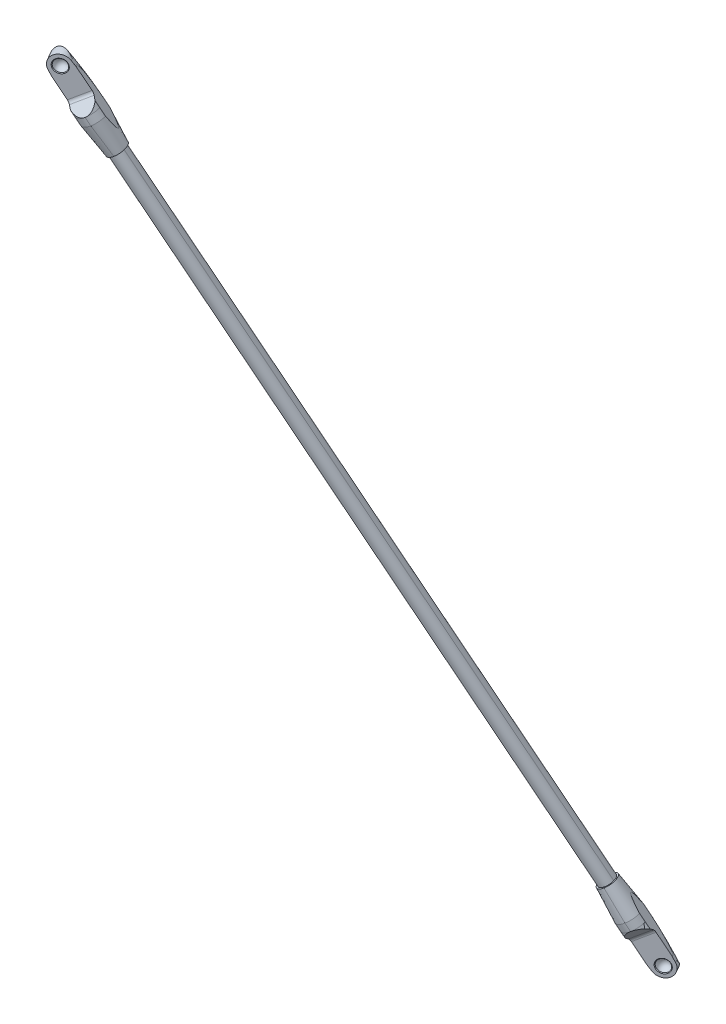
ISO-10303-21;
HEADER;
FILE_DESCRIPTION(('STEP AP214'),'2;1');
FILE_NAME('part.step','',(''),(''),'','','');
FILE_SCHEMA(('AUTOMOTIVE_DESIGN { 1 0 10303 214 1 1 1 1 }'));
ENDSEC;
DATA;
#1=APPLICATION_CONTEXT('core data for automotive mechanical design processes');
#2=APPLICATION_PROTOCOL_DEFINITION('international standard','automotive_design',2000,#1);
#3=PRODUCT_CONTEXT('',#1,'mechanical');
#4=PRODUCT('Part','Part','',(#3));
#5=PRODUCT_RELATED_PRODUCT_CATEGORY('part','',(#4));
#6=PRODUCT_DEFINITION_FORMATION('','',#4);
#7=PRODUCT_DEFINITION_CONTEXT('part definition',#1,'design');
#8=PRODUCT_DEFINITION('design','',#6,#7);
#9=PRODUCT_DEFINITION_SHAPE('','',#8);
#10=(LENGTH_UNIT() NAMED_UNIT(*) SI_UNIT(.MILLI.,.METRE.));
#11=(NAMED_UNIT(*) PLANE_ANGLE_UNIT() SI_UNIT($,.RADIAN.));
#12=(NAMED_UNIT(*) SI_UNIT($,.STERADIAN.) SOLID_ANGLE_UNIT());
#13=UNCERTAINTY_MEASURE_WITH_UNIT(LENGTH_MEASURE(1.E-05),#10,'distance_accuracy_value','');
#14=(GEOMETRIC_REPRESENTATION_CONTEXT(3) GLOBAL_UNCERTAINTY_ASSIGNED_CONTEXT((#13)) GLOBAL_UNIT_ASSIGNED_CONTEXT((#10,
#11,#12)) REPRESENTATION_CONTEXT('',''));
#15=CARTESIAN_POINT('',(0.,0.,0.));
#16=DIRECTION('',(0.,0.,1.));
#17=DIRECTION('',(1.,0.,0.));
#18=AXIS2_PLACEMENT_3D('',#15,#16,#17);
#19=CARTESIAN_POINT('',(-120.701955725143,-741.350031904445,7.91236206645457));
#20=DIRECTION('',(-0.462556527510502,0.845411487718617,0.267059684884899));
#21=DIRECTION('',(-0.500000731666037,2.07760446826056E-06,-0.866024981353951));
#22=AXIS2_PLACEMENT_3D('',#19,#20,#21);
#23=CYLINDRICAL_SURFACE('',#22,12.5);
#24=DIRECTION('',(-0.462556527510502,0.845411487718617,0.267059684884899));
#25=VECTOR('',#24,1.);
#26=CARTESIAN_POINT('',(-109.679737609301,-735.47477323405,8.40434109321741));
#27=LINE('',#26,#25);
#28=CARTESIAN_POINT('',(-95.3404852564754,-761.682529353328,0.125490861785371));
#29=VERTEX_POINT('',#28);
#30=CARTESIAN_POINT('',(-91.6400330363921,-768.445821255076,-2.0109866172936));
#31=VERTEX_POINT('',#30);
#32=EDGE_CURVE('E651',#29,#31,#27,.F.);
#33=ORIENTED_EDGE('',*,*,#32,.F.);
#34=CARTESIAN_POINT('',(-106.362703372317,-767.557788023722,-0.366488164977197));
#35=DIRECTION('',(-0.462556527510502,0.845411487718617,0.267059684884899));
#36=DIRECTION('',(-0.500000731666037,2.07760446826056E-06,-0.866024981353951));
#37=AXIS2_PLACEMENT_3D('',#34,#35,#36);
#38=CIRCLE('',#37,12.5);
#39=CARTESIAN_POINT('',(-100.112694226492,-767.557813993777,10.4588241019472));
#40=VERTEX_POINT('',#39);
#41=EDGE_CURVE('E648',#40,#29,#38,.T.);
#42=ORIENTED_EDGE('',*,*,#41,.F.);
#43=DIRECTION('',(-0.462556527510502,0.845411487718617,0.267059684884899));
#44=VECTOR('',#43,1.);
#45=CARTESIAN_POINT('',(-114.451946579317,-741.350057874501,18.737674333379));
#46=LINE('',#45,#44);
#47=CARTESIAN_POINT('',(-96.4122420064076,-774.321105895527,8.32234662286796));
#48=VERTEX_POINT('',#47);
#49=EDGE_CURVE('E449',#48,#40,#46,.T.);
#50=ORIENTED_EDGE('',*,*,#49,.F.);
#51=CARTESIAN_POINT('',(-102.662251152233,-774.321079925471,-2.50296564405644));
#52=DIRECTION('',(-0.462556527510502,0.845411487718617,0.267059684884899));
#53=DIRECTION('',(-0.500000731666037,2.07760446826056E-06,-0.866024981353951));
#54=AXIS2_PLACEMENT_3D('',#51,#52,#53);
#55=CIRCLE('',#54,12.5);
#56=EDGE_CURVE('E272',#48,#31,#55,.T.);
#57=ORIENTED_EDGE('',*,*,#56,.T.);
#58=EDGE_LOOP('',(#33,#42,#50,#57));
#59=FACE_BOUND('',#58,.T.);
#60=ADVANCED_FACE('F16',(#59),#23,.T.);
#61=CARTESIAN_POINT('',(-458.32350789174,-124.281367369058,202.840116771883));
#62=DIRECTION('',(0.462556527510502,-0.845411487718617,-0.267059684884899));
#63=DIRECTION('',(0.500000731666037,-2.07760446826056E-06,0.866024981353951));
#64=AXIS2_PLACEMENT_3D('',#61,#62,#63);
#65=DEGENERATE_TOROIDAL_SURFACE('',#64,422.5,435.,.F.);
#66=CARTESIAN_POINT('',(-452.817507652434,-119.173650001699,192.807877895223));
#67=CARTESIAN_POINT('',(-453.300513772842,-118.294990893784,193.081528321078));
#68=CARTESIAN_POINT('',(-453.779663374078,-117.416299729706,193.361898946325));
#69=CARTESIAN_POINT('',(-454.730013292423,-115.659026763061,193.936270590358));
#70=CARTESIAN_POINT('',(-455.201213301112,-114.780444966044,194.230272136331));
#71=CARTESIAN_POINT('',(-456.136042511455,-113.022405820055,194.832494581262));
#72=CARTESIAN_POINT('',(-456.599660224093,-112.142948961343,195.140734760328));
#73=CARTESIAN_POINT('',(-457.518167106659,-110.384640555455,195.771568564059));
#74=CARTESIAN_POINT('',(-457.973056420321,-109.505788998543,196.094161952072));
#75=CARTESIAN_POINT('',(-458.875507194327,-107.744884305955,196.756086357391));
#76=CARTESIAN_POINT('',(-459.32302481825,-106.862835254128,197.095488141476));
#77=CARTESIAN_POINT('',(-460.207484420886,-105.100027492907,197.790978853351));
#78=CARTESIAN_POINT('',(-460.644426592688,-104.219268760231,198.147067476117));
#79=CARTESIAN_POINT('',(-461.505946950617,-102.46002026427,198.877792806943));
#80=CARTESIAN_POINT('',(-461.930531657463,-101.581529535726,199.252419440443));
#81=CARTESIAN_POINT('',(-462.556371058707,-100.265864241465,199.830860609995));
#82=CARTESIAN_POINT('',(-462.763136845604,-99.8276710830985,200.026416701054));
#83=CARTESIAN_POINT('',(-463.172519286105,-98.952125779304,200.423652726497));
#84=CARTESIAN_POINT('',(-463.375136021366,-98.5147736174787,200.625332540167));
#85=CARTESIAN_POINT('',(-463.722548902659,-97.7568754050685,200.981248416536));
#86=CARTESIAN_POINT('',(-463.868440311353,-97.4360851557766,201.133895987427));
#87=CARTESIAN_POINT('',(-464.157328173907,-96.7951876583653,201.443342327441));
#88=CARTESIAN_POINT('',(-464.30032454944,-96.4750804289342,201.600141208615));
#89=CARTESIAN_POINT('',(-464.582954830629,-95.8358251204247,201.918350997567));
#90=CARTESIAN_POINT('',(-464.722589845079,-95.5166767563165,202.07976034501));
#91=CARTESIAN_POINT('',(-464.997987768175,-94.8794679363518,202.407911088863));
#92=CARTESIAN_POINT('',(-465.133750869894,-94.5614074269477,202.574652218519));
#93=CARTESIAN_POINT('',(-465.400829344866,-93.9262593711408,202.914608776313));
#94=CARTESIAN_POINT('',(-465.53213862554,-93.6091736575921,203.087832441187));
#95=CARTESIAN_POINT('',(-465.789065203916,-92.9768079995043,203.441856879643));
#96=CARTESIAN_POINT('',(-465.914681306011,-92.6615284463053,203.622659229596));
#97=CARTESIAN_POINT('',(-466.158699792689,-92.0332026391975,203.993936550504));
#98=CARTESIAN_POINT('',(-466.27709186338,-91.7201601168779,204.184424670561));
#99=CARTESIAN_POINT('',(-466.503784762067,-91.0982293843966,204.577630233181));
#100=CARTESIAN_POINT('',(-466.612091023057,-90.7893390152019,204.780340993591));
#101=CARTESIAN_POINT('',(-466.763436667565,-90.3305486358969,205.097913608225));
#102=CARTESIAN_POINT('',(-466.812131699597,-90.1780316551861,205.20628629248));
#103=CARTESIAN_POINT('',(-466.904600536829,-89.8753573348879,205.428573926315));
#104=CARTESIAN_POINT('',(-466.948371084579,-89.7252016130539,205.542492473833));
#105=CARTESIAN_POINT('',(-467.029174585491,-89.4287925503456,205.777068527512));
#106=CARTESIAN_POINT('',(-467.06621934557,-89.2825327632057,205.897713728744));
#107=CARTESIAN_POINT('',(-467.130813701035,-88.9958712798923,206.148048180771));
#108=CARTESIAN_POINT('',(-467.158377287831,-88.8554612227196,206.277723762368));
#109=CARTESIAN_POINT('',(-467.193410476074,-88.6201205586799,206.514412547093));
#110=CARTESIAN_POINT('',(-467.204239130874,-88.5228470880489,206.618568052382));
#111=CARTESIAN_POINT('',(-467.21359615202,-88.3381448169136,206.835744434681));
#112=CARTESIAN_POINT('',(-467.21217463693,-88.2506773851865,206.948727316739));
#113=CARTESIAN_POINT('',(-467.195467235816,-88.1351735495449,207.123611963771));
#114=CARTESIAN_POINT('',(-467.187801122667,-88.0999377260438,207.181412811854));
#115=CARTESIAN_POINT('',(-467.166669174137,-88.0355423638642,207.299382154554));
#116=CARTESIAN_POINT('',(-467.153206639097,-88.0063793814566,207.359549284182));
#117=CARTESIAN_POINT('',(-467.121731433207,-87.9602526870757,207.472350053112));
#118=CARTESIAN_POINT('',(-467.104699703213,-87.9421170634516,207.524765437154));
#119=CARTESIAN_POINT('',(-467.06494220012,-87.9136823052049,207.629556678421));
#120=CARTESIAN_POINT('',(-467.042225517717,-87.9033707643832,207.681932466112));
#121=CARTESIAN_POINT('',(-466.99097812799,-87.8917987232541,207.785317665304));
#122=CARTESIAN_POINT('',(-466.962408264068,-87.89060136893,207.836315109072));
#123=CARTESIAN_POINT('',(-466.900522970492,-87.8975987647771,207.934662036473));
#124=CARTESIAN_POINT('',(-466.867204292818,-87.9057999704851,207.982008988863));
#125=CARTESIAN_POINT('',(-466.792934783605,-87.9320651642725,208.07745992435));
#126=CARTESIAN_POINT('',(-466.751551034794,-87.9512392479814,208.124911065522));
#127=CARTESIAN_POINT('',(-466.666562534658,-87.9977312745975,208.213369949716));
#128=CARTESIAN_POINT('',(-466.622953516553,-88.0250653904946,208.254364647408));
#129=CARTESIAN_POINT('',(-466.505452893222,-88.1057858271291,208.355886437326));
#130=CARTESIAN_POINT('',(-466.430745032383,-88.1643953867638,208.411227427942));
#131=CARTESIAN_POINT('',(-466.281460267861,-88.2910688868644,208.509736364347));
#132=CARTESIAN_POINT('',(-466.206884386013,-88.3591599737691,208.552868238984));
#133=CARTESIAN_POINT('',(-466.022379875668,-88.5358847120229,208.649136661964));
#134=CARTESIAN_POINT('',(-465.913035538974,-88.6480345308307,208.696818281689));
#135=CARTESIAN_POINT('',(-465.696758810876,-88.8793770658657,208.779104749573));
#136=CARTESIAN_POINT('',(-465.589832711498,-88.998585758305,208.813678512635));
#137=CARTESIAN_POINT('',(-465.377635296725,-89.242028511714,208.873609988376));
#138=CARTESIAN_POINT('',(-465.272378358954,-89.3662891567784,208.898909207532));
#139=CARTESIAN_POINT('',(-465.064025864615,-89.6175274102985,208.94233096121));
#140=CARTESIAN_POINT('',(-464.960927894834,-89.7445016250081,208.960461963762));
#141=CARTESIAN_POINT('',(-464.63729742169,-90.1495838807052,209.009159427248));
#142=CARTESIAN_POINT('',(-464.41990639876,-90.4314001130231,209.0295991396));
#143=CARTESIAN_POINT('',(-463.990956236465,-91.0002132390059,209.05383133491));
#144=CARTESIAN_POINT('',(-463.779401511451,-91.2872137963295,209.057611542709));
#145=CARTESIAN_POINT('',(-463.360397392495,-91.865179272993,209.053052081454));
#146=CARTESIAN_POINT('',(-463.152959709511,-92.1561523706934,209.044681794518));
#147=CARTESIAN_POINT('',(-462.741923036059,-92.7402118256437,209.018622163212));
#148=CARTESIAN_POINT('',(-462.538322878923,-93.0332975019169,209.000935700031));
#149=CARTESIAN_POINT('',(-462.13372269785,-93.6218769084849,208.958016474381));
#150=CARTESIAN_POINT('',(-461.93273127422,-93.9173750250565,208.932763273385));
#151=CARTESIAN_POINT('',(-461.53344963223,-94.5096148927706,208.876006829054));
#152=CARTESIAN_POINT('',(-461.335159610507,-94.8063567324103,208.844503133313));
#153=CARTESIAN_POINT('',(-460.941256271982,-95.4003444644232,208.776222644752));
#154=CARTESIAN_POINT('',(-460.745639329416,-95.6975888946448,208.739453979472));
#155=CARTESIAN_POINT('',(-460.356519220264,-96.2928388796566,208.661293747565));
#156=CARTESIAN_POINT('',(-460.163016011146,-96.5908444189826,208.619902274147));
#157=CARTESIAN_POINT('',(-459.667879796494,-97.3579504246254,208.508216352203));
#158=CARTESIAN_POINT('',(-459.367640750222,-97.8275149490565,208.434921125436));
#159=CARTESIAN_POINT('',(-458.771246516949,-98.7678273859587,208.279761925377));
#160=CARTESIAN_POINT('',(-458.475091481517,-99.2385753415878,208.197897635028));
#161=CARTESIAN_POINT('',(-457.591999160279,-100.652308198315,207.941117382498));
#162=CARTESIAN_POINT('',(-457.010504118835,-101.596673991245,207.755030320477));
#163=CARTESIAN_POINT('',(-455.858887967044,-103.489084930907,207.358506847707));
#164=CARTESIAN_POINT('',(-455.288784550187,-104.437133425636,207.148035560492));
#165=CARTESIAN_POINT('',(-454.15946659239,-106.334762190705,206.706297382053));
#166=CARTESIAN_POINT('',(-453.600251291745,-107.284342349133,206.475031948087));
#167=CARTESIAN_POINT('',(-452.51426169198,-109.146087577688,206.003587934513));
#168=CARTESIAN_POINT('',(-451.987091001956,-110.058209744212,205.7641501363));
#169=CARTESIAN_POINT('',(-450.941471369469,-111.883142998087,205.269297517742));
#170=CARTESIAN_POINT('',(-450.423022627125,-112.795954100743,205.013882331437));
#171=CARTESIAN_POINT('',(-449.395978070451,-114.619531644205,204.488569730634));
#172=CARTESIAN_POINT('',(-448.887359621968,-115.530297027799,204.218712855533));
#173=CARTESIAN_POINT('',(-447.878542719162,-117.351944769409,203.664267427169));
#174=CARTESIAN_POINT('',(-447.378343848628,-118.262827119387,203.379679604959));
#175=CARTESIAN_POINT('',(-446.882323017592,-119.173674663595,203.087899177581));
#176=B_SPLINE_CURVE_WITH_KNOTS('',3,(#66,#67,#68,#69,#70,#71,#72,#73,#74,#75,#76,#77,#78,#79,
#80,#81,#82,#83,#84,#85,#86,#87,#88,#89,#90,#91,#92,#93,#94,#95,#96,#97,#98,#99,#100,#101,#102,
#103,#104,#105,#106,#107,#108,#109,#110,#111,#112,#113,#114,#115,#116,#117,#118,#119,#120,#121,
#122,#123,#124,#125,#126,#127,#128,#129,#130,#131,#132,#133,#134,#135,#136,#137,#138,#139,#140,
#141,#142,#143,#144,#145,#146,#147,#148,#149,#150,#151,#152,#153,#154,#155,#156,#157,#158,#159,
#160,#161,#162,#163,#164,#165,#166,#167,#168,#169,#170,#171,#172,#173,#174,#175),.UNSPECIFIED.,
.F.,.F.,(4,2,2,2,2,2,2,2,2,2,2,2,2,2,2,2,2,2,2,2,2,2,2,2,2,2,2,2,2,2,2,2,2,2,2,2,2,2,2,2,2,2,2,
2,2,2,2,2,2,2,2,2,2,2,4),(0.,3.11798800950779,6.23609671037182,9.35855895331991,
12.4809697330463,15.6178797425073,18.7547324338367,21.8898987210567,23.4573613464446,
25.0247930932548,26.1769049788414,27.3290479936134,28.4808055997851,29.6325056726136,
30.7857224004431,31.9391802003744,33.0942480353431,34.2486900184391,34.8285759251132,
35.4088431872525,35.9880817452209,36.5664618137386,36.9946719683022,37.4211310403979,
37.6251109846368,37.82897494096,38.0023658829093,38.175481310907,38.349795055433,
38.5242286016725,38.7205868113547,38.9173368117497,39.2451852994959,39.5739925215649,
40.0639280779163,40.5550183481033,41.0491546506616,41.5427054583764,42.6113457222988,
43.6807732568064,44.7529003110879,45.8246959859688,46.8994131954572,47.9742082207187,
49.0473616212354,50.1204933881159,51.8068214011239,53.4932118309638,56.8663810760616,
60.2444359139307,63.6222542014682,66.8632139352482,70.1042479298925,73.3366179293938,
76.5688276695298),.UNSPECIFIED.);
#177=CARTESIAN_POINT('',(-453.23846950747,-118.406084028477,193.048618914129));
#178=VERTEX_POINT('',#177);
#179=CARTESIAN_POINT('',(-465.639673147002,-88.9440581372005,208.796251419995));
#180=VERTEX_POINT('',#179);
#181=EDGE_CURVE('E1540',#178,#180,#176,.T.);
#182=ORIENTED_EDGE('',*,*,#181,.F.);
#183=CARTESIAN_POINT('',(-458.32350789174,-124.281367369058,202.840116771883));
#184=DIRECTION('',(0.462556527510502,-0.845411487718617,-0.267059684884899));
#185=DIRECTION('',(-0.500000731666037,2.07760446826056E-06,-0.866024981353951));
#186=AXIS2_PLACEMENT_3D('',#183,#184,#185);
#187=CIRCLE('',#186,12.5);
#188=CARTESIAN_POINT('',(-464.573517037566,-124.281341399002,192.014804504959));
#189=VERTEX_POINT('',#188);
#190=EDGE_CURVE('E956',#189,#178,#187,.T.);
#191=ORIENTED_EDGE('',*,*,#190,.F.);
#192=CARTESIAN_POINT('',(-247.073198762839,-124.282245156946,568.735671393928));
#193=DIRECTION('',(-0.732148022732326,-0.534115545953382,0.422705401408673));
#194=DIRECTION('',(0.500000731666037,-2.07760446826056E-06,0.866024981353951));
#195=AXIS2_PLACEMENT_3D('',#192,#193,#194);
#196=CIRCLE('',#195,435.);
#197=CARTESIAN_POINT('',(-486.663897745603,-81.1653617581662,208.232923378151));
#198=VERTEX_POINT('',#197);
#199=EDGE_CURVE('E431',#198,#189,#196,.T.);
#200=ORIENTED_EDGE('',*,*,#199,.F.);
#201=CARTESIAN_POINT('',(-470.679340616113,-83.5922263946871,208.242287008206));
#202=CARTESIAN_POINT('',(-470.693772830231,-83.5707572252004,208.250621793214));
#203=CARTESIAN_POINT('',(-470.708656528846,-83.5493567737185,208.258338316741));
#204=CARTESIAN_POINT('',(-470.739493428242,-83.5064076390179,208.272690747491));
#205=CARTESIAN_POINT('',(-470.755459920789,-83.4848620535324,208.279307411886));
#206=CARTESIAN_POINT('',(-470.78846569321,-83.4416300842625,208.291463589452));
#207=CARTESIAN_POINT('',(-470.805519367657,-83.4199484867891,208.29698087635));
#208=CARTESIAN_POINT('',(-470.840703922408,-83.3764482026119,208.306944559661));
#209=CARTESIAN_POINT('',(-470.858849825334,-83.3546360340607,208.31136631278));
#210=CARTESIAN_POINT('',(-470.889083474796,-83.3192387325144,208.317658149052));
#211=CARTESIAN_POINT('',(-470.900975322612,-83.3055455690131,208.319871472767));
#212=CARTESIAN_POINT('',(-470.925184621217,-83.278110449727,208.323878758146));
#213=CARTESIAN_POINT('',(-470.937505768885,-83.2643707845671,208.325666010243));
#214=CARTESIAN_POINT('',(-470.975406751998,-83.2227531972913,208.330439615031));
#215=CARTESIAN_POINT('',(-471.001363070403,-83.1951326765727,208.332722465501));
#216=CARTESIAN_POINT('',(-471.041163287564,-83.1539921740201,208.334884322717));
#217=CARTESIAN_POINT('',(-471.054701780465,-83.1402027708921,208.335393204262));
#218=CARTESIAN_POINT('',(-471.082350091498,-83.1124334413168,208.336006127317));
#219=CARTESIAN_POINT('',(-471.096465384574,-83.0984586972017,208.33609865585));
#220=CARTESIAN_POINT('',(-471.135220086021,-83.060602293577,208.335808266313));
#221=CARTESIAN_POINT('',(-471.160043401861,-83.0369114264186,208.335030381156));
#222=CARTESIAN_POINT('',(-471.211289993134,-82.989020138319,208.332384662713));
#223=CARTESIAN_POINT('',(-471.2377347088,-82.9648454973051,208.33046889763));
#224=CARTESIAN_POINT('',(-471.292241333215,-82.9160029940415,208.325556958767));
#225=CARTESIAN_POINT('',(-471.320322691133,-82.891361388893,208.322516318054));
#226=CARTESIAN_POINT('',(-471.378121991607,-82.841610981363,208.315344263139));
#227=CARTESIAN_POINT('',(-471.407857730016,-82.8165290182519,208.31117089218));
#228=CARTESIAN_POINT('',(-471.468360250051,-82.7664023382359,208.301895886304));
#229=CARTESIAN_POINT('',(-471.499135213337,-82.7413710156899,208.296775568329));
#230=CARTESIAN_POINT('',(-471.562254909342,-82.6908731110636,208.285615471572));
#231=CARTESIAN_POINT('',(-471.594612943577,-82.6654296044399,208.279546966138));
#232=CARTESIAN_POINT('',(-471.707973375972,-82.5777259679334,208.257221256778));
#233=CARTESIAN_POINT('',(-471.789791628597,-82.5169542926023,208.23922686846));
#234=CARTESIAN_POINT('',(-471.96994287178,-82.3877685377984,208.196614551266));
#235=CARTESIAN_POINT('',(-472.068571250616,-82.319976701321,208.171387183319));
#236=CARTESIAN_POINT('',(-472.219459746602,-82.2195820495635,208.131797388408));
#237=CARTESIAN_POINT('',(-472.271112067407,-82.1857947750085,208.118071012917));
#238=CARTESIAN_POINT('',(-472.361062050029,-82.1279229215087,208.093902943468));
#239=CARTESIAN_POINT('',(-472.399261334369,-82.1036457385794,208.083557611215));
#240=CARTESIAN_POINT('',(-472.523515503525,-82.0256036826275,208.049698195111));
#241=CARTESIAN_POINT('',(-472.610014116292,-81.9727088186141,208.025804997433));
#242=CARTESIAN_POINT('',(-472.796646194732,-81.8613086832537,207.974142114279));
#243=CARTESIAN_POINT('',(-472.896939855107,-81.803100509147,207.946312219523));
#244=CARTESIAN_POINT('',(-473.081962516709,-81.6985325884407,207.895186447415));
#245=CARTESIAN_POINT('',(-473.166495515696,-81.6518167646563,207.871909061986));
#246=CARTESIAN_POINT('',(-473.263131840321,-81.5995927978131,207.845388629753));
#247=CARTESIAN_POINT('',(-473.274820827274,-81.5932953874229,207.842182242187));
#248=CARTESIAN_POINT('',(-473.354128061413,-81.5507010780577,207.820436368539));
#249=CARTESIAN_POINT('',(-473.422004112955,-81.5148974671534,207.80186807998));
#250=CARTESIAN_POINT('',(-473.591867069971,-81.4267641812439,207.755893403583));
#251=CARTESIAN_POINT('',(-473.694181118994,-81.3749847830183,207.728640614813));
#252=CARTESIAN_POINT('',(-473.933914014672,-81.2566848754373,207.665780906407));
#253=CARTESIAN_POINT('',(-474.071772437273,-81.1909403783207,207.630385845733));
#254=CARTESIAN_POINT('',(-474.323010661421,-81.075154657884,207.567443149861));
#255=CARTESIAN_POINT('',(-474.436057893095,-81.0245054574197,207.539683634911));
#256=CARTESIAN_POINT('',(-474.652194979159,-80.9303627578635,207.487874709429));
#257=CARTESIAN_POINT('',(-474.755168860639,-80.8866558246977,207.463729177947));
#258=CARTESIAN_POINT('',(-474.972061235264,-80.7969970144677,207.414017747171));
#259=CARTESIAN_POINT('',(-475.086078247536,-80.7512346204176,207.388539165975));
#260=CARTESIAN_POINT('',(-475.283320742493,-80.6743970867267,207.345748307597));
#261=CARTESIAN_POINT('',(-475.366272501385,-80.6427828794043,207.328138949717));
#262=CARTESIAN_POINT('',(-475.555705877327,-80.5721897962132,207.288811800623));
#263=CARTESIAN_POINT('',(-475.662369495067,-80.5335834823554,207.267299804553));
#264=CARTESIAN_POINT('',(-475.871082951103,-80.4602725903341,207.226502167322));
#265=CARTESIAN_POINT('',(-475.97308689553,-80.4254694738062,207.207158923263));
#266=CARTESIAN_POINT('',(-476.124601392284,-80.3752965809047,207.17936727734));
#267=CARTESIAN_POINT('',(-476.17380608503,-80.359238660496,207.170487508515));
#268=CARTESIAN_POINT('',(-476.280638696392,-80.3248863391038,207.151533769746));
#269=CARTESIAN_POINT('',(-476.338299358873,-80.306666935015,207.141508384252));
#270=CARTESIAN_POINT('',(-476.509553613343,-80.2535152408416,207.112339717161));
#271=CARTESIAN_POINT('',(-476.623492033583,-80.2193998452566,207.093721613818));
#272=CARTESIAN_POINT('',(-476.849451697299,-80.1542420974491,207.058392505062));
#273=CARTESIAN_POINT('',(-476.961451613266,-80.1231449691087,207.041645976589));
#274=CARTESIAN_POINT('',(-477.18343800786,-80.0639135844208,207.01000398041));
#275=CARTESIAN_POINT('',(-477.293404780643,-80.0357246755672,206.995072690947));
#276=CARTESIAN_POINT('',(-477.511233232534,-79.9821982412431,206.967010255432));
#277=CARTESIAN_POINT('',(-477.619076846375,-79.9568062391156,206.953842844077));
#278=CARTESIAN_POINT('',(-477.832574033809,-79.9087609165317,206.929259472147));
#279=CARTESIAN_POINT('',(-477.9382111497,-79.8860533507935,206.917806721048));
#280=CARTESIAN_POINT('',(-478.147215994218,-79.8432628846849,206.896611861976));
#281=CARTESIAN_POINT('',(-478.250568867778,-79.8231260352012,206.886832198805));
#282=CARTESIAN_POINT('',(-478.471036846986,-79.7823884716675,206.867520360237));
#283=CARTESIAN_POINT('',(-478.588219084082,-79.7620587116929,206.858180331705));
#284=CARTESIAN_POINT('',(-478.820964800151,-79.7243648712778,206.841492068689));
#285=CARTESIAN_POINT('',(-478.936518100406,-79.7069528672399,206.834110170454));
#286=CARTESIAN_POINT('',(-479.165926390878,-79.6750264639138,206.821296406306));
#287=CARTESIAN_POINT('',(-479.279772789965,-79.6604640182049,206.815830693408));
#288=CARTESIAN_POINT('',(-479.505690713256,-79.6341672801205,206.806805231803));
#289=CARTESIAN_POINT('',(-479.617755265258,-79.6223848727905,206.803211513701));
#290=CARTESIAN_POINT('',(-479.840036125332,-79.6015767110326,206.797889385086));
#291=CARTESIAN_POINT('',(-479.95024710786,-79.5925028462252,206.796126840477));
#292=CARTESIAN_POINT('',(-480.16875384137,-79.5770385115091,206.794427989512));
#293=CARTESIAN_POINT('',(-480.277045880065,-79.5706000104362,206.794457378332));
#294=CARTESIAN_POINT('',(-480.438774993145,-79.5628616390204,206.795850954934));
#295=CARTESIAN_POINT('',(-480.492174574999,-79.5606118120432,206.796530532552));
#296=CARTESIAN_POINT('',(-480.60524371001,-79.5565027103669,206.798442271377));
#297=CARTESIAN_POINT('',(-480.664915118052,-79.5547200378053,206.799729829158));
#298=CARTESIAN_POINT('',(-480.842480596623,-79.5505809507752,206.804400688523));
#299=CARTESIAN_POINT('',(-480.960383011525,-79.5493614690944,206.808603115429));
#300=CARTESIAN_POINT('',(-481.194172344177,-79.5500683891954,206.819185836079));
#301=CARTESIAN_POINT('',(-481.310061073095,-79.551944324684,206.825529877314));
#302=CARTESIAN_POINT('',(-481.539745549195,-79.5587808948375,206.840350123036));
#303=CARTESIAN_POINT('',(-481.653545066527,-79.5636915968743,206.848790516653));
#304=CARTESIAN_POINT('',(-481.878973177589,-79.5765342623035,206.867759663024));
#305=CARTESIAN_POINT('',(-481.990607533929,-79.5844169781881,206.878253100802));
#306=CARTESIAN_POINT('',(-482.211631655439,-79.6031380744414,206.901286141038));
#307=CARTESIAN_POINT('',(-482.321029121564,-79.6139280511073,206.913790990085));
#308=CARTESIAN_POINT('',(-482.53750782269,-79.6383959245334,206.940806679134));
#309=CARTESIAN_POINT('',(-482.644598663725,-79.6520264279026,206.955283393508));
#310=CARTESIAN_POINT('',(-482.866674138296,-79.6835655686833,206.987703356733));
#311=CARTESIAN_POINT('',(-482.981595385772,-79.7017313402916,207.00583243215));
#312=CARTESIAN_POINT('',(-483.208892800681,-79.7414454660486,207.044455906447));
#313=CARTESIAN_POINT('',(-483.321282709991,-79.7629474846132,207.064917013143));
#314=CARTESIAN_POINT('',(-483.543430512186,-79.8092731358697,207.108153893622));
#315=CARTESIAN_POINT('',(-483.653203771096,-79.8340525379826,207.130898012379));
#316=CARTESIAN_POINT('',(-483.870033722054,-79.8868691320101,207.178651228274));
#317=CARTESIAN_POINT('',(-483.97710718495,-79.9148644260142,207.203630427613));
#318=CARTESIAN_POINT('',(-484.18845470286,-79.9740456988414,207.255805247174));
#319=CARTESIAN_POINT('',(-484.292746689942,-80.0051923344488,207.282972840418));
#320=CARTESIAN_POINT('',(-484.498456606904,-80.0706086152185,207.339478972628));
#321=CARTESIAN_POINT('',(-484.599893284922,-80.1048416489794,207.368791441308));
#322=CARTESIAN_POINT('',(-484.750196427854,-80.1586082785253,207.414463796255));
#323=CARTESIAN_POINT('',(-484.799804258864,-80.1768596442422,207.429910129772));
#324=CARTESIAN_POINT('',(-484.900773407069,-80.2150562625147,207.462122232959));
#325=CARTESIAN_POINT('',(-484.952110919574,-80.2350408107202,207.47891603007));
#326=CARTESIAN_POINT('',(-485.104726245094,-80.2961600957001,207.530099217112));
#327=CARTESIAN_POINT('',(-485.205143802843,-80.3386519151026,207.565453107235));
#328=CARTESIAN_POINT('',(-485.402830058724,-80.4269673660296,207.638480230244));
#329=CARTESIAN_POINT('',(-485.500114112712,-80.472769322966,207.676138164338));
#330=CARTESIAN_POINT('',(-485.691450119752,-80.5676427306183,207.753720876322));
#331=CARTESIAN_POINT('',(-485.785516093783,-80.6166962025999,207.793633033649));
#332=CARTESIAN_POINT('',(-485.970329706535,-80.7180047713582,207.875670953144));
#333=CARTESIAN_POINT('',(-486.061089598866,-80.7702455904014,207.917786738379));
#334=CARTESIAN_POINT('',(-486.239208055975,-80.8778598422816,208.004181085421));
#335=CARTESIAN_POINT('',(-486.326576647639,-80.9332226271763,208.048452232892));
#336=CARTESIAN_POINT('',(-486.497835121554,-81.0470041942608,208.139105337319));
#337=CARTESIAN_POINT('',(-486.58173235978,-81.1054158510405,208.185482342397));
#338=CARTESIAN_POINT('',(-486.663897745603,-81.1653617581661,208.232923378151));
#339=B_SPLINE_CURVE_WITH_KNOTS('',3,(#201,#202,#203,#204,#205,#206,#207,#208,#209,#210,#211,
#212,#213,#214,#215,#216,#217,#218,#219,#220,#221,#222,#223,#224,#225,#226,#227,#228,#229,#230,
#231,#232,#233,#234,#235,#236,#237,#238,#239,#240,#241,#242,#243,#244,#245,#246,#247,#248,#249,
#250,#251,#252,#253,#254,#255,#256,#257,#258,#259,#260,#261,#262,#263,#264,#265,#266,#267,#268,
#269,#270,#271,#272,#273,#274,#275,#276,#277,#278,#279,#280,#281,#282,#283,#284,#285,#286,#287,
#288,#289,#290,#291,#292,#293,#294,#295,#296,#297,#298,#299,#300,#301,#302,#303,#304,#305,#306,
#307,#308,#309,#310,#311,#312,#313,#314,#315,#316,#317,#318,#319,#320,#321,#322,#323,#324,#325,
#326,#327,#328,#329,#330,#331,#332,#333,#334,#335,#336,#337,#338),.UNSPECIFIED.,.F.,.F.,(4,2,2,
2,2,2,2,2,2,2,2,2,2,2,2,2,2,2,2,2,2,2,2,2,2,2,2,2,2,2,2,2,2,2,2,2,2,2,2,2,2,2,2,2,2,2,2,2,2,2,2,
2,2,2,2,2,2,2,2,2,2,2,2,2,2,2,2,2,4),(0.,0.0815194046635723,0.164341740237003,0.248698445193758,
0.334808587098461,0.38961311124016,0.44523079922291,0.559074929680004,0.617063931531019,
0.676646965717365,0.779587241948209,0.8872062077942,0.999635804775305,1.11699174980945,
1.23697393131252,1.36178861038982,1.67212198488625,2.03893945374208,2.22862346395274,
2.36790523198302,2.68037635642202,3.03810731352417,3.33613291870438,3.37711019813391,
3.61396578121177,3.96753556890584,4.43781617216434,4.81862869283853,5.1619323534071,
5.53831542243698,5.80980971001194,6.15615469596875,6.48463008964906,6.64217237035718,
6.82605691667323,7.18717517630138,7.53945522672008,7.882924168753,8.21761124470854,
8.5435480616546,8.86076884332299,9.21862136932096,9.56985097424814,9.91452039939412,
10.2526960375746,10.584448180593,10.9098512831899,11.0702004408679,11.2493296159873,
11.603213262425,11.9513841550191,12.293973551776,12.6311192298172,12.9629657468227,
13.2896646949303,13.6428317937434,13.9914726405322,14.3358141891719,14.6760919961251,
15.0125501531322,15.3454411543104,15.5106390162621,15.6834061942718,16.0271636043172,
16.3688446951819,16.7087728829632,17.047276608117,17.3846884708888,17.7213443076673),.UNSPECIFIED.);
#340=CARTESIAN_POINT('',(-470.679340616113,-83.5922263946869,208.242287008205));
#341=VERTEX_POINT('',#340);
#342=EDGE_CURVE('E323',#341,#198,#339,.T.);
#343=ORIENTED_EDGE('',*,*,#342,.F.);
#344=CARTESIAN_POINT('',(-477.545988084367,-89.1485682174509,213.938326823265));
#345=DIRECTION('',(-0.462556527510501,0.845411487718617,0.267059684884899));
#346=DIRECTION('',(0.732148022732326,0.53411554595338,-0.422705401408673));
#347=AXIS2_PLACEMENT_3D('',#344,#345,#346);
#348=CIRCLE('',#347,10.5104068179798);
#349=CARTESIAN_POINT('',(-469.179742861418,-83.5922326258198,210.839661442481));
#350=VERTEX_POINT('',#349);
#351=EDGE_CURVE('E733',#350,#341,#348,.T.);
#352=ORIENTED_EDGE('',*,*,#351,.F.);
#353=CARTESIAN_POINT('',(-469.198312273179,-83.5644080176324,210.850849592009));
#354=CARTESIAN_POINT('',(-469.192163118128,-83.5736905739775,210.846987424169));
#355=CARTESIAN_POINT('',(-469.185973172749,-83.5829654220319,210.84325853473));
#356=CARTESIAN_POINT('',(-469.179742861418,-83.5922326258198,210.839661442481));
#357=(BOUNDED_CURVE() B_SPLINE_CURVE(3,(#353,#354,#355,#356),.UNSPECIFIED.,.F.,
.F.) B_SPLINE_CURVE_WITH_KNOTS((4,4),(7.68404953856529E-06,4.22971954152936E-05),
.UNSPECIFIED.) CURVE() GEOMETRIC_REPRESENTATION_ITEM() RATIONAL_B_SPLINE_CURVE((1.,1.,1.,1.)) REPRESENTATION_ITEM(''));
#358=CARTESIAN_POINT('',(-469.198312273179,-83.5644080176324,210.850849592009));
#359=VERTEX_POINT('',#358);
#360=EDGE_CURVE('E306',#359,#350,#357,.T.);
#361=ORIENTED_EDGE('',*,*,#360,.F.);
#362=CARTESIAN_POINT('',(-454.67877374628,-106.708430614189,202.467918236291));
#363=CARTESIAN_POINT('',(-456.986265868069,-102.760986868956,203.800161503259));
#364=CARTESIAN_POINT('',(-459.350135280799,-98.8579443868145,205.164954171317));
#365=CARTESIAN_POINT('',(-464.19107458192,-91.141013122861,207.959895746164));
#366=CARTESIAN_POINT('',(-466.66791910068,-87.3275680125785,209.389914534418));
#367=CARTESIAN_POINT('',(-469.198312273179,-83.5644080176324,210.850849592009));
#368=(BOUNDED_CURVE() B_SPLINE_CURVE(3,(#362,#363,#364,#365,#366,#367),.UNSPECIFIED.,.F.,
.F.) B_SPLINE_CURVE_WITH_KNOTS((4,2,4),(0.313716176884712,0.328296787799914,0.342877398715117),
.UNSPECIFIED.) CURVE() GEOMETRIC_REPRESENTATION_ITEM() RATIONAL_B_SPLINE_CURVE((1.,1.,1.,1.,1.,1.)) REPRESENTATION_ITEM(''));
#369=EDGE_CURVE('E302',#180,#359,#368,.T.);
#370=ORIENTED_EDGE('',*,*,#369,.F.);
#371=EDGE_LOOP('',(#182,#191,#200,#343,#352,#361,#370));
#372=FACE_BOUND('',#371,.T.);
#373=ADVANCED_FACE('F712',(#372),#65,.F.);
#374=CARTESIAN_POINT('',(-440.28380331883,-157.252415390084,192.424789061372));
#375=DIRECTION('',(0.462556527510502,-0.845411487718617,-0.267059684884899));
#376=DIRECTION('',(-0.500000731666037,2.07760446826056E-06,-0.866024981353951));
#377=AXIS2_PLACEMENT_3D('',#374,#375,#376);
#378=CYLINDRICAL_SURFACE('',#377,12.5);
#379=DIRECTION('',(0.462556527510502,-0.845411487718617,-0.267059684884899));
#380=VECTOR('',#379,1.);
#381=CARTESIAN_POINT('',(-435.19876493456,-151.377132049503,182.633291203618));
#382=LINE('',#381,#380);
#383=CARTESIAN_POINT('',(-449.538017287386,-125.169375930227,190.91214143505));
#384=VERTEX_POINT('',#383);
#385=EDGE_CURVE('E1543',#384,#178,#382,.F.);
#386=ORIENTED_EDGE('',*,*,#385,.F.);
#387=CARTESIAN_POINT('',(-454.623055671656,-131.044659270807,200.703639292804));
#388=DIRECTION('',(0.462556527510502,-0.845411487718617,-0.267059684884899));
#389=DIRECTION('',(-0.500000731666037,2.07760446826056E-06,-0.866024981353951));
#390=AXIS2_PLACEMENT_3D('',#387,#388,#389);
#391=CIRCLE('',#390,12.5);
#392=CARTESIAN_POINT('',(-460.873064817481,-131.044633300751,189.87832702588));
#393=VERTEX_POINT('',#392);
#394=EDGE_CURVE('E899',#393,#384,#391,.T.);
#395=ORIENTED_EDGE('',*,*,#394,.F.);
#396=DIRECTION('',(0.462556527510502,-0.845411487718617,-0.267059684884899));
#397=VECTOR('',#396,1.);
#398=CARTESIAN_POINT('',(-446.533812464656,-157.252389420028,181.599476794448));
#399=LINE('',#398,#397);
#400=EDGE_CURVE('E818',#189,#393,#399,.T.);
#401=ORIENTED_EDGE('',*,*,#400,.F.);
#402=ORIENTED_EDGE('',*,*,#190,.T.);
#403=EDGE_LOOP('',(#386,#395,#401,#402));
#404=FACE_BOUND('',#403,.T.);
#405=ADVANCED_FACE('F867',(#404),#378,.T.);
#406=CARTESIAN_POINT('',(-102.662251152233,-774.321079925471,-2.50296564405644));
#407=DIRECTION('',(-0.462556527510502,0.845411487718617,0.267059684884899));
#408=DIRECTION('',(0.500000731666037,-2.07760446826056E-06,0.866024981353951));
#409=AXIS2_PLACEMENT_3D('',#406,#407,#408);
#410=DEGENERATE_TOROIDAL_SURFACE('',#409,422.5,435.,.F.);
#411=CARTESIAN_POINT('',(-92.7943153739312,-766.349754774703,-1.3617492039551));
#412=CARTESIAN_POINT('',(-92.3238831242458,-767.1985685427,-1.6194667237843));
#413=CARTESIAN_POINT('',(-91.8570475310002,-768.047457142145,-1.88350839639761));
#414=CARTESIAN_POINT('',(-90.9307138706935,-769.745223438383,-2.42428694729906));
#415=CARTESIAN_POINT('',(-90.4712159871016,-770.594101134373,-2.70102414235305));
#416=CARTESIAN_POINT('',(-89.5582409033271,-772.294407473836,-3.26814996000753));
#417=CARTESIAN_POINT('',(-89.1047881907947,-773.145835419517,-3.5585801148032));
#418=CARTESIAN_POINT('',(-88.205772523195,-774.84826677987,-4.15256947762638));
#419=CARTESIAN_POINT('',(-87.7602094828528,-775.699270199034,-4.45612854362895));
#420=CARTESIAN_POINT('',(-86.8491160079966,-777.455262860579,-5.09687666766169));
#421=CARTESIAN_POINT('',(-86.3841407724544,-778.360209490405,-5.43497351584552));
#422=CARTESIAN_POINT('',(-85.4645712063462,-780.169016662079,-6.12777514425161));
#423=CARTESIAN_POINT('',(-85.0099767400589,-781.07287721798,-6.48247970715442));
#424=CARTESIAN_POINT('',(-84.1136383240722,-782.87677344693,-7.2093136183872));
#425=CARTESIAN_POINT('',(-83.671864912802,-783.77681302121,-7.58139686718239));
#426=CARTESIAN_POINT('',(-82.8020421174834,-785.574584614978,-8.34641835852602));
#427=CARTESIAN_POINT('',(-82.3739912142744,-786.472316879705,-8.7393542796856));
#428=CARTESIAN_POINT('',(-81.7488713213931,-787.807554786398,-9.34377293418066));
#429=CARTESIAN_POINT('',(-81.5452931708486,-788.246374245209,-9.54564155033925));
#430=CARTESIAN_POINT('',(-81.1428559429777,-789.123026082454,-9.95630522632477));
#431=CARTESIAN_POINT('',(-80.9439974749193,-789.560858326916,-10.1651011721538));
#432=CARTESIAN_POINT('',(-80.5508198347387,-790.437482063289,-10.5917674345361));
#433=CARTESIAN_POINT('',(-80.356530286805,-790.876266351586,-10.8096799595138));
#434=CARTESIAN_POINT('',(-79.9748817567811,-791.751808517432,-11.2549486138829));
#435=CARTESIAN_POINT('',(-79.7875198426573,-792.188567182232,-11.4823006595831));
#436=CARTESIAN_POINT('',(-79.4234344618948,-793.054861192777,-11.9463039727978));
#437=CARTESIAN_POINT('',(-79.2466194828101,-793.484424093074,-12.1828315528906));
#438=CARTESIAN_POINT('',(-78.90406518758,-794.340446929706,-12.6711495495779));
#439=CARTESIAN_POINT('',(-78.7383441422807,-794.76690076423,-12.9229639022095));
#440=CARTESIAN_POINT('',(-78.5031343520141,-795.399767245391,-13.3152357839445));
#441=CARTESIAN_POINT('',(-78.4272623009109,-795.608689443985,-13.4478080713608));
#442=CARTESIAN_POINT('',(-78.2808698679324,-796.02423901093,-13.7193223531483));
#443=CARTESIAN_POINT('',(-78.210348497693,-796.230866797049,-13.8582631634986));
#444=CARTESIAN_POINT('',(-78.0765918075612,-796.640267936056,-14.1438942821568));
#445=CARTESIAN_POINT('',(-78.013337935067,-796.843049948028,-14.2905633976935));
#446=CARTESIAN_POINT('',(-77.896837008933,-797.243351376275,-14.5945843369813));
#447=CARTESIAN_POINT('',(-77.8435800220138,-797.440875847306,-14.7519253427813));
#448=CARTESIAN_POINT('',(-77.7865125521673,-797.683315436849,-14.9594195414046));
#449=CARTESIAN_POINT('',(-77.7753507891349,-797.732637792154,-15.0024087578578));
#450=CARTESIAN_POINT('',(-77.7542522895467,-797.830521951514,-15.0895479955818));
#451=CARTESIAN_POINT('',(-77.7443157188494,-797.879083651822,-15.1336981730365));
#452=CARTESIAN_POINT('',(-77.7165701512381,-798.023626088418,-15.2682800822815));
#453=CARTESIAN_POINT('',(-77.700877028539,-798.118249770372,-15.3606618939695));
#454=CARTESIAN_POINT('',(-77.6775763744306,-798.300229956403,-15.5502476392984));
#455=CARTESIAN_POINT('',(-77.6698328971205,-798.387684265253,-15.647339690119));
#456=CARTESIAN_POINT('',(-77.6655631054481,-798.55331086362,-15.8492240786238));
#457=CARTESIAN_POINT('',(-77.6689873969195,-798.631522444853,-15.953980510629));
#458=CARTESIAN_POINT('',(-77.6874139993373,-798.737617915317,-16.1199548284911));
#459=CARTESIAN_POINT('',(-77.6960614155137,-798.771624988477,-16.1779027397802));
#460=CARTESIAN_POINT('',(-77.7193517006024,-798.83325092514,-16.2961110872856));
#461=CARTESIAN_POINT('',(-77.7339959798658,-798.860868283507,-16.3563720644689));
#462=CARTESIAN_POINT('',(-77.7674917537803,-798.903354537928,-16.4680726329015));
#463=CARTESIAN_POINT('',(-77.7852399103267,-798.91957920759,-16.519314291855));
#464=CARTESIAN_POINT('',(-77.8261991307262,-798.94428165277,-16.6214709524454));
#465=CARTESIAN_POINT('',(-77.849401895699,-798.952771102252,-16.6723863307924));
#466=CARTESIAN_POINT('',(-77.9012077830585,-798.961005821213,-16.772521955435));
#467=CARTESIAN_POINT('',(-77.9298393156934,-798.960703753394,-16.8217315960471));
#468=CARTESIAN_POINT('',(-77.9914135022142,-798.951280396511,-16.9164743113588));
#469=CARTESIAN_POINT('',(-78.0243594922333,-798.942152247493,-16.9620044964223));
#470=CARTESIAN_POINT('',(-78.0994048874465,-798.913831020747,-17.0562013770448));
#471=CARTESIAN_POINT('',(-78.1420802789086,-798.89311175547,-17.10393727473));
#472=CARTESIAN_POINT('',(-78.229544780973,-798.843480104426,-17.1927176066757));
#473=CARTESIAN_POINT('',(-78.2743382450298,-798.814550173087,-17.2337474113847));
#474=CARTESIAN_POINT('',(-78.3963360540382,-798.728585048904,-17.3364315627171));
#475=CARTESIAN_POINT('',(-78.4743115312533,-798.666038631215,-17.3924577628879));
#476=CARTESIAN_POINT('',(-78.6299239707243,-798.531368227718,-17.4918219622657));
#477=CARTESIAN_POINT('',(-78.7075592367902,-798.459216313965,-17.5351217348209));
#478=CARTESIAN_POINT('',(-78.9022991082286,-798.269633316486,-17.6328711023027));
#479=CARTESIAN_POINT('',(-79.0186697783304,-798.148358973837,-17.6811932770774));
#480=CARTESIAN_POINT('',(-79.2486820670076,-797.898549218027,-17.763935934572));
#481=CARTESIAN_POINT('',(-79.3623164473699,-797.769997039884,-17.7983226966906));
#482=CARTESIAN_POINT('',(-79.5877316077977,-797.507727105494,-17.857358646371));
#483=CARTESIAN_POINT('',(-79.6994967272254,-797.373982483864,-17.8819467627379));
#484=CARTESIAN_POINT('',(-79.9206874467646,-797.103759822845,-17.9236169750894));
#485=CARTESIAN_POINT('',(-80.0301157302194,-796.967285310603,-17.9407081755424));
#486=CARTESIAN_POINT('',(-80.2594226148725,-796.676686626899,-17.9706895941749));
#487=CARTESIAN_POINT('',(-80.3790783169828,-796.522316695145,-17.9828832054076));
#488=CARTESIAN_POINT('',(-80.6164478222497,-796.211738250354,-18.0015837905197));
#489=CARTESIAN_POINT('',(-80.7341613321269,-796.055529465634,-18.0080899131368));
#490=CARTESIAN_POINT('',(-81.0849355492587,-795.584694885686,-18.0207194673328));
#491=CARTESIAN_POINT('',(-81.3155004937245,-795.268026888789,-18.0199396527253));
#492=CARTESIAN_POINT('',(-81.7720611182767,-794.63059894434,-18.0052953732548));
#493=CARTESIAN_POINT('',(-81.9980436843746,-794.309830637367,-17.991397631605));
#494=CARTESIAN_POINT('',(-82.4457768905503,-793.666113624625,-17.9535171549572));
#495=CARTESIAN_POINT('',(-82.6675288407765,-793.343165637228,-17.9295375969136));
#496=CARTESIAN_POINT('',(-83.1080965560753,-792.694844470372,-17.8734284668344));
#497=CARTESIAN_POINT('',(-83.3269038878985,-792.369467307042,-17.8412792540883));
#498=CARTESIAN_POINT('',(-83.7615479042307,-791.7174419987,-17.7702295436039));
#499=CARTESIAN_POINT('',(-83.9773843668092,-791.390793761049,-17.731328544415));
#500=CARTESIAN_POINT('',(-84.4061153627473,-790.737022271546,-17.6478307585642));
#501=CARTESIAN_POINT('',(-84.6190138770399,-790.409900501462,-17.6032427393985));
#502=CARTESIAN_POINT('',(-85.0424812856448,-789.75488546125,-17.5090568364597));
#503=CARTESIAN_POINT('',(-85.2530502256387,-789.426992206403,-17.4594590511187));
#504=CARTESIAN_POINT('',(-85.7678084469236,-788.620625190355,-17.3321506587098));
#505=CARTESIAN_POINT('',(-86.0708206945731,-788.141792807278,-17.2519482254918));
#506=CARTESIAN_POINT('',(-86.6729145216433,-787.183082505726,-17.0834141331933));
#507=CARTESIAN_POINT('',(-86.971995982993,-786.703204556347,-16.9950822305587));
#508=CARTESIAN_POINT('',(-87.8640024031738,-785.262245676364,-16.7193398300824));
#509=CARTESIAN_POINT('',(-88.4516322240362,-784.299929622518,-16.5211972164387));
#510=CARTESIAN_POINT('',(-89.6155822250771,-782.371936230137,-16.1010758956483));
#511=CARTESIAN_POINT('',(-90.1918864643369,-781.406256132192,-15.879066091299));
#512=CARTESIAN_POINT('',(-91.3335955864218,-779.473507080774,-15.4144133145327));
#513=CARTESIAN_POINT('',(-91.8990010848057,-778.506438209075,-15.1717715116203));
#514=CARTESIAN_POINT('',(-92.9994272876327,-776.606350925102,-14.6768847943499));
#515=CARTESIAN_POINT('',(-93.5348071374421,-775.673366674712,-14.4253051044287));
#516=CARTESIAN_POINT('',(-94.5965771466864,-773.806807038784,-13.9058281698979));
#517=CARTESIAN_POINT('',(-95.1229671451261,-772.873231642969,-13.6379306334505));
#518=CARTESIAN_POINT('',(-96.1656969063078,-771.007997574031,-13.0871499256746));
#519=CARTESIAN_POINT('',(-96.6820575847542,-770.076339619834,-12.8043038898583));
#520=CARTESIAN_POINT('',(-97.7059536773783,-768.21300092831,-12.2232972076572));
#521=CARTESIAN_POINT('',(-98.2134894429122,-767.281320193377,-11.9251371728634));
#522=CARTESIAN_POINT('',(-98.7166045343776,-766.34973016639,-11.619434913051));
#523=B_SPLINE_CURVE_WITH_KNOTS('',3,(#411,#412,#413,#414,#415,#416,#417,#418,#419,#420,#421,
#422,#423,#424,#425,#426,#427,#428,#429,#430,#431,#432,#433,#434,#435,#436,#437,#438,#439,#440,
#441,#442,#443,#444,#445,#446,#447,#448,#449,#450,#451,#452,#453,#454,#455,#456,#457,#458,#459,
#460,#461,#462,#463,#464,#465,#466,#467,#468,#469,#470,#471,#472,#473,#474,#475,#476,#477,#478,
#479,#480,#481,#482,#483,#484,#485,#486,#487,#488,#489,#490,#491,#492,#493,#494,#495,#496,#497,
#498,#499,#500,#501,#502,#503,#504,#505,#506,#507,#508,#509,#510,#511,#512,#513,#514,#515,#516,
#517,#518,#519,#520,#521,#522),.UNSPECIFIED.,.F.,.F.,(4,2,2,2,2,2,2,2,2,2,2,2,2,2,2,2,2,2,2,2,2,
2,2,2,2,2,2,2,2,2,2,2,2,2,2,2,2,2,2,2,2,2,2,2,2,2,2,2,2,2,2,2,2,2,2,4),(0.,3.01226472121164,
6.02460464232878,9.04675706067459,12.0688767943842,15.2850697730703,18.5012206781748,
21.7092775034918,24.9169779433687,26.4894444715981,28.0621128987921,29.6431117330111,
31.2234335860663,32.7870521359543,34.3531855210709,35.129502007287,35.9056747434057,
36.6798198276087,37.4531915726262,37.652286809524,37.851408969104,38.2505085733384,
38.6426634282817,39.0330861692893,39.2358830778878,39.4387277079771,39.6078687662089,
39.7767541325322,39.9465490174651,40.1164759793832,40.3172473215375,40.5184509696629,
40.860282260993,41.2031300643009,41.7264375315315,42.2510038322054,42.7787902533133,
43.3059339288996,43.8928837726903,44.4799214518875,45.6546289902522,46.8323244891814,
48.0096491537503,49.1898314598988,50.3701014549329,51.5485733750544,52.7270221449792,
54.4438361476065,56.1607016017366,59.5947550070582,63.0333382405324,66.4717266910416,
69.7856930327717,73.0997186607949,76.4058666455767,79.7118826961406),.UNSPECIFIED.);
#524=CARTESIAN_POINT('',(-88.6082934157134,-774.085970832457,-3.88654686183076));
#525=VERTEX_POINT('',#524);
#526=EDGE_CURVE('E10',#31,#525,#523,.T.);
#527=ORIENTED_EDGE('',*,*,#526,.F.);
#528=ORIENTED_EDGE('',*,*,#56,.F.);
#529=CARTESIAN_POINT('',(-87.9573283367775,-775.954044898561,-7.56980500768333));
#530=CARTESIAN_POINT('',(-88.179538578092,-774.6774308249,-5.41082026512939));
#531=CARTESIAN_POINT('',(-88.7750619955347,-773.82683442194,-3.25321425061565));
#532=CARTESIAN_POINT('',(-89.4161858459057,-772.91110613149,-0.930395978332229));
#533=CARTESIAN_POINT('',(-90.4277730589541,-772.575467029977,1.16899854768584));
#534=CARTESIAN_POINT('',(-91.5570800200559,-772.200769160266,3.5127024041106));
#535=CARTESIAN_POINT('',(-93.0140389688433,-772.58936620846,5.30559625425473));
#536=CARTESIAN_POINT('',(-93.7996383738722,-772.798899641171,6.27233340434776));
#537=CARTESIAN_POINT('',(-94.6422458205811,-773.224963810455,7.02506063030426));
#538=CARTESIAN_POINT('',(-95.5137512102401,-773.665640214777,7.80360328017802));
#539=CARTESIAN_POINT('',(-96.4122420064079,-774.321105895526,8.32234662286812));
#540=B_SPLINE_CURVE_WITH_KNOTS('',2,(#529,#530,#531,#532,#533,#534,#535,#536,#537,#538,#539),
.UNSPECIFIED.,.F.,.F.,(3,2,2,2,2,3),(0.,0.25,0.5,0.75,0.875,1.),.UNSPECIFIED.);
#541=EDGE_CURVE('E276',#525,#48,#540,.T.);
#542=ORIENTED_EDGE('',*,*,#541,.F.);
#543=EDGE_LOOP('',(#527,#528,#542));
#544=FACE_BOUND('',#543,.T.);
#545=ADVANCED_FACE('F566',(#544),#410,.F.);
#546=CARTESIAN_POINT('',(-102.662251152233,-774.321079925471,-2.50296564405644));
#547=DIRECTION('',(-0.462556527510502,0.845411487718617,0.267059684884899));
#548=DIRECTION('',(0.500000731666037,-2.07760446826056E-06,0.866024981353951));
#549=AXIS2_PLACEMENT_3D('',#546,#547,#548);
#550=DEGENERATE_TOROIDAL_SURFACE('',#549,422.5,435.,.F.);
#551=CARTESIAN_POINT('',(-114.103436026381,-779.428772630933,-2.75074804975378));
#552=CARTESIAN_POINT('',(-113.624947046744,-780.307431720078,-3.0322223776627));
#553=CARTESIAN_POINT('',(-113.142566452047,-781.186122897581,-3.30699676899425));
#554=CARTESIAN_POINT('',(-112.169975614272,-782.943395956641,-3.84284608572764));
#555=CARTESIAN_POINT('',(-111.679765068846,-783.821977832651,-4.10392048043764));
#556=CARTESIAN_POINT('',(-110.690815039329,-785.580017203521,-4.61240309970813));
#557=CARTESIAN_POINT('',(-110.192064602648,-786.459474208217,-4.85979173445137));
#558=CARTESIAN_POINT('',(-109.186497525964,-788.217782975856,-5.33983315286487));
#559=CARTESIAN_POINT('',(-108.67968101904,-789.096634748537,-5.57248617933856));
#560=CARTESIAN_POINT('',(-107.655216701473,-790.857539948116,-6.02307734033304));
#561=CARTESIAN_POINT('',(-107.137529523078,-791.739589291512,-6.24094212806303));
#562=CARTESIAN_POINT('',(-106.092991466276,-793.502397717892,-6.65916936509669));
#563=CARTESIAN_POINT('',(-105.566140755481,-794.383156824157,-6.8595321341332));
#564=CARTESIAN_POINT('',(-104.502558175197,-796.142406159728,-7.24027611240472));
#565=CARTESIAN_POINT('',(-103.965831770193,-797.020897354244,-7.42066800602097));
#566=CARTESIAN_POINT('',(-103.151970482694,-798.336563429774,-7.67344635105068));
#567=CARTESIAN_POINT('',(-102.879232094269,-798.77475686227,-7.75473476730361));
#568=CARTESIAN_POINT('',(-102.330526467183,-799.650302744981,-7.91065642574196));
#569=CARTESIAN_POINT('',(-102.054559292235,-800.087655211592,-7.98528979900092));
#570=CARTESIAN_POINT('',(-101.572622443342,-800.845553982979,-8.10820378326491));
#571=CARTESIAN_POINT('',(-101.367480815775,-801.166344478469,-8.15822716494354));
#572=CARTESIAN_POINT('',(-100.955049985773,-801.807242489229,-8.25369122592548));
#573=CARTESIAN_POINT('',(-100.747760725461,-802.127349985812,-8.29913178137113));
#574=CARTESIAN_POINT('',(-100.330869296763,-802.766605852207,-8.38479489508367));
#575=CARTESIAN_POINT('',(-100.121267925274,-803.085754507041,-8.42501919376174));
#576=CARTESIAN_POINT('',(-99.6993835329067,-803.722963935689,-8.49944842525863));
#577=CARTESIAN_POINT('',(-99.4871006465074,-804.04102476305,-8.53365365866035));
#578=CARTESIAN_POINT('',(-99.0591518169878,-804.676173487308,-8.59497513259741));
#579=CARTESIAN_POINT('',(-98.8434817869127,-804.993259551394,-8.62208197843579));
#580=CARTESIAN_POINT('',(-98.4084257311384,-805.625625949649,-8.66757771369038));
#581=CARTESIAN_POINT('',(-98.1890389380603,-805.940905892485,-8.68596477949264));
#582=CARTESIAN_POINT('',(-97.7454954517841,-806.569232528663,-8.71165533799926));
#583=CARTESIAN_POINT('',(-97.5213325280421,-806.882275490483,-8.71894332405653));
#584=CARTESIAN_POINT('',(-97.0674613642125,-807.504207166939,-8.71866535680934));
#585=CARTESIAN_POINT('',(-96.8377561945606,-807.813098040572,-8.7111074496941));
#586=CARTESIAN_POINT('',(-96.4870583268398,-808.271889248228,-8.68339255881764));
#587=CARTESIAN_POINT('',(-96.3688576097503,-808.424406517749,-8.67137810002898));
#588=CARTESIAN_POINT('',(-96.130117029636,-808.727081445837,-8.6403161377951));
#589=CARTESIAN_POINT('',(-96.0095756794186,-808.87723748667,-8.62126401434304));
#590=CARTESIAN_POINT('',(-95.7660256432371,-809.173647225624,-8.57395535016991));
#591=CARTESIAN_POINT('',(-95.6430217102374,-809.319907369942,-8.54571518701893));
#592=CARTESIAN_POINT('',(-95.3939290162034,-809.606569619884,-8.47648976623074));
#593=CARTESIAN_POINT('',(-95.2678450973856,-809.746980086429,-8.43552346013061));
#594=CARTESIAN_POINT('',(-95.0453503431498,-809.982321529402,-8.34751992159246));
#595=CARTESIAN_POINT('',(-94.9497348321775,-810.079595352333,-8.3048205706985));
#596=CARTESIAN_POINT('',(-94.756976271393,-810.264298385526,-8.2043367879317));
#597=CARTESIAN_POINT('',(-94.6598410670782,-810.351766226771,-8.14661475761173));
#598=CARTESIAN_POINT('',(-94.5167402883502,-810.467270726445,-8.04470405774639));
#599=CARTESIAN_POINT('',(-94.4705163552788,-810.50250677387,-8.00916478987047));
#600=CARTESIAN_POINT('',(-94.3789178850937,-810.566902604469,-7.93187970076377));
#601=CARTESIAN_POINT('',(-94.3335428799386,-810.59606583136,-7.89013742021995));
#602=CARTESIAN_POINT('',(-94.2515921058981,-810.642192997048,-7.80647901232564));
#603=CARTESIAN_POINT('',(-94.2147148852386,-810.660328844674,-7.76552153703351));
#604=CARTESIAN_POINT('',(-94.14384167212,-810.688764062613,-7.6786951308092));
#605=CARTESIAN_POINT('',(-94.1098411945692,-810.699075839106,-7.6328341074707));
#606=CARTESIAN_POINT('',(-94.0459305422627,-810.71064835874,-7.53676011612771));
#607=CARTESIAN_POINT('',(-94.0160503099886,-810.711845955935,-7.48651922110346));
#608=CARTESIAN_POINT('',(-93.9618218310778,-810.704849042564,-7.38375158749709));
#609=CARTESIAN_POINT('',(-93.9374774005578,-810.696648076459,-7.33122330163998));
#610=CARTESIAN_POINT('',(-93.8919489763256,-810.670383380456,-7.2191785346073));
#611=CARTESIAN_POINT('',(-93.8715468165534,-810.651209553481,-7.15961355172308));
#612=CARTESIAN_POINT('',(-93.8374331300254,-810.604718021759,-7.04178179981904));
#613=CARTESIAN_POINT('',(-93.8237350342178,-810.577384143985,-6.98351785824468));
#614=CARTESIAN_POINT('',(-93.7945644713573,-810.496664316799,-6.83099819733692));
#615=CARTESIAN_POINT('',(-93.7839914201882,-810.438055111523,-6.73862860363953));
#616=CARTESIAN_POINT('',(-93.7733219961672,-810.311382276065,-6.56008929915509));
#617=CARTESIAN_POINT('',(-93.7732563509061,-810.243291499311,-6.47393850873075));
#618=CARTESIAN_POINT('',(-93.7821369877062,-810.066567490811,-6.26601805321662));
#619=CARTESIAN_POINT('',(-93.7955152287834,-809.954418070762,-6.14748184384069));
#620=CARTESIAN_POINT('',(-93.8323905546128,-809.723076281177,-5.91903657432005));
#621=CARTESIAN_POINT('',(-93.8559114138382,-809.603867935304,-5.80914850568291));
#622=CARTESIAN_POINT('',(-93.9101070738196,-809.360425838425,-5.59541344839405));
#623=CARTESIAN_POINT('',(-93.9408253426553,-809.236165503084,-5.49160815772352));
#624=CARTESIAN_POINT('',(-94.0073963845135,-808.984927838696,-5.2894577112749));
#625=CARTESIAN_POINT('',(-94.0432430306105,-808.857953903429,-5.19110623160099));
#626=CARTESIAN_POINT('',(-94.1628836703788,-808.452872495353,-4.88648362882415));
#627=CARTESIAN_POINT('',(-94.2538769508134,-808.171056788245,-4.68799645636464));
#628=CARTESIAN_POINT('',(-94.447364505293,-807.602244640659,-4.30439624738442));
#629=CARTESIAN_POINT('',(-94.5498672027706,-807.31524453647,-4.11929317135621));
#630=CARTESIAN_POINT('',(-94.7633160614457,-806.737279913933,-3.75870225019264));
#631=CARTESIAN_POINT('',(-94.8742828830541,-806.44630721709,-3.58323985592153));
#632=CARTESIAN_POINT('',(-95.10236772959,-805.862248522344,-3.24029898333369));
#633=CARTESIAN_POINT('',(-95.2194838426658,-805.56916320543,-3.07281805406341));
#634=CARTESIAN_POINT('',(-95.4589512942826,-804.980584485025,-2.74388110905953));
#635=CARTESIAN_POINT('',(-95.5813160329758,-804.685086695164,-2.58244276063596));
#636=CARTESIAN_POINT('',(-95.8301076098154,-804.092847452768,-2.2650303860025));
#637=CARTESIAN_POINT('',(-95.9565347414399,-803.796105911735,-2.10905675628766));
#638=CARTESIAN_POINT('',(-96.212617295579,-803.202118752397,-1.80206413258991));
#639=CARTESIAN_POINT('',(-96.3422674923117,-802.904874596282,-1.65103793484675));
#640=CARTESIAN_POINT('',(-96.6045145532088,-802.309625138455,-1.353127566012));
#641=CARTESIAN_POINT('',(-96.7371113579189,-802.011619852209,-1.20624331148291));
#642=CARTESIAN_POINT('',(-97.0814000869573,-801.244514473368,-0.833282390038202));
#643=CARTESIAN_POINT('',(-97.2949937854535,-800.774950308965,-0.609913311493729));
#644=CARTESIAN_POINT('',(-97.7275600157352,-799.834638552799,-0.170996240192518));
#645=CARTESIAN_POINT('',(-97.9465327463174,-799.363890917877,0.0445514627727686));
#646=CARTESIAN_POINT('',(-98.6104531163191,-797.950158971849,0.680947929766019));
#647=CARTESIAN_POINT('',(-99.0623541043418,-797.005793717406,1.09149803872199));
#648=CARTESIAN_POINT('',(-99.9815562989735,-795.113383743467,1.89057350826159));
#649=CARTESIAN_POINT('',(-100.448878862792,-794.165335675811,2.27906610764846));
#650=CARTESIAN_POINT('',(-101.396089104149,-792.267707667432,3.03622348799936));
#651=CARTESIAN_POINT('',(-101.875975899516,-791.318127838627,3.40488965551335));
#652=CARTESIAN_POINT('',(-102.827248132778,-789.456383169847,4.10967053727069));
#653=CARTESIAN_POINT('',(-103.2981902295,-788.544261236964,4.44649892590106));
#654=CARTESIAN_POINT('',(-104.249550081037,-786.719328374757,5.10461395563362));
#655=CARTESIAN_POINT('',(-104.729968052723,-785.806517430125,5.42590024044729));
#656=CARTESIAN_POINT('',(-105.698419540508,-783.982940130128,6.05269881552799));
#657=CARTESIAN_POINT('',(-106.186429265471,-783.072174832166,6.35825097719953));
#658=CARTESIAN_POINT('',(-107.17099675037,-781.250527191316,6.95469754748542));
#659=CARTESIAN_POINT('',(-107.6675540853,-780.339644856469,7.24559268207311));
#660=CARTESIAN_POINT('',(-108.168251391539,-779.428797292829,7.52927323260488));
#661=B_SPLINE_CURVE_WITH_KNOTS('',3,(#551,#552,#553,#554,#555,#556,#557,#558,#559,#560,#561,
#562,#563,#564,#565,#566,#567,#568,#569,#570,#571,#572,#573,#574,#575,#576,#577,#578,#579,#580,
#581,#582,#583,#584,#585,#586,#587,#588,#589,#590,#591,#592,#593,#594,#595,#596,#597,#598,#599,
#600,#601,#602,#603,#604,#605,#606,#607,#608,#609,#610,#611,#612,#613,#614,#615,#616,#617,#618,
#619,#620,#621,#622,#623,#624,#625,#626,#627,#628,#629,#630,#631,#632,#633,#634,#635,#636,#637,
#638,#639,#640,#641,#642,#643,#644,#645,#646,#647,#648,#649,#650,#651,#652,#653,#654,#655,#656,
#657,#658,#659,#660),.UNSPECIFIED.,.F.,.F.,(4,2,2,2,2,2,2,2,2,2,2,2,2,2,2,2,2,2,2,2,2,2,2,2,2,2,
2,2,2,2,2,2,2,2,2,2,2,2,2,2,2,2,2,2,2,2,2,2,2,2,2,2,2,2,4),(0.,3.11798800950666,
6.23609671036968,9.35855895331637,12.4809697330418,15.6178797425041,18.7547324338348,
21.8898987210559,23.4573613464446,25.0247930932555,26.1769049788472,27.3290479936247,
28.4808055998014,29.632505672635,30.7857224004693,31.9391802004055,33.0942480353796,
34.2486900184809,34.828575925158,35.4088431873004,35.9880817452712,36.5664618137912,
36.9946719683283,37.4211310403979,37.6251109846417,37.8289749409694,38.0023658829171,
38.1754813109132,38.3497950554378,38.5242286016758,38.7205868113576,38.9173368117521,
39.245185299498,39.5739925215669,40.0639280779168,40.5550183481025,41.0491546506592,
41.5427054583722,42.6113457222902,43.6807732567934,44.752900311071,45.8246959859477,
46.8994131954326,47.9742082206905,49.0473616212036,50.1204933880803,51.8068214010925,
53.4932118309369,56.8663810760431,60.2444359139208,63.622254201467,66.8632139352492,
70.104247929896,73.3366179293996,76.5688276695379),.UNSPECIFIED.);
#662=CARTESIAN_POINT('',(-113.684469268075,-780.196338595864,-2.99494467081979));
#663=VERTEX_POINT('',#662);
#664=CARTESIAN_POINT('',(-93.8460837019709,-809.658395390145,-5.86102534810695));
#665=VERTEX_POINT('',#664);
#666=EDGE_CURVE('E1020',#663,#665,#661,.T.);
#667=ORIENTED_EDGE('',*,*,#666,.F.);
#668=CARTESIAN_POINT('',(-102.662251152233,-774.321079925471,-2.50296564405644));
#669=DIRECTION('',(-0.462556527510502,0.845411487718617,0.267059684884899));
#670=DIRECTION('',(-0.500000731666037,2.07760446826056E-06,-0.866024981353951));
#671=AXIS2_PLACEMENT_3D('',#668,#669,#670);
#672=CIRCLE('',#671,12.5);
#673=CARTESIAN_POINT('',(-108.912260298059,-774.321053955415,-13.3282779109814));
#674=VERTEX_POINT('',#673);
#675=EDGE_CURVE('E439',#674,#663,#672,.T.);
#676=ORIENTED_EDGE('',*,*,#675,.F.);
#677=CARTESIAN_POINT('',(108.588057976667,-774.321957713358,363.392588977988));
#678=DIRECTION('',(0.732148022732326,0.534115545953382,-0.422705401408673));
#679=DIRECTION('',(-0.500000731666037,2.07760446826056E-06,-0.866024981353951));
#680=AXIS2_PLACEMENT_3D('',#677,#678,#679);
#681=CIRCLE('',#680,435.);
#682=CARTESIAN_POINT('',(-83.821875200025,-817.437046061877,-24.3502468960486));
#683=VERTEX_POINT('',#682);
#684=EDGE_CURVE('E270',#683,#674,#681,.T.);
#685=ORIENTED_EDGE('',*,*,#684,.F.);
#686=CARTESIAN_POINT('',(-91.8060161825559,-815.010214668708,-10.5025103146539));
#687=CARTESIAN_POINT('',(-91.7915819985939,-815.031683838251,-10.5108416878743));
#688=CARTESIAN_POINT('',(-91.7774575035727,-815.053084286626,-10.5198731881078));
#689=CARTESIAN_POINT('',(-91.7496096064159,-815.096033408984,-10.5394027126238));
#690=CARTESIAN_POINT('',(-91.7358962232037,-815.117578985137,-10.549921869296));
#691=CARTESIAN_POINT('',(-91.7088659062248,-815.16081092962,-10.5724278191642));
#692=CARTESIAN_POINT('',(-91.6955610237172,-815.182492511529,-10.5844381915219));
#693=CARTESIAN_POINT('',(-91.6693400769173,-815.225992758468,-10.6099272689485));
#694=CARTESIAN_POINT('',(-91.6564378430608,-815.247804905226,-10.6234313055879));
#695=CARTESIAN_POINT('',(-91.6358722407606,-815.283202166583,-10.6464686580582));
#696=CARTESIAN_POINT('',(-91.628009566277,-815.29689531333,-10.655660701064));
#697=CARTESIAN_POINT('',(-91.6124345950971,-815.324330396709,-10.6746230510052));
#698=CARTESIAN_POINT('',(-91.6047262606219,-815.338070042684,-10.6843999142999));
#699=CARTESIAN_POINT('',(-91.5816418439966,-815.379687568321,-10.7148365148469));
#700=CARTESIAN_POINT('',(-91.5666867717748,-815.407308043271,-10.7361740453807));
#701=CARTESIAN_POINT('',(-91.5449145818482,-815.448448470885,-10.7695613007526));
#702=CARTESIAN_POINT('',(-91.5377046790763,-815.462237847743,-10.7810316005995));
#703=CARTESIAN_POINT('',(-91.5233498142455,-815.490007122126,-10.8046694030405));
#704=CARTESIAN_POINT('',(-91.516212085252,-815.503981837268,-10.8168474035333));
#705=CARTESIAN_POINT('',(-91.497086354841,-815.541838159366,-10.8505553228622));
#706=CARTESIAN_POINT('',(-91.485348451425,-815.565528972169,-10.8724419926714));
#707=CARTESIAN_POINT('',(-91.4620165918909,-815.613420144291,-10.9181459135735));
#708=CARTESIAN_POINT('',(-91.4504534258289,-815.637594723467,-10.9420056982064));
#709=CARTESIAN_POINT('',(-91.4274541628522,-815.686437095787,-10.9916660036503));
#710=CARTESIAN_POINT('',(-91.4160468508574,-815.71107863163,-11.0175056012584));
#711=CARTESIAN_POINT('',(-91.3933585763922,-815.760828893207,-11.0711475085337));
#712=CARTESIAN_POINT('',(-91.382105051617,-815.785910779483,-11.0989862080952));
#713=CARTESIAN_POINT('',(-91.3598863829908,-815.836037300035,-11.1560206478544));
#714=CARTESIAN_POINT('',(-91.3489333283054,-815.861068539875,-11.1852328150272));
#715=CARTESIAN_POINT('',(-91.3270386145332,-815.911566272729,-11.2454763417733));
#716=CARTESIAN_POINT('',(-91.316115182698,-815.937009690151,-11.2765335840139));
#717=CARTESIAN_POINT('',(-91.2787699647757,-816.024713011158,-11.3858698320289));
#718=CARTESIAN_POINT('',(-91.2534446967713,-816.085484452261,-11.4657239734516));
#719=CARTESIAN_POINT('',(-91.200272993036,-816.214669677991,-11.6430462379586));
#720=CARTESIAN_POINT('',(-91.1728066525,-816.282461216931,-11.7410748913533));
#721=CARTESIAN_POINT('',(-91.1316486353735,-816.382855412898,-11.8915434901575));
#722=CARTESIAN_POINT('',(-91.1177100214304,-816.416642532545,-11.9431390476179));
#723=CARTESIAN_POINT('',(-91.0936654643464,-816.4745141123,-12.0331223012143));
#724=CARTESIAN_POINT('',(-91.0835252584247,-816.498791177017,-12.071376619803));
#725=CARTESIAN_POINT('',(-91.0507216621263,-816.576832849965,-12.1959139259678));
#726=CARTESIAN_POINT('',(-91.0281647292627,-816.62972744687,-12.2827707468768));
#727=CARTESIAN_POINT('',(-90.9795906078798,-816.741127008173,-12.4702307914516));
#728=CARTESIAN_POINT('',(-90.9535454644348,-816.799334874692,-12.5710028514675));
#729=CARTESIAN_POINT('',(-90.9053108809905,-816.903902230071,-12.7568005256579));
#730=CARTESIAN_POINT('',(-90.8832034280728,-816.950617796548,-12.8416471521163));
#731=CARTESIAN_POINT('',(-90.8578529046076,-817.002841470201,-12.9385971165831));
#732=CARTESIAN_POINT('',(-90.8547852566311,-817.009138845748,-12.9503232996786));
#733=CARTESIAN_POINT('',(-90.8339643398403,-817.051732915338,-13.0298785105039));
#734=CARTESIAN_POINT('',(-90.8161071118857,-817.087536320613,-13.0979452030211));
#735=CARTESIAN_POINT('',(-90.7709913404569,-817.175669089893,-13.2680385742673));
#736=CARTESIAN_POINT('',(-90.7434362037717,-817.227448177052,-13.3702717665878));
#737=CARTESIAN_POINT('',(-90.6780085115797,-817.345747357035,-13.6093169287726));
#738=CARTESIAN_POINT('',(-90.6397326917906,-817.411491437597,-13.7464036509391));
#739=CARTESIAN_POINT('',(-90.5686242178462,-817.527276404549,-13.9954542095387));
#740=CARTESIAN_POINT('',(-90.5361413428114,-817.577925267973,-14.1072359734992));
#741=CARTESIAN_POINT('',(-90.4729412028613,-817.672067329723,-14.3203210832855));
#742=CARTESIAN_POINT('',(-90.4423651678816,-817.715773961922,-14.4215720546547));
#743=CARTESIAN_POINT('',(-90.3769708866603,-817.805432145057,-14.6342625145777));
#744=CARTESIAN_POINT('',(-90.3420277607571,-817.851194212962,-14.7457436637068));
#745=CARTESIAN_POINT('',(-90.2804649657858,-817.928031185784,-14.9379564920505));
#746=CARTESIAN_POINT('',(-90.254239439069,-817.959645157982,-15.0185996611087));
#747=CARTESIAN_POINT('',(-90.1935815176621,-818.030237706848,-15.2023177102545));
#748=CARTESIAN_POINT('',(-90.1588798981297,-818.06884372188,-15.3054473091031));
#749=CARTESIAN_POINT('',(-90.0898554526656,-818.142154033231,-15.5065976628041));
#750=CARTESIAN_POINT('',(-90.0556054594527,-818.176956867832,-15.6046074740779));
#751=CARTESIAN_POINT('',(-90.0039168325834,-818.227129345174,-15.7497189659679));
#752=CARTESIAN_POINT('',(-89.9870047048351,-818.243187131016,-15.7967714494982));
#753=CARTESIAN_POINT('',(-89.9500030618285,-818.277539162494,-15.8987682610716));
#754=CARTESIAN_POINT('',(-89.929855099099,-818.295758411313,-15.9537166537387));
#755=CARTESIAN_POINT('',(-89.8694891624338,-818.348909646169,-16.1166118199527));
#756=CARTESIAN_POINT('',(-89.8286439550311,-818.383024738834,-16.224594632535));
#757=CARTESIAN_POINT('',(-89.746260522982,-818.448181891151,-16.4379463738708));
#758=CARTESIAN_POINT('',(-89.7047637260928,-818.479278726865,-16.5433145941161));
#759=CARTESIAN_POINT('',(-89.6211737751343,-818.538509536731,-16.751381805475));
#760=CARTESIAN_POINT('',(-89.5791214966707,-818.566698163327,-16.8540816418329));
#761=CARTESIAN_POINT('',(-89.4945105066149,-818.620224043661,-17.056758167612));
#762=CARTESIAN_POINT('',(-89.4519922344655,-818.645615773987,-17.1567373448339));
#763=CARTESIAN_POINT('',(-89.3665338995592,-818.693660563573,-17.353923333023));
#764=CARTESIAN_POINT('',(-89.3236339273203,-818.71636786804,-17.4511342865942));
#765=CARTESIAN_POINT('',(-89.2374872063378,-818.759157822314,-17.6427355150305));
#766=CARTESIAN_POINT('',(-89.1942804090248,-818.779294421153,-17.737131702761));
#767=CARTESIAN_POINT('',(-89.1007713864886,-818.820031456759,-17.9377187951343));
#768=CARTESIAN_POINT('',(-89.0502691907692,-818.840360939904,-18.043871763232));
#769=CARTESIAN_POINT('',(-88.9483492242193,-818.878054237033,-18.2537799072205));
#770=CARTESIAN_POINT('',(-88.896965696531,-818.895465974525,-18.3575431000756));
#771=CARTESIAN_POINT('',(-88.7933590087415,-818.927391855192,-18.5626236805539));
#772=CARTESIAN_POINT('',(-88.7411694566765,-818.941954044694,-18.6639505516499));
#773=CARTESIAN_POINT('',(-88.6360271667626,-818.968250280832,-18.8641142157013));
#774=CARTESIAN_POINT('',(-88.5831073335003,-818.980032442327,-18.9629619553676));
#775=CARTESIAN_POINT('',(-88.4765763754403,-819.000840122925,-19.1581241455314));
#776=CARTESIAN_POINT('',(-88.4229974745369,-819.009913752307,-19.2544510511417));
#777=CARTESIAN_POINT('',(-88.3152157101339,-819.025377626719,-19.4445330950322));
#778=CARTESIAN_POINT('',(-88.2610444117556,-819.031815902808,-19.5383021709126));
#779=CARTESIAN_POINT('',(-88.1789732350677,-819.039553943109,-19.6776670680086));
#780=CARTESIAN_POINT('',(-88.1516849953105,-819.041803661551,-19.7235727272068));
#781=CARTESIAN_POINT('',(-88.093494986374,-819.045912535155,-19.820537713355));
#782=CARTESIAN_POINT('',(-88.0625443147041,-819.04769508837,-19.8715709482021));
#783=CARTESIAN_POINT('',(-87.969716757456,-819.051833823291,-20.0230119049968));
#784=CARTESIAN_POINT('',(-87.9071263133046,-819.053053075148,-20.1230172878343));
#785=CARTESIAN_POINT('',(-87.7810670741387,-819.052345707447,-20.3201936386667));
#786=CARTESIAN_POINT('',(-87.7176287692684,-819.050469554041,-20.4173843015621));
#787=CARTESIAN_POINT('',(-87.5899521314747,-819.043632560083,-20.6088869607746));
#788=CARTESIAN_POINT('',(-87.525742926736,-819.038721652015,-20.7032201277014));
#789=CARTESIAN_POINT('',(-87.3966013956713,-819.025878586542,-20.8889621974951));
#790=CARTESIAN_POINT('',(-87.3316967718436,-819.017995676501,-20.9803937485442));
#791=CARTESIAN_POINT('',(-87.20123777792,-818.999274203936,-21.1602898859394));
#792=CARTESIAN_POINT('',(-87.1357096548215,-818.98848404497,-21.2487785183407));
#793=CARTESIAN_POINT('',(-87.0040742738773,-818.964015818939,-21.4227468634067));
#794=CARTESIAN_POINT('',(-86.937991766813,-818.950385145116,-21.5082519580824));
#795=CARTESIAN_POINT('',(-86.7988777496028,-818.918845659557,-21.6843651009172));
#796=CARTESIAN_POINT('',(-86.7257170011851,-818.90067971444,-21.7748253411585));
#797=CARTESIAN_POINT('',(-86.5786196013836,-818.860965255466,-21.9523590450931));
#798=CARTESIAN_POINT('',(-86.5047049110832,-818.839463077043,-22.0394610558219));
#799=CARTESIAN_POINT('',(-86.3561869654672,-818.793137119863,-22.2102283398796));
#800=CARTESIAN_POINT('',(-86.2816034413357,-818.76835757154,-22.2939227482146));
#801=CARTESIAN_POINT('',(-86.1318331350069,-818.715540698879,-22.4578264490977));
#802=CARTESIAN_POINT('',(-86.0566638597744,-818.687545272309,-22.5380652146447));
#803=CARTESIAN_POINT('',(-85.9058055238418,-818.628363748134,-22.6950101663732));
#804=CARTESIAN_POINT('',(-85.8301317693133,-818.597216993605,-22.7717458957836));
#805=CARTESIAN_POINT('',(-85.678341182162,-818.531800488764,-22.9216428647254));
#806=CARTESIAN_POINT('',(-85.6022375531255,-818.49756734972,-22.9948333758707));
#807=CARTESIAN_POINT('',(-85.4875326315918,-818.443800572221,-23.1021635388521));
#808=CARTESIAN_POINT('',(-85.4493518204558,-818.425549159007,-23.1374020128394));
#809=CARTESIAN_POINT('',(-85.3709707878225,-818.387352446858,-23.2087378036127));
#810=CARTESIAN_POINT('',(-85.330758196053,-818.367367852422,-23.2448004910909));
#811=CARTESIAN_POINT('',(-85.2101246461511,-818.306248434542,-23.3513776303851));
#812=CARTESIAN_POINT('',(-85.1292985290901,-818.263756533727,-23.4206648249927));
#813=CARTESIAN_POINT('',(-84.9672121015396,-818.175440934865,-23.5553525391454));
#814=CARTESIAN_POINT('',(-84.8859573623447,-818.129638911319,-23.620774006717));
#815=CARTESIAN_POINT('',(-84.7231007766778,-818.034765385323,-23.7476844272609));
#816=CARTESIAN_POINT('',(-84.6415028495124,-817.985711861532,-23.8091918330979));
#817=CARTESIAN_POINT('',(-84.4780491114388,-817.884403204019,-23.9282260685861));
#818=CARTESIAN_POINT('',(-84.3961958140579,-817.832162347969,-23.9857684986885));
#819=CARTESIAN_POINT('',(-84.2323168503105,-817.724548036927,-24.0968263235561));
#820=CARTESIAN_POINT('',(-84.1502925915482,-817.66918522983,-24.1503541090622));
#821=CARTESIAN_POINT('',(-83.9861554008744,-817.555403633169,-24.2533416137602));
#822=CARTESIAN_POINT('',(-83.9040430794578,-817.496991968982,-24.3028101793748));
#823=CARTESIAN_POINT('',(-83.8218752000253,-817.437046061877,-24.3502468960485));
#824=B_SPLINE_CURVE_WITH_KNOTS('',3,(#686,#687,#688,#689,#690,#691,#692,#693,#694,#695,#696,
#697,#698,#699,#700,#701,#702,#703,#704,#705,#706,#707,#708,#709,#710,#711,#712,#713,#714,#715,
#716,#717,#718,#719,#720,#721,#722,#723,#724,#725,#726,#727,#728,#729,#730,#731,#732,#733,#734,
#735,#736,#737,#738,#739,#740,#741,#742,#743,#744,#745,#746,#747,#748,#749,#750,#751,#752,#753,
#754,#755,#756,#757,#758,#759,#760,#761,#762,#763,#764,#765,#766,#767,#768,#769,#770,#771,#772,
#773,#774,#775,#776,#777,#778,#779,#780,#781,#782,#783,#784,#785,#786,#787,#788,#789,#790,#791,
#792,#793,#794,#795,#796,#797,#798,#799,#800,#801,#802,#803,#804,#805,#806,#807,#808,#809,#810,
#811,#812,#813,#814,#815,#816,#817,#818,#819,#820,#821,#822,#823),.UNSPECIFIED.,.F.,.F.,(4,2,2,
2,2,2,2,2,2,2,2,2,2,2,2,2,2,2,2,2,2,2,2,2,2,2,2,2,2,2,2,2,2,2,2,2,2,2,2,2,2,2,2,2,2,2,2,2,2,2,2,
2,2,2,2,2,2,2,2,2,2,2,2,2,2,2,2,2,4),(0.,0.081519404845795,0.164341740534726,0.2486984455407,
0.334808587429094,0.389613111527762,0.445230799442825,0.55907492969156,0.617063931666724,
0.676646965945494,0.779587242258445,0.887206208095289,0.999635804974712,1.11699174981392,
1.23697392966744,1.36178860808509,1.67212198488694,2.03893944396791,2.2286234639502,
2.36790522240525,2.6803763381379,3.03810730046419,3.33613291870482,3.37711020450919,
3.61396580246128,3.96753558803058,4.43781617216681,4.81862867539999,5.16193233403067,
5.53831542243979,5.80980971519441,6.15615470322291,6.48463009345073,6.64217237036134,
6.82605692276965,7.18717519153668,7.53945524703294,7.88292419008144,8.2176112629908,
8.54354807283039,8.86076884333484,9.21862137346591,9.5698509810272,9.91452040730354,
10.2526960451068,10.5844481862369,10.909851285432,11.070200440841,11.2493296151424,
11.6032132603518,11.9513841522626,12.2939735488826,12.6311192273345,12.9629657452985,
13.2896646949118,13.6428317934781,13.991472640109,14.3358141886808,14.6760919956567,
15.0125501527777,15.3454411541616,15.5106390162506,15.6834061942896,16.0271636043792,
16.3688446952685,16.7087728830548,17.0472766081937,17.3846884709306,17.7213443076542),.UNSPECIFIED.);
#825=CARTESIAN_POINT('',(-91.8060161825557,-815.010214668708,-10.5025103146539));
#826=VERTEX_POINT('',#825);
#827=EDGE_CURVE('E505',#826,#683,#824,.T.);
#828=ORIENTED_EDGE('',*,*,#827,.F.);
#829=CARTESIAN_POINT('',(-83.439770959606,-809.453879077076,-13.601175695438));
#830=DIRECTION('',(0.462556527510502,-0.845411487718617,-0.267059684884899));
#831=DIRECTION('',(-0.732148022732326,-0.534115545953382,0.422705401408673));
#832=AXIS2_PLACEMENT_3D('',#829,#830,#831);
#833=CIRCLE('',#832,10.5104068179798);
#834=CARTESIAN_POINT('',(-90.3064184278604,-815.010220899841,-7.90513588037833));
#835=VERTEX_POINT('',#834);
#836=EDGE_CURVE('E500',#835,#826,#833,.T.);
#837=ORIENTED_EDGE('',*,*,#836,.F.);
#838=CARTESIAN_POINT('',(-90.2874445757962,-815.038045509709,-7.91562352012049));
#839=CARTESIAN_POINT('',(-90.2938638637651,-815.028762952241,-7.91222923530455));
#840=CARTESIAN_POINT('',(-90.3001881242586,-815.019488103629,-7.90873298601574));
#841=CARTESIAN_POINT('',(-90.3064184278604,-815.010220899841,-7.90513588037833));
#842=(BOUNDED_CURVE() B_SPLINE_CURVE(3,(#838,#839,#840,#841),.UNSPECIFIED.,.F.,
.F.) B_SPLINE_CURVE_WITH_KNOTS((4,4),(7.68404953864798E-06,4.22971954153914E-05),
.UNSPECIFIED.) CURVE() GEOMETRIC_REPRESENTATION_ITEM() RATIONAL_B_SPLINE_CURVE((1.,1.,1.,1.)) REPRESENTATION_ITEM(''));
#843=CARTESIAN_POINT('',(-90.2874445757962,-815.038045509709,-7.91562352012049));
#844=VERTEX_POINT('',#843);
#845=EDGE_CURVE('E504',#844,#835,#842,.T.);
#846=ORIENTED_EDGE('',*,*,#845,.F.);
#847=CARTESIAN_POINT('',(-104.806983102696,-791.894022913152,0.467307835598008));
#848=CARTESIAN_POINT('',(-102.499490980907,-795.841466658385,-0.864935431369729));
#849=CARTESIAN_POINT('',(-100.135621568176,-799.744509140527,-2.22972809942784));
#850=CARTESIAN_POINT('',(-95.2946822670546,-807.461440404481,-5.02466967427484));
#851=CARTESIAN_POINT('',(-92.8178377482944,-811.274885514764,-6.45468846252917));
#852=CARTESIAN_POINT('',(-90.2874445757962,-815.038045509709,-7.91562352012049));
#853=(BOUNDED_CURVE() B_SPLINE_CURVE(3,(#847,#848,#849,#850,#851,#852),.UNSPECIFIED.,.F.,
.F.) B_SPLINE_CURVE_WITH_KNOTS((4,2,4),(0.313716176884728,0.328296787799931,0.342877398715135),
.UNSPECIFIED.) CURVE() GEOMETRIC_REPRESENTATION_ITEM() RATIONAL_B_SPLINE_CURVE((1.,1.,1.,1.,1.,1.)) REPRESENTATION_ITEM(''));
#854=EDGE_CURVE('E284',#665,#844,#853,.T.);
#855=ORIENTED_EDGE('',*,*,#854,.F.);
#856=EDGE_LOOP('',(#667,#676,#685,#828,#837,#846,#855));
#857=FACE_BOUND('',#856,.T.);
#858=ADVANCED_FACE('F474',(#857),#550,.F.);
#859=CARTESIAN_POINT('',(-440.28380331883,-157.252415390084,192.424789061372));
#860=DIRECTION('',(0.462556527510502,-0.845411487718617,-0.267059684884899));
#861=DIRECTION('',(-0.500000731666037,2.07760446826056E-06,-0.866024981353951));
#862=AXIS2_PLACEMENT_3D('',#859,#860,#861);
#863=CYLINDRICAL_SURFACE('',#862,12.5);
#864=DIRECTION('',(0.462556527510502,-0.845411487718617,-0.267059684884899));
#865=VECTOR('',#864,1.);
#866=CARTESIAN_POINT('',(-445.3688417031,-163.127698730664,202.216286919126));
#867=LINE('',#866,#865);
#868=CARTESIAN_POINT('',(-459.708094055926,-136.919942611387,210.495137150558));
#869=VERTEX_POINT('',#868);
#870=CARTESIAN_POINT('',(-463.40854627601,-130.156650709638,212.631614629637));
#871=VERTEX_POINT('',#870);
#872=EDGE_CURVE('E778',#869,#871,#867,.F.);
#873=ORIENTED_EDGE('',*,*,#872,.F.);
#874=CARTESIAN_POINT('',(-454.623055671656,-131.044659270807,200.703639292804));
#875=DIRECTION('',(0.462556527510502,-0.845411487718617,-0.267059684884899));
#876=DIRECTION('',(-0.500000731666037,2.07760446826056E-06,-0.866024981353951));
#877=AXIS2_PLACEMENT_3D('',#874,#875,#876);
#878=CIRCLE('',#877,12.5);
#879=CARTESIAN_POINT('',(-448.37304652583,-131.044685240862,211.528951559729));
#880=VERTEX_POINT('',#879);
#881=EDGE_CURVE('E814',#880,#869,#878,.T.);
#882=ORIENTED_EDGE('',*,*,#881,.F.);
#883=DIRECTION('',(0.462556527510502,-0.845411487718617,-0.267059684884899));
#884=VECTOR('',#883,1.);
#885=CARTESIAN_POINT('',(-434.033794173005,-157.25244136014,203.250101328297));
#886=LINE('',#885,#884);
#887=CARTESIAN_POINT('',(-452.073498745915,-124.281393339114,213.665429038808));
#888=VERTEX_POINT('',#887);
#889=EDGE_CURVE('E781',#888,#880,#886,.T.);
#890=ORIENTED_EDGE('',*,*,#889,.F.);
#891=CARTESIAN_POINT('',(-458.32350789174,-124.281367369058,202.840116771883));
#892=DIRECTION('',(0.462556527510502,-0.845411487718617,-0.267059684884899));
#893=DIRECTION('',(-0.500000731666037,2.07760446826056E-06,-0.866024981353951));
#894=AXIS2_PLACEMENT_3D('',#891,#892,#893);
#895=CIRCLE('',#894,12.5);
#896=EDGE_CURVE('E427',#888,#871,#895,.T.);
#897=ORIENTED_EDGE('',*,*,#896,.T.);
#898=EDGE_LOOP('',(#873,#882,#890,#897));
#899=FACE_BOUND('',#898,.T.);
#900=ADVANCED_FACE('F776',(#899),#863,.T.);
#901=CARTESIAN_POINT('',(-458.32350789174,-124.281367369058,202.840116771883));
#902=DIRECTION('',(0.462556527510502,-0.845411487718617,-0.267059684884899));
#903=DIRECTION('',(0.500000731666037,-2.07760446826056E-06,0.866024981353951));
#904=AXIS2_PLACEMENT_3D('',#901,#902,#903);
#905=DEGENERATE_TOROIDAL_SURFACE('',#904,422.5,435.,.F.);
#906=CARTESIAN_POINT('',(-462.269154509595,-132.252717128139,211.956586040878));
#907=CARTESIAN_POINT('',(-462.727558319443,-131.403903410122,212.235137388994));
#908=CARTESIAN_POINT('',(-463.189640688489,-130.555014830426,212.507411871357));
#909=CARTESIAN_POINT('',(-464.121131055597,-128.85724851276,213.039258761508));
#910=CARTESIAN_POINT('',(-464.590539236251,-128.00837077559,213.298830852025));
#911=CARTESIAN_POINT('',(-465.538167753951,-126.308064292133,213.805935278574));
#912=CARTESIAN_POINT('',(-466.016411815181,-125.456636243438,214.053425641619));
#913=CARTESIAN_POINT('',(-466.980325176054,-123.75420461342,214.535009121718));
#914=CARTESIAN_POINT('',(-467.465994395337,-122.903201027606,214.769102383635));
#915=CARTESIAN_POINT('',(-468.476440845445,-121.147207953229,215.237766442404));
#916=CARTESIAN_POINT('',(-469.001726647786,-120.242261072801,215.471402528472));
#917=CARTESIAN_POINT('',(-470.061490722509,-118.433453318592,215.92138061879));
#918=CARTESIAN_POINT('',(-470.595968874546,-117.529592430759,216.137722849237));
#919=CARTESIAN_POINT('',(-471.673590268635,-115.725695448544,216.550566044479));
#920=CARTESIAN_POINT('',(-472.216708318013,-114.825655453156,216.747115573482));
#921=CARTESIAN_POINT('',(-473.314143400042,-113.027882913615,217.117901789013));
#922=CARTESIAN_POINT('',(-473.868459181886,-112.130150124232,217.292140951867));
#923=CARTESIAN_POINT('',(-474.704457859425,-110.794911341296,217.531307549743));
#924=CARTESIAN_POINT('',(-474.981069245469,-110.356091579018,217.606679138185));
#925=CARTESIAN_POINT('',(-475.537930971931,-109.479439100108,217.749872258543));
#926=CARTESIAN_POINT('',(-475.818181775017,-109.041606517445,217.817692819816));
#927=CARTESIAN_POINT('',(-476.384272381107,-108.164982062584,217.9448656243));
#928=CARTESIAN_POINT('',(-476.670133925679,-107.726197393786,218.00417110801));
#929=CARTESIAN_POINT('',(-477.246570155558,-106.850654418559,218.112058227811));
#930=CARTESIAN_POINT('',(-477.537142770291,-106.413895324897,218.160644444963));
#931=CARTESIAN_POINT('',(-478.121022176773,-105.547600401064,218.243954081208));
#932=CARTESIAN_POINT('',(-478.414267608,-105.118037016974,218.27881859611));
#933=CARTESIAN_POINT('',(-479.008438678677,-104.262013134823,218.331324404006));
#934=CARTESIAN_POINT('',(-479.30937591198,-103.835558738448,218.348937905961));
#935=CARTESIAN_POINT('',(-479.76669689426,-103.20269133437,218.356502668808));
#936=CARTESIAN_POINT('',(-479.919443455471,-102.993768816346,218.355924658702));
#937=CARTESIAN_POINT('',(-480.227777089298,-102.578218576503,218.346949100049));
#938=CARTESIAN_POINT('',(-480.3833636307,-102.37159043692,218.338552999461));
#939=CARTESIAN_POINT('',(-480.697604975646,-101.962188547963,218.311576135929));
#940=CARTESIAN_POINT('',(-480.85625070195,-101.759406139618,218.29302203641));
#941=CARTESIAN_POINT('',(-481.177790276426,-101.359103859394,218.241906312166));
#942=CARTESIAN_POINT('',(-481.340679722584,-101.161578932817,218.2093586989));
#943=CARTESIAN_POINT('',(-481.548908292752,-100.919138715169,218.155034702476));
#944=CARTESIAN_POINT('',(-481.591718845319,-100.869816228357,218.143206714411));
#945=CARTESIAN_POINT('',(-481.677732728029,-100.77193179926,218.117909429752));
#946=CARTESIAN_POINT('',(-481.720936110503,-100.723369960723,218.104439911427));
#947=CARTESIAN_POINT('',(-481.851360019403,-100.578827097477,218.061178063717));
#948=CARTESIAN_POINT('',(-481.939211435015,-100.484203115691,218.028578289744));
#949=CARTESIAN_POINT('',(-482.115047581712,-100.302222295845,217.953965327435));
#950=CARTESIAN_POINT('',(-482.203003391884,-100.214767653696,217.912125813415));
#951=CARTESIAN_POINT('',(-482.379975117,-100.049140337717,217.814882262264));
#952=CARTESIAN_POINT('',(-482.468984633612,-99.9709283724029,217.759538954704));
#953=CARTESIAN_POINT('',(-482.603509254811,-99.8648322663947,217.66059449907));
#954=CARTESIAN_POINT('',(-482.649369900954,-99.8308249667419,217.624131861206));
#955=CARTESIAN_POINT('',(-482.740096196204,-99.7691985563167,217.544858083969));
#956=CARTESIAN_POINT('',(-482.784961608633,-99.7415809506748,217.502045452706));
#957=CARTESIAN_POINT('',(-482.864949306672,-99.6990942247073,217.417187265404));
#958=CARTESIAN_POINT('',(-482.90045184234,-99.6828693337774,217.376196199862));
#959=CARTESIAN_POINT('',(-482.9684425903,-99.6581664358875,217.28964634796));
#960=CARTESIAN_POINT('',(-483.000935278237,-99.6496767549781,217.244094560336));
#961=CARTESIAN_POINT('',(-483.061752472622,-99.6414415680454,217.149161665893));
#962=CARTESIAN_POINT('',(-483.090053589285,-99.6417433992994,217.09976125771));
#963=CARTESIAN_POINT('',(-483.141316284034,-99.6511662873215,216.999065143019));
#964=CARTESIAN_POINT('',(-483.164273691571,-99.6602942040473,216.947767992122));
#965=CARTESIAN_POINT('',(-483.20832813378,-99.6886149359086,216.835678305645));
#966=CARTESIAN_POINT('',(-483.228331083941,-99.7093339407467,216.774852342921));
#967=CARTESIAN_POINT('',(-483.26148516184,-99.7589650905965,216.654715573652));
#968=CARTESIAN_POINT('',(-483.274621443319,-99.7878947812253,216.595408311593));
#969=CARTESIAN_POINT('',(-483.302550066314,-99.8738592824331,216.438412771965));
#970=CARTESIAN_POINT('',(-483.312082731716,-99.9364053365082,216.342870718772));
#971=CARTESIAN_POINT('',(-483.320329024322,-100.071075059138,216.158423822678));
#972=CARTESIAN_POINT('',(-483.319010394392,-100.143226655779,216.06953956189));
#973=CARTESIAN_POINT('',(-483.306294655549,-100.332808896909,215.852014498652));
#974=CARTESIAN_POINT('',(-483.289958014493,-100.454082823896,215.72707299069));
#975=CARTESIAN_POINT('',(-483.246610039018,-100.703891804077,215.486504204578));
#976=CARTESIAN_POINT('',(-483.219573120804,-100.832443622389,215.370900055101));
#977=CARTESIAN_POINT('',(-483.157993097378,-101.094712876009,215.146165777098));
#978=CARTESIAN_POINT('',(-483.123404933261,-101.228457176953,215.037079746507));
#979=CARTESIAN_POINT('',(-483.048897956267,-101.498679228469,214.824686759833));
#980=CARTESIAN_POINT('',(-483.008985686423,-101.635153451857,214.721372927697));
#981=CARTESIAN_POINT('',(-482.920297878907,-101.925751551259,214.507795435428));
#982=CARTESIAN_POINT('',(-482.871030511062,-102.080121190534,214.398073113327));
#983=CARTESIAN_POINT('',(-482.768541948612,-102.390699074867,214.18315350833));
#984=CARTESIAN_POINT('',(-482.715320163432,-102.546907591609,214.07795690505));
#985=CARTESIAN_POINT('',(-482.550872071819,-103.017741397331,213.767860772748));
#986=CARTESIAN_POINT('',(-482.434915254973,-103.334408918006,213.568574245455));
#987=CARTESIAN_POINT('',(-482.19395460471,-103.971835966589,213.180500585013));
#988=CARTESIAN_POINT('',(-482.068928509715,-104.292603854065,212.991741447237));
#989=CARTESIAN_POINT('',(-481.812258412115,-104.936320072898,212.622930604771));
#990=CARTESIAN_POINT('',(-481.680616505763,-105.259267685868,212.442876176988));
#991=CARTESIAN_POINT('',(-481.411742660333,-105.907588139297,212.089385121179));
#992=CARTESIAN_POINT('',(-481.274497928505,-106.232964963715,211.91596561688));
#993=CARTESIAN_POINT('',(-480.995646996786,-106.8849896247,211.575074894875));
#994=CARTESIAN_POINT('',(-480.85404047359,-107.211637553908,211.407604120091));
#995=CARTESIAN_POINT('',(-480.56736568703,-107.865408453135,211.07805824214));
#996=CARTESIAN_POINT('',(-480.422303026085,-108.192529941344,210.91597530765));
#997=CARTESIAN_POINT('',(-480.129003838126,-108.847544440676,210.59633187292));
#998=CARTESIAN_POINT('',(-479.980767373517,-109.175437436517,210.438771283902));
#999=CARTESIAN_POINT('',(-479.613138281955,-109.981803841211,210.056628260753));
#1000=CARTESIAN_POINT('',(-479.392176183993,-110.460635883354,209.83431107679));
#1001=CARTESIAN_POINT('',(-478.945177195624,-111.419345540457,209.397145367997));
#1002=CARTESIAN_POINT('',(-478.719140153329,-111.899223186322,209.182297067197));
#1003=CARTESIAN_POINT('',(-478.034341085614,-113.34018120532,208.547661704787));
#1004=CARTESIAN_POINT('',(-477.568932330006,-114.302496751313,208.137826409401));
#1005=CARTESIAN_POINT('',(-476.623126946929,-116.230489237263,207.339868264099));
#1006=CARTESIAN_POINT('',(-476.142711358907,-117.196168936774,206.951774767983));
#1007=CARTESIAN_POINT('',(-475.169460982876,-119.128917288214,206.195343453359));
#1008=CARTESIAN_POINT('',(-474.676626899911,-120.095985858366,205.827004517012));
#1009=CARTESIAN_POINT('',(-473.697834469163,-121.996072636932,205.121442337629));
#1010=CARTESIAN_POINT('',(-473.212272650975,-122.929056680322,204.783575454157));
#1011=CARTESIAN_POINT('',(-472.231512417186,-124.795615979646,204.123785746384));
#1012=CARTESIAN_POINT('',(-471.736313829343,-125.729191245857,203.801863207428));
#1013=CARTESIAN_POINT('',(-470.737963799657,-127.594425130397,203.174214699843));
#1014=CARTESIAN_POINT('',(-470.23483406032,-128.526083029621,202.868452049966));
#1015=CARTESIAN_POINT('',(-469.219724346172,-130.389421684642,202.272226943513));
#1016=CARTESIAN_POINT('',(-468.707744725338,-131.321102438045,201.981763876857));
#1017=CARTESIAN_POINT('',(-468.191443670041,-132.252692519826,201.698900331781));
#1018=B_SPLINE_CURVE_WITH_KNOTS('',3,(#906,#907,#908,#909,#910,#911,#912,#913,#914,#915,#916,
#917,#918,#919,#920,#921,#922,#923,#924,#925,#926,#927,#928,#929,#930,#931,#932,#933,#934,#935,
#936,#937,#938,#939,#940,#941,#942,#943,#944,#945,#946,#947,#948,#949,#950,#951,#952,#953,#954,
#955,#956,#957,#958,#959,#960,#961,#962,#963,#964,#965,#966,#967,#968,#969,#970,#971,#972,#973,
#974,#975,#976,#977,#978,#979,#980,#981,#982,#983,#984,#985,#986,#987,#988,#989,#990,#991,#992,
#993,#994,#995,#996,#997,#998,#999,#1000,#1001,#1002,#1003,#1004,#1005,#1006,#1007,#1008,#1009,
#1010,#1011,#1012,#1013,#1014,#1015,#1016,#1017),.UNSPECIFIED.,.F.,.F.,(4,2,2,2,2,2,2,2,2,2,2,2,
2,2,2,2,2,2,2,2,2,2,2,2,2,2,2,2,2,2,2,2,2,2,2,2,2,2,2,2,2,2,2,2,2,2,2,2,2,2,2,2,2,2,2,4),(0.,
3.01226472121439,6.02460464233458,9.04675706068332,12.0688767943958,15.285069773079,
18.5012206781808,21.7092775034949,24.9169779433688,26.4894444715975,28.0621128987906,
29.6431117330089,31.2234335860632,32.7870521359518,34.3531855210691,35.1295020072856,
35.9056747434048,36.6798198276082,37.4531915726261,37.6522868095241,37.851408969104,
38.2505085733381,38.6426634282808,39.0330861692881,39.2358830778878,39.4387277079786,
39.6078687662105,39.776754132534,39.9465490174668,40.1164759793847,40.317247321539,
40.5184509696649,40.8602822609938,41.2031300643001,41.7264375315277,42.2510038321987,
42.7787902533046,43.3059339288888,43.8928837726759,44.4799214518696,45.6546289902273,
46.8323244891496,48.0096491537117,49.1898314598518,50.3701014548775,51.5485733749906,
52.7270221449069,54.4438361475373,56.1607016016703,59.5947550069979,63.0333382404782,
66.4717266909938,69.785693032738,73.0997186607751,76.4058666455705,79.711882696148),.UNSPECIFIED.);
#1019=CARTESIAN_POINT('',(-466.548553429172,-124.516653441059,214.319457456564));
#1020=VERTEX_POINT('',#1019);
#1021=EDGE_CURVE('E782',#871,#1020,#1018,.T.);
#1022=ORIENTED_EDGE('',*,*,#1021,.F.);
#1023=ORIENTED_EDGE('',*,*,#896,.F.);
#1024=CARTESIAN_POINT('',(-470.06396027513,-122.648414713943,213.041559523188));
#1025=CARTESIAN_POINT('',(-468.083120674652,-123.925036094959,213.92860423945));
#1026=CARTESIAN_POINT('',(-465.916818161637,-124.775639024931,214.491662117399));
#1027=CARTESIAN_POINT('',(-463.584637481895,-125.691374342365,215.097834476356));
#1028=CARTESIAN_POINT('',(-461.260715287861,-126.027018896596,215.271466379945));
#1029=CARTESIAN_POINT('',(-458.666355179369,-126.401722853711,215.465304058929));
#1030=CARTESIAN_POINT('',(-456.385183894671,-126.013129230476,215.099985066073));
#1031=CARTESIAN_POINT('',(-455.155165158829,-125.803597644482,214.903003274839));
#1032=CARTESIAN_POINT('',(-454.081980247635,-125.37753443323,214.549647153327));
#1033=CARTESIAN_POINT('',(-452.971989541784,-124.936859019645,214.184172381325));
#1034=CARTESIAN_POINT('',(-452.073498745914,-124.281393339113,213.665429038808));
#1035=B_SPLINE_CURVE_WITH_KNOTS('',2,(#1024,#1025,#1026,#1027,#1028,#1029,#1030,#1031,#1032,
#1033,#1034),.UNSPECIFIED.,.F.,.F.,(3,2,2,2,2,3),(0.,0.25,0.5,0.75,0.875,1.),.UNSPECIFIED.);
#1036=EDGE_CURVE('E415',#1020,#888,#1035,.T.);
#1037=ORIENTED_EDGE('',*,*,#1036,.F.);
#1038=EDGE_LOOP('',(#1022,#1023,#1037));
#1039=FACE_BOUND('',#1038,.T.);
#1040=ADVANCED_FACE('F382',(#1039),#905,.F.);
#1041=CARTESIAN_POINT('',(-120.701955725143,-741.350031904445,7.91236206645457));
#1042=DIRECTION('',(-0.462556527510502,0.845411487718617,0.267059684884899));
#1043=DIRECTION('',(-0.500000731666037,2.07760446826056E-06,-0.866024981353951));
#1044=AXIS2_PLACEMENT_3D('',#1041,#1042,#1043);
#1045=CYLINDRICAL_SURFACE('',#1044,12.5);
#1046=DIRECTION('',(-0.462556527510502,0.845411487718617,0.267059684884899));
#1047=VECTOR('',#1046,1.);
#1048=CARTESIAN_POINT('',(-131.724173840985,-747.225290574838,7.42038303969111));
#1049=LINE('',#1048,#1047);
#1050=CARTESIAN_POINT('',(-117.384921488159,-773.433046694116,-0.85846719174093));
#1051=VERTEX_POINT('',#1050);
#1052=EDGE_CURVE('E256',#1051,#663,#1049,.F.);
#1053=ORIENTED_EDGE('',*,*,#1052,.F.);
#1054=CARTESIAN_POINT('',(-106.362703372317,-767.557788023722,-0.366488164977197));
#1055=DIRECTION('',(-0.462556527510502,0.845411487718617,0.267059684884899));
#1056=DIRECTION('',(-0.500000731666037,2.07760446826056E-06,-0.866024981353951));
#1057=AXIS2_PLACEMENT_3D('',#1054,#1055,#1056);
#1058=CIRCLE('',#1057,12.5);
#1059=CARTESIAN_POINT('',(-112.612712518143,-767.557762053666,-11.1918004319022));
#1060=VERTEX_POINT('',#1059);
#1061=EDGE_CURVE('E914',#1060,#1051,#1058,.T.);
#1062=ORIENTED_EDGE('',*,*,#1061,.F.);
#1063=DIRECTION('',(-0.462556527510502,0.845411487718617,0.267059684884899));
#1064=VECTOR('',#1063,1.);
#1065=CARTESIAN_POINT('',(-126.951964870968,-741.350005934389,-2.91295020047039));
#1066=LINE('',#1065,#1064);
#1067=EDGE_CURVE('E910',#674,#1060,#1066,.T.);
#1068=ORIENTED_EDGE('',*,*,#1067,.F.);
#1069=ORIENTED_EDGE('',*,*,#675,.T.);
#1070=EDGE_LOOP('',(#1053,#1062,#1068,#1069));
#1071=FACE_BOUND('',#1070,.T.);
#1072=ADVANCED_FACE('F1039',(#1071),#1045,.T.);
#1073=CARTESIAN_POINT('',(-111.94918690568,-825.692502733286,-11.5750273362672));
#1074=DIRECTION('',(-0.462556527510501,0.845411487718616,0.267059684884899));
#1075=DIRECTION('',(0.732148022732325,0.534115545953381,-0.422705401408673));
#1076=AXIS2_PLACEMENT_3D('',#1073,#1074,#1075);
#1077=PLANE('',#1076);
#1078=ORIENTED_EDGE('',*,*,#836,.T.);
#1079=DIRECTION('',(0.500000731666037,-2.07760446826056E-06,0.866024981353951));
#1080=VECTOR('',#1079,1.);
#1081=CARTESIAN_POINT('',(-97.3062264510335,-815.010191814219,-20.0291353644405));
#1082=LINE('',#1081,#1080);
#1083=EDGE_CURVE('E490',#826,#835,#1082,.T.);
#1084=ORIENTED_EDGE('',*,*,#1083,.T.);
#1085=EDGE_LOOP('',(#1078,#1084));
#1086=FACE_BOUND('',#1085,.T.);
#1087=ADVANCED_FACE('F383',(#1086),#1077,.F.);
#1088=CARTESIAN_POINT('',(-82.0733337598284,-803.897514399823,-28.8238405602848));
#1089=DIRECTION('',(-0.462556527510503,0.845411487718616,0.267059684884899));
#1090=DIRECTION('',(0.732148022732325,0.534115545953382,-0.422705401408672));
#1091=AXIS2_PLACEMENT_3D('',#1088,#1089,#1090);
#1092=PLANE('',#1091);
#1093=CARTESIAN_POINT('',(-83.439770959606,-809.453879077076,-13.601175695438));
#1094=DIRECTION('',(0.462556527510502,-0.845411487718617,-0.267059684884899));
#1095=DIRECTION('',(-0.732148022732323,-0.534115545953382,0.422705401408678));
#1096=AXIS2_PLACEMENT_3D('',#1093,#1094,#1095);
#1097=CIRCLE('',#1096,10.5104068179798);
#1098=CARTESIAN_POINT('',(-76.5731234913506,-803.897537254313,-19.2972155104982));
#1099=VERTEX_POINT('',#1098);
#1100=CARTESIAN_POINT('',(-75.0735257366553,-803.897543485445,-16.6998410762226));
#1101=VERTEX_POINT('',#1100);
#1102=EDGE_CURVE('E440',#1099,#1101,#1097,.T.);
#1103=ORIENTED_EDGE('',*,*,#1102,.T.);
#1104=DIRECTION('',(0.500000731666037,-2.07760446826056E-06,0.866024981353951));
#1105=VECTOR('',#1104,1.);
#1106=CARTESIAN_POINT('',(-82.0733337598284,-803.897514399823,-28.8238405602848));
#1107=LINE('',#1106,#1105);
#1108=EDGE_CURVE('E435',#1099,#1101,#1107,.T.);
#1109=ORIENTED_EDGE('',*,*,#1108,.F.);
#1110=EDGE_LOOP('',(#1103,#1109));
#1111=FACE_BOUND('',#1110,.T.);
#1112=ADVANCED_FACE('F1045',(#1111),#1092,.F.);
#1113=CARTESIAN_POINT('',(-90.156364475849,-808.60107995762,-24.1571027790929));
#1114=DIRECTION('',(0.500000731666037,-2.07760446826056E-06,0.866024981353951));
#1115=DIRECTION('',(-0.732148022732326,-0.534115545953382,0.422705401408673));
#1116=AXIS2_PLACEMENT_3D('',#1113,#1114,#1115);
#1117=CYLINDRICAL_SURFACE('',#1116,10.4516676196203);
#1118=CARTESIAN_POINT('',(-83.1563542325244,-808.601109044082,-12.0327530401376));
#1119=DIRECTION('',(0.500000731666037,-2.07760446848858E-06,0.866024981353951));
#1120=DIRECTION('',(0.462556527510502,-0.845411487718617,-0.267059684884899));
#1121=AXIS2_PLACEMENT_3D('',#1118,#1119,#1120);
#1122=CIRCLE('',#1121,10.4516676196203);
#1123=CARTESIAN_POINT('',(-75.0596231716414,-803.929067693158,-16.7074008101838));
#1124=VERTEX_POINT('',#1123);
#1125=EDGE_CURVE('E301',#844,#1124,#1122,.T.);
#1126=ORIENTED_EDGE('',*,*,#1125,.F.);
#1127=ORIENTED_EDGE('',*,*,#845,.T.);
#1128=ORIENTED_EDGE('',*,*,#1083,.F.);
#1129=ORIENTED_EDGE('',*,*,#827,.T.);
#1130=CARTESIAN_POINT('',(-83.8218752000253,-817.437046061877,-24.3502468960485));
#1131=CARTESIAN_POINT('',(-83.7395365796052,-817.376981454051,-24.3977879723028));
#1132=CARTESIAN_POINT('',(-83.6571439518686,-817.315377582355,-24.443287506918));
#1133=CARTESIAN_POINT('',(-83.4922351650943,-817.189089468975,-24.5302397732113));
#1134=CARTESIAN_POINT('',(-83.4097191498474,-817.124398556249,-24.5716830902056));
#1135=CARTESIAN_POINT('',(-83.2446543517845,-816.99199264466,-24.6504712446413));
#1136=CARTESIAN_POINT('',(-83.1621063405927,-816.924268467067,-24.6878022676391));
#1137=CARTESIAN_POINT('',(-82.9970652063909,-816.785858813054,-24.7583200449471));
#1138=CARTESIAN_POINT('',(-82.9145737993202,-816.715162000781,-24.7914885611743));
#1139=CARTESIAN_POINT('',(-82.7497333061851,-816.570873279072,-24.8536347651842));
#1140=CARTESIAN_POINT('',(-82.6673871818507,-816.497268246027,-24.8825898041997));
#1141=CARTESIAN_POINT('',(-82.5029182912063,-816.34722829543,-24.9362646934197));
#1142=CARTESIAN_POINT('',(-82.4207999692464,-816.270778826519,-24.9609575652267));
#1143=CARTESIAN_POINT('',(-82.2980788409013,-816.154251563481,-24.9947253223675));
#1144=CARTESIAN_POINT('',(-82.2571428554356,-816.11499662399,-25.0054594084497));
#1145=CARTESIAN_POINT('',(-82.1773735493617,-816.03775632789,-25.0253460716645));
#1146=CARTESIAN_POINT('',(-82.1385295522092,-815.999794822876,-25.0345484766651));
#1147=CARTESIAN_POINT('',(-82.0217565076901,-815.884627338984,-25.0607718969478));
#1148=CARTESIAN_POINT('',(-81.9441812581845,-815.806703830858,-25.0762463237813));
#1149=CARTESIAN_POINT('',(-81.7892681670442,-815.648282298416,-25.1032983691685));
#1150=CARTESIAN_POINT('',(-81.7119418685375,-815.567765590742,-25.1148322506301));
#1151=CARTESIAN_POINT('',(-81.5576070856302,-815.404206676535,-25.1339573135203));
#1152=CARTESIAN_POINT('',(-81.4806122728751,-815.321146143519,-25.1415020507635));
#1153=CARTESIAN_POINT('',(-81.3270242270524,-815.15255603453,-25.1526021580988));
#1154=CARTESIAN_POINT('',(-81.2504468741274,-815.067008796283,-25.1561086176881));
#1155=CARTESIAN_POINT('',(-81.0977756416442,-814.893504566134,-25.1590858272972));
#1156=CARTESIAN_POINT('',(-81.0216998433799,-814.80553081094,-25.158505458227));
#1157=CARTESIAN_POINT('',(-80.8701126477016,-814.627235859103,-25.1532634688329));
#1158=CARTESIAN_POINT('',(-80.794621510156,-814.536899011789,-25.1485487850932));
#1159=CARTESIAN_POINT('',(-80.6509410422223,-814.362047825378,-25.1355910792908));
#1160=CARTESIAN_POINT('',(-80.5826314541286,-814.277610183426,-25.1276420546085));
#1161=CARTESIAN_POINT('',(-80.4464019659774,-814.10661330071,-25.1082552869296));
#1162=CARTESIAN_POINT('',(-80.3785052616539,-814.020041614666,-25.096764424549));
#1163=CARTESIAN_POINT('',(-80.2431823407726,-813.844818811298,-25.0702478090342));
#1164=CARTESIAN_POINT('',(-80.1757810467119,-813.75615658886,-25.0551684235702));
#1165=CARTESIAN_POINT('',(-80.041528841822,-813.576798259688,-25.0214277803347));
#1166=CARTESIAN_POINT('',(-79.9747044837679,-813.486092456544,-25.0027125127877));
#1167=CARTESIAN_POINT('',(-79.8416865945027,-813.302697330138,-24.9616535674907));
#1168=CARTESIAN_POINT('',(-79.7755211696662,-813.209999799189,-24.9392556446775));
#1169=CARTESIAN_POINT('',(-79.6438993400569,-813.022673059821,-24.8907838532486));
#1170=CARTESIAN_POINT('',(-79.5784724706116,-812.928037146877,-24.8646556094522));
#1171=CARTESIAN_POINT('',(-79.4813277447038,-812.785271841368,-24.8228459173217));
#1172=CARTESIAN_POINT('',(-79.4489182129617,-812.737253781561,-24.8083770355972));
#1173=CARTESIAN_POINT('',(-79.3879366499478,-812.646173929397,-24.7801728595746));
#1174=CARTESIAN_POINT('',(-79.3593174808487,-812.603118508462,-24.7665188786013));
#1175=CARTESIAN_POINT('',(-79.2731967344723,-812.47261851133,-24.7241769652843));
#1176=CARTESIAN_POINT('',(-79.2162909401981,-812.385104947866,-24.6944819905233));
#1177=CARTESIAN_POINT('',(-79.1029672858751,-812.208252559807,-24.6319384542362));
#1178=CARTESIAN_POINT('',(-79.0465807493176,-812.118911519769,-24.5990395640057));
#1179=CARTESIAN_POINT('',(-78.9343798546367,-811.938440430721,-24.5300369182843));
#1180=CARTESIAN_POINT('',(-78.8785978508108,-811.847309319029,-24.4938833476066));
#1181=CARTESIAN_POINT('',(-78.7676922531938,-811.663300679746,-24.4183210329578));
#1182=CARTESIAN_POINT('',(-78.7126020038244,-811.570423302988,-24.3788630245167));
#1183=CARTESIAN_POINT('',(-78.6031656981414,-811.382969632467,-24.2966403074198));
#1184=CARTESIAN_POINT('',(-78.5488538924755,-811.288394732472,-24.2538268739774));
#1185=CARTESIAN_POINT('',(-78.4410615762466,-811.097595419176,-24.1648450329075));
#1186=CARTESIAN_POINT('',(-78.3876161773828,-811.00137361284,-24.1186285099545));
#1187=CARTESIAN_POINT('',(-78.2887887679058,-810.820435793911,-24.0292460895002));
#1188=CARTESIAN_POINT('',(-78.2431970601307,-810.735695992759,-23.9863595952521));
#1189=CARTESIAN_POINT('',(-78.1522599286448,-810.56409017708,-23.8975021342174));
#1190=CARTESIAN_POINT('',(-78.106955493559,-810.477229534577,-23.8514788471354));
#1191=CARTESIAN_POINT('',(-78.0167135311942,-810.301411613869,-23.7562798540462));
#1192=CARTESIAN_POINT('',(-77.9718183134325,-810.212460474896,-23.7070527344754));
#1193=CARTESIAN_POINT('',(-77.8825158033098,-810.032499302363,-23.6053736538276));
#1194=CARTESIAN_POINT('',(-77.8381520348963,-809.941496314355,-23.5528710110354));
#1195=CARTESIAN_POINT('',(-77.7500358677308,-809.757475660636,-23.4445688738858));
#1196=CARTESIAN_POINT('',(-77.7063281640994,-809.664466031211,-23.3887193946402));
#1197=CARTESIAN_POINT('',(-77.6196480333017,-809.476482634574,-23.2736490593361));
#1198=CARTESIAN_POINT('',(-77.5767213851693,-809.38151796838,-23.2143788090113));
#1199=CARTESIAN_POINT('',(-77.5133647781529,-809.238513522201,-23.1234458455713));
#1200=CARTESIAN_POINT('',(-77.4922340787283,-809.1903191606,-23.0925110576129));
#1201=CARTESIAN_POINT('',(-77.4534683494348,-809.100977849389,-23.0346298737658));
#1202=CARTESIAN_POINT('',(-77.4357681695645,-809.059815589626,-23.0077507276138));
#1203=CARTESIAN_POINT('',(-77.3817052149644,-808.932930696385,-22.9242587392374));
#1204=CARTESIAN_POINT('',(-77.3459431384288,-808.847345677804,-22.8670457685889));
#1205=CARTESIAN_POINT('',(-77.2740818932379,-808.671843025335,-22.7479808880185));
#1206=CARTESIAN_POINT('',(-77.2380716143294,-808.581944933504,-22.6860465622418));
#1207=CARTESIAN_POINT('',(-77.1754063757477,-808.42190132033,-22.5741731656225));
#1208=CARTESIAN_POINT('',(-77.1484100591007,-808.351681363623,-22.5245310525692));
#1209=CARTESIAN_POINT('',(-77.0850054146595,-808.183672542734,-22.4044348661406));
#1210=CARTESIAN_POINT('',(-77.0491139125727,-808.086002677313,-22.3335402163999));
#1211=CARTESIAN_POINT('',(-76.9826593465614,-807.899867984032,-22.1965813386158));
#1212=CARTESIAN_POINT('',(-76.9519075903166,-807.81136690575,-22.1306576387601));
#1213=CARTESIAN_POINT('',(-76.8890216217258,-807.62525586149,-21.9903555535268));
#1214=CARTESIAN_POINT('',(-76.857093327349,-807.52768783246,-21.91582919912));
#1215=CARTESIAN_POINT('',(-76.7879547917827,-807.308801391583,-21.7467278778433));
#1216=CARTESIAN_POINT('',(-76.7513936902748,-807.187582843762,-21.6517570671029));
#1217=CARTESIAN_POINT('',(-76.6907144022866,-806.975894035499,-21.4838162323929));
#1218=CARTESIAN_POINT('',(-76.6657706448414,-806.885313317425,-21.4112820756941));
#1219=CARTESIAN_POINT('',(-76.6232474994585,-806.724252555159,-21.2811142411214));
#1220=CARTESIAN_POINT('',(-76.6052509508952,-806.65371100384,-21.223692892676));
#1221=CARTESIAN_POINT('',(-76.5695233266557,-806.507275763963,-21.1041780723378));
#1222=CARTESIAN_POINT('',(-76.5519125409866,-806.431375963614,-21.0420560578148));
#1223=CARTESIAN_POINT('',(-76.5151460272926,-806.264348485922,-20.9048852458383));
#1224=CARTESIAN_POINT('',(-76.496386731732,-806.173213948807,-20.8297381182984));
#1225=CARTESIAN_POINT('',(-76.4639437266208,-806.002250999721,-20.6886281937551));
#1226=CARTESIAN_POINT('',(-76.4499180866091,-805.922452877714,-20.6227079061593));
#1227=CARTESIAN_POINT('',(-76.431509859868,-805.806730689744,-20.5274882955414));
#1228=CARTESIAN_POINT('',(-76.4260917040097,-805.771006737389,-20.4981452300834));
#1229=CARTESIAN_POINT('',(-76.4139591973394,-805.686649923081,-20.4290250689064));
#1230=CARTESIAN_POINT('',(-76.4074739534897,-805.637967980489,-20.3892681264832));
#1231=CARTESIAN_POINT('',(-76.3899916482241,-805.494902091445,-20.2728831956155));
#1232=CARTESIAN_POINT('',(-76.3804209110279,-805.40019888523,-20.1964158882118));
#1233=CARTESIAN_POINT('',(-76.367990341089,-805.22323606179,-20.0572377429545));
#1234=CARTESIAN_POINT('',(-76.3643281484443,-805.141287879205,-19.9942112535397));
#1235=CARTESIAN_POINT('',(-76.3626488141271,-805.02502913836,-19.9075287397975));
#1236=CARTESIAN_POINT('',(-76.3625662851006,-804.991506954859,-19.8828467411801));
#1237=CARTESIAN_POINT('',(-76.3632536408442,-804.925416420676,-19.8348777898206));
#1238=CARTESIAN_POINT('',(-76.363991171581,-804.892860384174,-19.8115735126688));
#1239=CARTESIAN_POINT('',(-76.3663494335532,-804.828295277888,-19.7661590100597));
#1240=CARTESIAN_POINT('',(-76.3679451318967,-804.796296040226,-19.7440335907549));
#1241=CARTESIAN_POINT('',(-76.3720503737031,-804.73323911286,-19.7013696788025));
#1242=CARTESIAN_POINT('',(-76.3745191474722,-804.702197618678,-19.6808034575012));
#1243=CARTESIAN_POINT('',(-76.3803393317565,-804.641057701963,-19.6412615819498));
#1244=CARTESIAN_POINT('',(-76.3836489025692,-804.610975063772,-19.6222554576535));
#1245=CARTESIAN_POINT('',(-76.3911336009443,-804.551742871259,-19.5858516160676));
#1246=CARTESIAN_POINT('',(-76.3952653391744,-804.522608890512,-19.5684198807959));
#1247=CARTESIAN_POINT('',(-76.4026175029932,-804.476332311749,-19.5415946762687));
#1248=CARTESIAN_POINT('',(-76.40548935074,-804.459304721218,-19.5319065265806));
#1249=CARTESIAN_POINT('',(-76.4115264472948,-804.425585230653,-19.5131126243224));
#1250=CARTESIAN_POINT('',(-76.414681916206,-804.40889637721,-19.5039982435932));
#1251=CARTESIAN_POINT('',(-76.4245588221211,-804.359465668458,-19.4776105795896));
#1252=CARTESIAN_POINT('',(-76.4318158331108,-804.326562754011,-19.4608282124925));
#1253=CARTESIAN_POINT('',(-76.4437796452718,-804.277291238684,-19.4369739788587));
#1254=CARTESIAN_POINT('',(-76.4478967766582,-804.261057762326,-19.4293190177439));
#1255=CARTESIAN_POINT('',(-76.4564555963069,-804.228730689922,-19.4144971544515));
#1256=CARTESIAN_POINT('',(-76.4608922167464,-804.212638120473,-19.4073251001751));
#1257=CARTESIAN_POINT('',(-76.4728034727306,-804.171132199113,-19.3893798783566));
#1258=CARTESIAN_POINT('',(-76.4805602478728,-804.14567048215,-19.3789025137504));
#1259=CARTESIAN_POINT('',(-76.4969002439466,-804.095104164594,-19.3592110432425));
#1260=CARTESIAN_POINT('',(-76.505465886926,-804.070001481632,-19.3499774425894));
#1261=CARTESIAN_POINT('',(-76.5234162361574,-804.02015183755,-19.3327757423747));
#1262=CARTESIAN_POINT('',(-76.5327857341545,-803.995405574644,-19.3247898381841));
#1263=CARTESIAN_POINT('',(-76.5523326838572,-803.946270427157,-19.3100836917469));
#1264=CARTESIAN_POINT('',(-76.5624976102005,-803.921881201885,-19.3033479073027));
#1265=CARTESIAN_POINT('',(-76.5731234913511,-803.897537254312,-19.2972155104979));
#1266=B_SPLINE_CURVE_WITH_KNOTS('',3,(#1130,#1131,#1132,#1133,#1134,#1135,#1136,#1137,#1138,
#1139,#1140,#1141,#1142,#1143,#1144,#1145,#1146,#1147,#1148,#1149,#1150,#1151,#1152,#1153,#1154,
#1155,#1156,#1157,#1158,#1159,#1160,#1161,#1162,#1163,#1164,#1165,#1166,#1167,#1168,#1169,#1170,
#1171,#1172,#1173,#1174,#1175,#1176,#1177,#1178,#1179,#1180,#1181,#1182,#1183,#1184,#1185,#1186,
#1187,#1188,#1189,#1190,#1191,#1192,#1193,#1194,#1195,#1196,#1197,#1198,#1199,#1200,#1201,#1202,
#1203,#1204,#1205,#1206,#1207,#1208,#1209,#1210,#1211,#1212,#1213,#1214,#1215,#1216,#1217,#1218,
#1219,#1220,#1221,#1222,#1223,#1224,#1225,#1226,#1227,#1228,#1229,#1230,#1231,#1232,#1233,#1234,
#1235,#1236,#1237,#1238,#1239,#1240,#1241,#1242,#1243,#1244,#1245,#1246,#1247,#1248,#1249,#1250,
#1251,#1252,#1253,#1254,#1255,#1256,#1257,#1258,#1259,#1260,#1261,#1262,#1263,#1264,#1265),
.UNSPECIFIED.,.F.,.F.,(4,2,2,2,2,2,2,2,2,2,2,2,2,2,2,2,2,2,2,2,2,2,2,2,2,2,2,2,2,2,2,2,2,2,2,2,
2,2,2,2,2,2,2,2,2,2,2,2,2,2,2,2,2,2,2,2,2,2,2,2,2,2,2,2,2,2,2,4),(0.,0.337353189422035,
0.675471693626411,1.01469346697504,1.35535318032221,1.69778128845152,2.04230315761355,
2.21545975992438,2.38071147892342,2.7137230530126,3.05031907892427,3.39075217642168,
3.73526652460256,4.08409773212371,4.43747277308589,4.76410692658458,5.09590008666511,
5.43300358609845,5.77556171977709,6.12371200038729,6.47758542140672,6.65671328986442,
6.81712468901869,7.1426668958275,7.47457763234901,7.81293133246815,8.15779825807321,
8.50924476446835,8.86733354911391,9.18335722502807,9.50804133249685,9.84141964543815,
10.1835233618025,10.5343813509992,10.8940203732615,11.0771437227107,11.2338930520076,
11.5608147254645,11.9056487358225,12.1760377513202,12.5537381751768,12.8973970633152,
13.2779438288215,13.7526981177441,14.1087566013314,14.3869074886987,14.6858397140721,
15.0446121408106,15.3579340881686,15.4975700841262,15.6871271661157,16.0533038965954,
16.3634911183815,16.4883671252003,16.6084858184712,16.7252769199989,16.8372103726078,
16.9444001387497,17.0469759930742,17.1063703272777,17.1641923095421,17.2770469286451,
17.332282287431,17.3867800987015,17.4725575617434,17.5567764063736,17.6396546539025,
17.7214210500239),.UNSPECIFIED.);
#1267=EDGE_CURVE('E279',#683,#1099,#1266,.T.);
#1268=ORIENTED_EDGE('',*,*,#1267,.T.);
#1269=ORIENTED_EDGE('',*,*,#1108,.T.);
#1270=CARTESIAN_POINT('',(-75.0735257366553,-803.897543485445,-16.6998410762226));
#1271=CARTESIAN_POINT('',(-75.0689534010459,-803.908020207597,-16.7024809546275));
#1272=CARTESIAN_POINT('',(-75.064319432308,-803.918528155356,-16.70500131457));
#1273=CARTESIAN_POINT('',(-75.0596231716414,-803.929067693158,-16.7074008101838));
#1274=(BOUNDED_CURVE() B_SPLINE_CURVE(3,(#1270,#1271,#1272,#1273),.UNSPECIFIED.,.F.,
.F.) B_SPLINE_CURVE_WITH_KNOTS((4,4),(0.000634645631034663,0.000669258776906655),
.UNSPECIFIED.) CURVE() GEOMETRIC_REPRESENTATION_ITEM() RATIONAL_B_SPLINE_CURVE((1.,1.,1.,1.)) REPRESENTATION_ITEM(''));
#1275=EDGE_CURVE('E591',#1101,#1124,#1274,.T.);
#1276=ORIENTED_EDGE('',*,*,#1275,.T.);
#1277=EDGE_LOOP('',(#1126,#1127,#1128,#1129,#1268,#1269,#1276));
#1278=FACE_BOUND('',#1277,.T.);
#1279=ADVANCED_FACE('F1201',(#1278),#1117,.T.);
#1280=CARTESIAN_POINT('',(-87.2603917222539,-767.644661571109,3.0385291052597));
#1281=DIRECTION('',(-0.680630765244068,0.597797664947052,-0.423532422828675));
#1282=DIRECTION('',(-0.732148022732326,-0.534115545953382,0.422705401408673));
#1283=AXIS2_PLACEMENT_3D('',#1280,#1281,#1282);
#1284=PLANE('',#1283);
#1285=DIRECTION('',(-0.732148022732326,-0.534115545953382,0.422705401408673));
#1286=VECTOR('',#1285,1.);
#1287=CARTESIAN_POINT('',(-87.6174422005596,-775.706091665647,-7.76603814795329));
#1288=LINE('',#1287,#1286);
#1289=CARTESIAN_POINT('',(-88.7156642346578,-776.507264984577,-7.1319800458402));
#1290=VERTEX_POINT('',#1289);
#1291=CARTESIAN_POINT('',(-104.822920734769,-788.257806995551,2.16753878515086));
#1292=VERTEX_POINT('',#1291);
#1293=EDGE_CURVE('E20',#1290,#1292,#1288,.T.);
#1294=ORIENTED_EDGE('',*,*,#1293,.F.);
#1295=DIRECTION('',(0.0264770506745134,0.59779472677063,0.80121185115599));
#1296=VECTOR('',#1295,1.);
#1297=CARTESIAN_POINT('',(-88.3586137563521,-768.445834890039,3.67258720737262));
#1298=LINE('',#1297,#1296);
#1299=EDGE_CURVE('E632',#1290,#525,#1298,.T.);
#1300=ORIENTED_EDGE('',*,*,#1299,.T.);
#1301=ORIENTED_EDGE('',*,*,#541,.T.);
#1302=CARTESIAN_POINT('',(-96.4122420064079,-774.321105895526,8.32234662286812));
#1303=CARTESIAN_POINT('',(-97.3094209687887,-774.975614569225,8.84033257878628));
#1304=CARTESIAN_POINT('',(-98.1983839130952,-775.818856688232,9.07872603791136));
#1305=CARTESIAN_POINT('',(-99.0579024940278,-776.634168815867,9.30922339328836));
#1306=CARTESIAN_POINT('',(-99.8780568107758,-777.596440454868,9.2690340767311));
#1307=CARTESIAN_POINT('',(-101.395995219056,-779.377409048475,9.19465184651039));
#1308=CARTESIAN_POINT('',(-102.635728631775,-781.480593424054,8.21839127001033));
#1309=CARTESIAN_POINT('',(-103.743517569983,-783.35993648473,7.34603382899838));
#1310=CARTESIAN_POINT('',(-104.511282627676,-785.301465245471,5.83947422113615));
#1311=CARTESIAN_POINT('',(-105.226519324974,-787.110159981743,4.43598925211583));
#1312=CARTESIAN_POINT('',(-105.581256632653,-788.81102708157,2.60536374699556));
#1313=B_SPLINE_CURVE_WITH_KNOTS('',2,(#1302,#1303,#1304,#1305,#1306,#1307,#1308,#1309,#1310,
#1311,#1312),.UNSPECIFIED.,.F.,.F.,(3,2,2,2,2,3),(0.,0.125,0.25,0.5,0.75,1.),.UNSPECIFIED.);
#1314=CARTESIAN_POINT('',(-104.715582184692,-785.836333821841,5.41314264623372));
#1315=VERTEX_POINT('',#1314);
#1316=EDGE_CURVE('E630',#48,#1315,#1313,.T.);
#1317=ORIENTED_EDGE('',*,*,#1316,.T.);
#1318=DIRECTION('',(-0.026477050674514,-0.597794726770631,-0.801211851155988));
#1319=VECTOR('',#1318,1.);
#1320=CARTESIAN_POINT('',(-104.465870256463,-780.196376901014,12.9721060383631));
#1321=LINE('',#1320,#1319);
#1322=EDGE_CURVE('E1000',#1315,#1292,#1321,.T.);
#1323=ORIENTED_EDGE('',*,*,#1322,.T.);
#1324=EDGE_LOOP('',(#1294,#1300,#1301,#1317,#1323));
#1325=FACE_BOUND('',#1324,.T.);
#1326=ADVANCED_FACE('F536',(#1325),#1284,.F.);
#1327=CARTESIAN_POINT('',(-84.2142883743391,-778.695079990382,-5.64837603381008));
#1328=DIRECTION('',(-0.732148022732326,-0.534115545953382,0.422705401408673));
#1329=DIRECTION('',(-0.500000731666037,2.07760446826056E-06,-0.866024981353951));
#1330=AXIS2_PLACEMENT_3D('',#1327,#1328,#1329);
#1331=CYLINDRICAL_SURFACE('',#1330,5.);
#1332=DIRECTION('',(-0.732148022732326,-0.534115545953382,0.422705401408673));
#1333=VECTOR('',#1332,1.);
#1334=CARTESIAN_POINT('',(-86.7142920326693,-778.69506960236,-9.97850094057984));
#1335=LINE('',#1334,#1333);
#1336=CARTESIAN_POINT('',(-87.8125140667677,-779.49624292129,-9.34444283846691));
#1337=VERTEX_POINT('',#1336);
#1338=CARTESIAN_POINT('',(-103.919770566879,-791.246784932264,-0.0449240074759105));
#1339=VERTEX_POINT('',#1338);
#1340=EDGE_CURVE('E299',#1337,#1339,#1335,.T.);
#1341=ORIENTED_EDGE('',*,*,#1340,.F.);
#1342=CARTESIAN_POINT('',(-85.3125104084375,-779.496253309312,-5.01431793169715));
#1343=DIRECTION('',(-0.732148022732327,-0.534115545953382,0.422705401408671));
#1344=DIRECTION('',(0.462556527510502,-0.845411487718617,-0.2670596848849));
#1345=AXIS2_PLACEMENT_3D('',#1342,#1343,#1344);
#1346=CIRCLE('',#1345,5.);
#1347=EDGE_CURVE('E653',#1337,#1290,#1346,.F.);
#1348=ORIENTED_EDGE('',*,*,#1347,.T.);
#1349=ORIENTED_EDGE('',*,*,#1293,.T.);
#1350=CARTESIAN_POINT('',(-101.419766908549,-791.246795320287,4.28520089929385));
#1351=DIRECTION('',(0.732148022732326,0.534115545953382,-0.422705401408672));
#1352=DIRECTION('',(-0.462556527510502,0.845411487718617,0.2670596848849));
#1353=AXIS2_PLACEMENT_3D('',#1350,#1351,#1352);
#1354=CIRCLE('',#1353,5.);
#1355=EDGE_CURVE('E1023',#1292,#1339,#1354,.F.);
#1356=ORIENTED_EDGE('',*,*,#1355,.T.);
#1357=EDGE_LOOP('',(#1341,#1348,#1349,#1356));
#1358=FACE_BOUND('',#1357,.T.);
#1359=ADVANCED_FACE('F534',(#1358),#1331,.F.);
#1360=CARTESIAN_POINT('',(-86.7142920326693,-778.69506960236,-9.97850094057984));
#1361=DIRECTION('',(-0.500000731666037,2.07760446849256E-06,-0.866024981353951));
#1362=DIRECTION('',(-0.732148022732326,-0.534115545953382,0.422705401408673));
#1363=AXIS2_PLACEMENT_3D('',#1360,#1361,#1362);
#1364=PLANE('',#1363);
#1365=CARTESIAN_POINT('',(-83.1555828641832,-808.602518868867,-12.0331983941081));
#1366=DIRECTION('',(-0.500000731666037,2.07760447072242E-06,-0.866024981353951));
#1367=DIRECTION('',(-0.386929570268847,-0.894640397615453,0.223392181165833));
#1368=AXIS2_PLACEMENT_3D('',#1365,#1366,#1367);
#1369=CIRCLE('',#1368,6.85);
#1370=CARTESIAN_POINT('',(-85.8060504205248,-814.730805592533,-10.5029619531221));
#1371=VERTEX_POINT('',#1370);
#1372=EDGE_CURVE('E1547',#1371,#1371,#1369,.T.);
#1373=ORIENTED_EDGE('',*,*,#1372,.T.);
#1374=EDGE_LOOP('',(#1373));
#1375=FACE_BOUND('',#1374,.T.);
#1376=CARTESIAN_POINT('',(-75.0596231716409,-803.929067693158,-16.7074008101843));
#1377=CARTESIAN_POINT('',(-80.6221223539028,-791.180928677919,-13.4958535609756));
#1378=CARTESIAN_POINT('',(-86.9253015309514,-778.849004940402,-9.85667468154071));
#1379=B_SPLINE_CURVE_WITH_KNOTS('',2,(#1376,#1377,#1378),.UNSPECIFIED.,.F.,.F.,(3,3),(0.,1.),.UNSPECIFIED.);
#1380=CARTESIAN_POINT('',(-77.738569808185,-797.908393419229,-15.1607807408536));
#1381=VERTEX_POINT('',#1380);
#1382=EDGE_CURVE('E552',#1124,#1381,#1379,.T.);
#1383=ORIENTED_EDGE('',*,*,#1382,.T.);
#1384=DIRECTION('',(-0.462556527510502,0.845411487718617,0.267059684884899));
#1385=VECTOR('',#1384,1.);
#1386=CARTESIAN_POINT('',(-87.8125140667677,-779.49624292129,-9.34444283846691));
#1387=LINE('',#1386,#1385);
#1388=EDGE_CURVE('E251',#1381,#1337,#1387,.T.);
#1389=ORIENTED_EDGE('',*,*,#1388,.T.);
#1390=ORIENTED_EDGE('',*,*,#1340,.T.);
#1391=DIRECTION('',(0.462556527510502,-0.845411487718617,-0.267059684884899));
#1392=VECTOR('',#1391,1.);
#1393=CARTESIAN_POINT('',(-103.919770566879,-791.246784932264,-0.0449240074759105));
#1394=LINE('',#1393,#1392);
#1395=EDGE_CURVE('E1024',#1339,#665,#1394,.T.);
#1396=ORIENTED_EDGE('',*,*,#1395,.T.);
#1397=ORIENTED_EDGE('',*,*,#854,.T.);
#1398=ORIENTED_EDGE('',*,*,#1125,.T.);
#1399=EDGE_LOOP('',(#1383,#1389,#1390,#1396,#1397,#1398));
#1400=FACE_BOUND('',#1399,.T.);
#1401=ADVANCED_FACE('F472',(#1375,#1400),#1364,.F.);
#1402=CARTESIAN_POINT('',(-107.747289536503,-780.19636326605,7.28853221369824));
#1403=VERTEX_POINT('',#1402);
#1404=EDGE_CURVE('E642',#1315,#1403,#661,.T.);
#1405=ORIENTED_EDGE('',*,*,#1404,.F.);
#1406=ORIENTED_EDGE('',*,*,#1316,.F.);
#1407=EDGE_CURVE('E436',#1403,#48,#672,.T.);
#1408=ORIENTED_EDGE('',*,*,#1407,.F.);
#1409=EDGE_LOOP('',(#1405,#1406,#1408));
#1410=FACE_BOUND('',#1409,.T.);
#1411=ADVANCED_FACE('F462',(#1410),#550,.F.);
#1412=DIRECTION('',(-0.462556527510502,0.845411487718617,0.267059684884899));
#1413=VECTOR('',#1412,1.);
#1414=CARTESIAN_POINT('',(-115.616917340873,-735.474748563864,-1.87913579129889));
#1415=LINE('',#1414,#1413);
#1416=CARTESIAN_POINT('',(-97.5772127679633,-768.44579658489,-12.2944635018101));
#1417=VERTEX_POINT('',#1416);
#1418=CARTESIAN_POINT('',(-101.277664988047,-761.682504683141,-10.1579860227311));
#1419=VERTEX_POINT('',#1418);
#1420=EDGE_CURVE('E248',#1417,#1419,#1415,.T.);
#1421=ORIENTED_EDGE('',*,*,#1420,.F.);
#1422=EDGE_CURVE('E262',#1417,#674,#55,.T.);
#1423=ORIENTED_EDGE('',*,*,#1422,.T.);
#1424=ORIENTED_EDGE('',*,*,#1067,.T.);
#1425=EDGE_CURVE('E264',#1419,#1060,#38,.T.);
#1426=ORIENTED_EDGE('',*,*,#1425,.F.);
#1427=EDGE_LOOP('',(#1421,#1423,#1424,#1426));
#1428=FACE_BOUND('',#1427,.T.);
#1429=ADVANCED_FACE('F260',(#1428),#23,.T.);
#1430=CARTESIAN_POINT('',(-120.701955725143,-741.350031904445,7.91236206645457));
#1431=DIRECTION('',(0.462556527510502,-0.845411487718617,-0.267059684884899));
#1432=DIRECTION('',(0.500000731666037,-2.07760446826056E-06,0.866024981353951));
#1433=AXIS2_PLACEMENT_3D('',#1430,#1431,#1432);
#1434=CONICAL_SURFACE('',#1433,9.5,0.0964737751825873);
#1435=CARTESIAN_POINT('',(-100.949121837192,-762.450045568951,-10.5587694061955));
#1436=CARTESIAN_POINT('',(-101.119558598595,-762.053114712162,-10.3524271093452));
#1437=CARTESIAN_POINT('',(-101.289090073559,-761.656437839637,-10.1448377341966));
#1438=CARTESIAN_POINT('',(-101.626007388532,-760.863694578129,-9.72671401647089));
#1439=CARTESIAN_POINT('',(-101.793393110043,-760.467628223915,-9.51617951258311));
#1440=CARTESIAN_POINT('',(-102.125963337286,-759.675541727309,-9.09135627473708));
#1441=CARTESIAN_POINT('',(-102.291143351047,-759.279522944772,-8.87706147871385));
#1442=CARTESIAN_POINT('',(-102.618518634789,-758.488432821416,-8.444499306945));
#1443=CARTESIAN_POINT('',(-102.78071397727,-758.093361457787,-8.22623202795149));
#1444=CARTESIAN_POINT('',(-103.101402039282,-757.304649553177,-7.7850922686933));
#1445=CARTESIAN_POINT('',(-103.259897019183,-756.911008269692,-7.56222276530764));
#1446=CARTESIAN_POINT('',(-103.572434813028,-756.125268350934,-7.11072160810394));
#1447=CARTESIAN_POINT('',(-103.726477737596,-755.733169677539,-6.88209009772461));
#1448=CARTESIAN_POINT('',(-104.028778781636,-754.951325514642,-6.41778088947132));
#1449=CARTESIAN_POINT('',(-104.177040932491,-754.561578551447,-6.18210831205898));
#1450=CARTESIAN_POINT('',(-104.466058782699,-753.785044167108,-5.70150116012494));
#1451=CARTESIAN_POINT('',(-104.6068155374,-753.398256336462,-5.45656789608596));
#1452=CARTESIAN_POINT('',(-104.805749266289,-752.833540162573,-5.08757627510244));
#1453=CARTESIAN_POINT('',(-104.868061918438,-752.653845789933,-4.96844963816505));
#1454=CARTESIAN_POINT('',(-104.989866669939,-752.295694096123,-4.72687411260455));
#1455=CARTESIAN_POINT('',(-105.049358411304,-752.117236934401,-4.60442480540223));
#1456=CARTESIAN_POINT('',(-105.165042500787,-751.761393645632,-4.35516478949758));
#1457=CARTESIAN_POINT('',(-105.221223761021,-751.584012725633,-4.22834145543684));
#1458=CARTESIAN_POINT('',(-105.329127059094,-751.231504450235,-3.96981870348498));
#1459=CARTESIAN_POINT('',(-105.3808501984,-751.056376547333,-3.83812050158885));
#1460=CARTESIAN_POINT('',(-105.46979526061,-750.739954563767,-3.59235844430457));
#1461=CARTESIAN_POINT('',(-105.507964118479,-750.598153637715,-3.47929429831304));
#1462=CARTESIAN_POINT('',(-105.579102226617,-750.317549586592,-3.24794792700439));
#1463=CARTESIAN_POINT('',(-105.612072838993,-750.178745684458,-3.12966707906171));
#1464=CARTESIAN_POINT('',(-105.670864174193,-749.905897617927,-2.88673563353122));
#1465=CARTESIAN_POINT('',(-105.69670409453,-749.771841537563,-2.76210323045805));
#1466=CARTESIAN_POINT('',(-105.738261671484,-749.510769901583,-2.50420228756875));
#1467=CARTESIAN_POINT('',(-105.753997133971,-749.383742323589,-2.37094939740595));
#1468=CARTESIAN_POINT('',(-105.767410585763,-749.177020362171,-2.13297566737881));
#1469=CARTESIAN_POINT('',(-105.768998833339,-749.094273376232,-2.03117044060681));
#1470=CARTESIAN_POINT('',(-105.760564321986,-748.939040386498,-1.8204145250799));
#1471=CARTESIAN_POINT('',(-105.750577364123,-748.866523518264,-1.7114868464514));
#1472=CARTESIAN_POINT('',(-105.721409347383,-748.766768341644,-1.53491920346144));
#1473=CARTESIAN_POINT('',(-105.708065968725,-748.733505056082,-1.46977746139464));
#1474=CARTESIAN_POINT('',(-105.674486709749,-748.674967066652,-1.33764988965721));
#1475=CARTESIAN_POINT('',(-105.654259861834,-748.649681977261,-1.27066658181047));
#1476=CARTESIAN_POINT('',(-105.609631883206,-748.612793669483,-1.14675781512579));
#1477=CARTESIAN_POINT('',(-105.586366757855,-748.599675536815,-1.08988578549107));
#1478=CARTESIAN_POINT('',(-105.534082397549,-748.58236745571,-0.977456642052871));
#1479=CARTESIAN_POINT('',(-105.505069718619,-748.578167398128,-0.921898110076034));
#1480=CARTESIAN_POINT('',(-105.441901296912,-748.57919620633,-0.813787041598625));
#1481=CARTESIAN_POINT('',(-105.407739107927,-748.584436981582,-0.761238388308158));
#1482=CARTESIAN_POINT('',(-105.335553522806,-748.60372657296,-0.660582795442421));
#1483=CARTESIAN_POINT('',(-105.297525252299,-748.61778662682,-0.61248161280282));
#1484=CARTESIAN_POINT('',(-105.204779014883,-748.659731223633,-0.504839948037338));
#1485=CARTESIAN_POINT('',(-105.149004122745,-748.690778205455,-0.447464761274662));
#1486=CARTESIAN_POINT('',(-105.0354552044,-748.76266143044,-0.341621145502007));
#1487=CARTESIAN_POINT('',(-104.977677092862,-748.803518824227,-0.293172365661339));
#1488=CARTESIAN_POINT('',(-104.81217322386,-748.929473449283,-0.165662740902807));
#1489=CARTESIAN_POINT('',(-104.70375477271,-749.022645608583,-0.0956053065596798));
#1490=CARTESIAN_POINT('',(-104.542233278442,-749.171158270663,-0.00349689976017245));
#1491=CARTESIAN_POINT('',(-104.488454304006,-749.222249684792,0.0250938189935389));
#1492=CARTESIAN_POINT('',(-104.381324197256,-749.326732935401,0.0786274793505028));
#1493=CARTESIAN_POINT('',(-104.327972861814,-749.380123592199,0.10357226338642));
#1494=CARTESIAN_POINT('',(-104.160367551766,-749.551334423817,0.17753755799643));
#1495=CARTESIAN_POINT('',(-104.046965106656,-749.672325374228,0.221076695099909));
#1496=CARTESIAN_POINT('',(-103.822197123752,-749.919298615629,0.298320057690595));
#1497=CARTESIAN_POINT('',(-103.710833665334,-750.045285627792,0.332014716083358));
#1498=CARTESIAN_POINT('',(-103.489625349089,-750.300947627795,0.392113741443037));
#1499=CARTESIAN_POINT('',(-103.379786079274,-750.430632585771,0.418495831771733));
#1500=CARTESIAN_POINT('',(-103.161699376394,-750.692379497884,0.465499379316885));
#1501=CARTESIAN_POINT('',(-103.053452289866,-750.824441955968,0.48611959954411));
#1502=CARTESIAN_POINT('',(-102.727945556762,-751.226712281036,0.541619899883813));
#1503=CARTESIAN_POINT('',(-102.512812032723,-751.49961028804,0.569418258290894));
#1504=CARTESIAN_POINT('',(-102.087278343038,-752.049040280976,0.612224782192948));
#1505=CARTESIAN_POINT('',(-101.876869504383,-752.325563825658,0.627258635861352));
#1506=CARTESIAN_POINT('',(-101.356455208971,-753.018452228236,0.653134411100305));
#1507=CARTESIAN_POINT('',(-101.048486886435,-753.436551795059,0.658255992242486));
#1508=CARTESIAN_POINT('',(-100.437903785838,-754.276614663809,0.654344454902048));
#1509=CARTESIAN_POINT('',(-100.135290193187,-754.698578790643,0.645308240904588));
#1510=CARTESIAN_POINT('',(-99.5336877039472,-755.545854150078,0.61672836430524));
#1511=CARTESIAN_POINT('',(-99.2347063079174,-755.971170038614,0.597165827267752));
#1512=CARTESIAN_POINT('',(-98.6400981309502,-756.823616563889,0.549937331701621));
#1513=CARTESIAN_POINT('',(-98.3444710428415,-757.250747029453,0.522272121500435));
#1514=CARTESIAN_POINT('',(-97.7775453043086,-758.074990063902,0.462733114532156));
#1515=CARTESIAN_POINT('',(-97.5060541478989,-758.472003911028,0.431317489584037));
#1516=CARTESIAN_POINT('',(-96.9650411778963,-759.266993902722,0.363859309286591));
#1517=CARTESIAN_POINT('',(-96.6955194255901,-759.664970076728,0.327816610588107));
#1518=CARTESIAN_POINT('',(-96.1590060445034,-760.460453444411,0.251941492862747));
#1519=CARTESIAN_POINT('',(-95.8920091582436,-760.85795825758,0.2121211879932));
#1520=CARTESIAN_POINT('',(-95.3595065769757,-761.653580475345,0.12912370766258));
#1521=CARTESIAN_POINT('',(-95.0940007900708,-762.051697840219,0.085946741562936));
#1522=CARTESIAN_POINT('',(-94.8291268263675,-762.450070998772,0.0413522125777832));
#1523=B_SPLINE_CURVE_WITH_KNOTS('',3,(#1435,#1436,#1437,#1438,#1439,#1440,#1441,#1442,#1443,
#1444,#1445,#1446,#1447,#1448,#1449,#1450,#1451,#1452,#1453,#1454,#1455,#1456,#1457,#1458,#1459,
#1460,#1461,#1462,#1463,#1464,#1465,#1466,#1467,#1468,#1469,#1470,#1471,#1472,#1473,#1474,#1475,
#1476,#1477,#1478,#1479,#1480,#1481,#1482,#1483,#1484,#1485,#1486,#1487,#1488,#1489,#1490,#1491,
#1492,#1493,#1494,#1495,#1496,#1497,#1498,#1499,#1500,#1501,#1502,#1503,#1504,#1505,#1506,#1507,
#1508,#1509,#1510,#1511,#1512,#1513,#1514,#1515,#1516,#1517,#1518,#1519,#1520,#1521,#1522),
.UNSPECIFIED.,.F.,.F.,(4,2,2,2,2,2,2,2,2,2,2,2,2,2,2,2,2,2,2,2,2,2,2,2,2,2,2,2,2,2,2,2,2,2,2,2,
2,2,2,2,2,2,2,4),(0.,1.43618658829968,2.87245214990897,4.31129655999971,5.75010597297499,
7.18801218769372,8.62588264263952,10.0627317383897,11.49937826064,12.1726018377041,
12.8459106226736,13.5213594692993,14.1966409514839,14.752513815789,15.3082407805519,
15.8624566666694,16.4156932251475,16.8086804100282,17.200455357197,17.4229390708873,
17.6451319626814,17.832820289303,18.020295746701,18.2080078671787,18.3959596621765,
18.6519737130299,18.9085447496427,19.383297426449,19.621777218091,19.8601360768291,
20.3738837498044,20.8881290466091,21.4039241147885,21.9198298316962,22.9651637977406,
24.008389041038,25.5659108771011,27.1237733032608,28.6844384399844,30.2449594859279,
31.6908979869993,33.1368812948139,34.578374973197,36.0197788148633),.UNSPECIFIED.);
#1524=EDGE_CURVE('E265',#1419,#29,#1523,.T.);
#1525=ORIENTED_EDGE('',*,*,#1524,.F.);
#1526=ORIENTED_EDGE('',*,*,#1425,.T.);
#1527=DIRECTION('',(0.412243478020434,-0.841480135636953,-0.34923702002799));
#1528=VECTOR('',#1527,1.);
#1529=CARTESIAN_POINT('',(-125.45196267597,-741.350012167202,-0.314875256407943));
#1530=LINE('',#1529,#1528);
#1531=CARTESIAN_POINT('',(-125.45196267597,-741.350012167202,-0.314875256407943));
#1532=VERTEX_POINT('',#1531);
#1533=EDGE_CURVE('E915',#1532,#1060,#1530,.T.);
#1534=ORIENTED_EDGE('',*,*,#1533,.F.);
#1535=CARTESIAN_POINT('',(-120.701955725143,-741.350031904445,7.91236206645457));
#1536=DIRECTION('',(0.462556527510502,-0.845411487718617,-0.267059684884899));
#1537=DIRECTION('',(0.500000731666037,-2.07760446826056E-06,0.866024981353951));
#1538=AXIS2_PLACEMENT_3D('',#1535,#1536,#1537);
#1539=CIRCLE('',#1538,9.5);
#1540=CARTESIAN_POINT('',(-115.951948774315,-741.350051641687,16.1395993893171));
#1541=VERTEX_POINT('',#1540);
#1542=EDGE_CURVE('E889',#1532,#1541,#1539,.T.);
#1543=ORIENTED_EDGE('',*,*,#1542,.T.);
#1544=DIRECTION('',(0.508567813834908,-0.841480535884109,-0.182398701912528));
#1545=VECTOR('',#1544,1.);
#1546=CARTESIAN_POINT('',(-115.951948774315,-741.350051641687,16.1395993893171));
#1547=LINE('',#1546,#1545);
#1548=EDGE_CURVE('E882',#1541,#40,#1547,.T.);
#1549=ORIENTED_EDGE('',*,*,#1548,.T.);
#1550=ORIENTED_EDGE('',*,*,#41,.T.);
#1551=EDGE_LOOP('',(#1525,#1526,#1534,#1543,#1549,#1550));
#1552=FACE_BOUND('',#1551,.T.);
#1553=ADVANCED_FACE('F869',(#1552),#1434,.T.);
#1554=CARTESIAN_POINT('',(-120.701955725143,-741.350031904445,7.91236206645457));
#1555=DIRECTION('',(0.462556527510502,-0.845411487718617,-0.267059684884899));
#1556=DIRECTION('',(-0.500000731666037,2.07760446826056E-06,-0.866024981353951));
#1557=AXIS2_PLACEMENT_3D('',#1554,#1555,#1556);
#1558=PLANE('',#1557);
#1559=CARTESIAN_POINT('',(-120.701955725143,-741.350031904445,7.91236206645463));
#1560=DIRECTION('',(0.462556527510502,-0.845411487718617,-0.267059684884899));
#1561=DIRECTION('',(-0.500000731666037,2.07760446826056E-06,-0.866024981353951));
#1562=AXIS2_PLACEMENT_3D('',#1559,#1560,#1561);
#1563=CIRCLE('',#1562,8.);
#1564=CARTESIAN_POINT('',(-113.638705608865,-737.616673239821,8.32773042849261));
#1565=VERTEX_POINT('',#1564);
#1566=CARTESIAN_POINT('',(-127.76520584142,-745.083390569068,7.49699370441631));
#1567=VERTEX_POINT('',#1566);
#1568=EDGE_CURVE('E903',#1565,#1567,#1563,.T.);
#1569=ORIENTED_EDGE('',*,*,#1568,.T.);
#1570=CARTESIAN_POINT('',(-120.701955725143,-741.350031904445,7.91236206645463));
#1571=DIRECTION('',(0.462556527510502,-0.845411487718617,-0.267059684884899));
#1572=DIRECTION('',(-0.500000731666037,2.07760446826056E-06,-0.866024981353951));
#1573=AXIS2_PLACEMENT_3D('',#1570,#1571,#1572);
#1574=CIRCLE('',#1573,8.);
#1575=EDGE_CURVE('E893',#1567,#1565,#1574,.T.);
#1576=ORIENTED_EDGE('',*,*,#1575,.T.);
#1577=EDGE_LOOP('',(#1569,#1576));
#1578=FACE_BOUND('',#1577,.T.);
#1579=CARTESIAN_POINT('',(-120.701955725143,-741.350031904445,7.91236206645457));
#1580=DIRECTION('',(0.462556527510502,-0.845411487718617,-0.267059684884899));
#1581=DIRECTION('',(0.500000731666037,-2.07760446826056E-06,0.866024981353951));
#1582=AXIS2_PLACEMENT_3D('',#1579,#1580,#1581);
#1583=CIRCLE('',#1582,9.5);
#1584=EDGE_CURVE('E913',#1541,#1532,#1583,.T.);
#1585=ORIENTED_EDGE('',*,*,#1584,.F.);
#1586=ORIENTED_EDGE('',*,*,#1542,.F.);
#1587=EDGE_LOOP('',(#1585,#1586));
#1588=FACE_BOUND('',#1587,.T.);
#1589=ADVANCED_FACE('F861',(#1578,#1588),#1558,.F.);
#1590=CARTESIAN_POINT('',(-102.471299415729,-774.670081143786,-2.61321273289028));
#1591=DIRECTION('',(-0.462556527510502,0.845411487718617,0.267059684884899));
#1592=DIRECTION('',(0.882906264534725,0.466669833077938,0.0519210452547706));
#1593=AXIS2_PLACEMENT_3D('',#1590,#1591,#1592);
#1594=CYLINDRICAL_SURFACE('',#1593,8.);
#1595=DIRECTION('',(-0.462556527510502,0.845411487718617,0.267059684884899));
#1596=VECTOR('',#1595,1.);
#1597=CARTESIAN_POINT('',(-109.534549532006,-778.40343980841,-3.02858109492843));
#1598=LINE('',#1597,#1596);
#1599=CARTESIAN_POINT('',(-447.347053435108,-160.985774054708,192.009420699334));
#1600=VERTEX_POINT('',#1599);
#1601=EDGE_CURVE('E896',#1567,#1600,#1598,.T.);
#1602=ORIENTED_EDGE('',*,*,#1601,.F.);
#1603=ORIENTED_EDGE('',*,*,#1568,.F.);
#1604=DIRECTION('',(-0.462556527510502,0.845411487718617,0.267059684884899));
#1605=VECTOR('',#1604,1.);
#1606=CARTESIAN_POINT('',(-95.4080492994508,-770.936722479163,-2.19784437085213));
#1607=LINE('',#1606,#1605);
#1608=CARTESIAN_POINT('',(-433.220553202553,-153.51905672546,192.84015742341));
#1609=VERTEX_POINT('',#1608);
#1610=EDGE_CURVE('E827',#1565,#1609,#1607,.T.);
#1611=ORIENTED_EDGE('',*,*,#1610,.T.);
#1612=CARTESIAN_POINT('',(-440.28380331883,-157.252415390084,192.424789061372));
#1613=DIRECTION('',(0.462556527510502,-0.845411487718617,-0.267059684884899));
#1614=DIRECTION('',(0.500000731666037,-2.07760446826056E-06,0.866024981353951));
#1615=AXIS2_PLACEMENT_3D('',#1612,#1613,#1614);
#1616=CIRCLE('',#1615,8.);
#1617=EDGE_CURVE('E820',#1609,#1600,#1616,.T.);
#1618=ORIENTED_EDGE('',*,*,#1617,.T.);
#1619=EDGE_LOOP('',(#1602,#1603,#1611,#1618));
#1620=FACE_BOUND('',#1619,.T.);
#1621=ADVANCED_FACE('F854',(#1620),#1594,.T.);
#1622=CARTESIAN_POINT('',(-461.536590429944,-72.9098926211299,190.261553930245));
#1623=DIRECTION('',(0.462556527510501,-0.845411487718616,-0.267059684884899));
#1624=DIRECTION('',(-0.732148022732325,-0.534115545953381,0.422705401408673));
#1625=AXIS2_PLACEMENT_3D('',#1622,#1623,#1624);
#1626=PLANE('',#1625);
#1627=ORIENTED_EDGE('',*,*,#351,.T.);
#1628=DIRECTION('',(0.500000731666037,-2.07760446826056E-06,0.866024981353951));
#1629=VECTOR('',#1628,1.);
#1630=CARTESIAN_POINT('',(-476.179550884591,-83.5922035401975,198.715661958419));
#1631=LINE('',#1630,#1629);
#1632=EDGE_CURVE('E422',#341,#350,#1631,.T.);
#1633=ORIENTED_EDGE('',*,*,#1632,.T.);
#1634=EDGE_LOOP('',(#1627,#1633));
#1635=FACE_BOUND('',#1634,.T.);
#1636=ADVANCED_FACE('F852',(#1635),#1626,.F.);
#1637=CARTESIAN_POINT('',(-491.412443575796,-94.7048809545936,207.510367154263));
#1638=DIRECTION('',(0.462556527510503,-0.845411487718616,-0.267059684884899));
#1639=DIRECTION('',(-0.500000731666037,2.07760446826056E-06,-0.866024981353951));
#1640=AXIS2_PLACEMENT_3D('',#1637,#1638,#1639);
#1641=PLANE('',#1640);
#1642=CARTESIAN_POINT('',(-477.545988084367,-89.1485682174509,213.938326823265));
#1643=DIRECTION('',(-0.462556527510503,0.845411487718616,0.267059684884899));
#1644=DIRECTION('',(0.732148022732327,0.534115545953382,-0.422705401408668));
#1645=AXIS2_PLACEMENT_3D('',#1642,#1643,#1644);
#1646=CIRCLE('',#1645,10.5104068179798);
#1647=CARTESIAN_POINT('',(-485.912233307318,-94.704903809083,217.03699220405));
#1648=VERTEX_POINT('',#1647);
#1649=CARTESIAN_POINT('',(-484.412635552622,-94.7049100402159,219.634366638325));
#1650=VERTEX_POINT('',#1649);
#1651=EDGE_CURVE('E766',#1648,#1650,#1646,.T.);
#1652=ORIENTED_EDGE('',*,*,#1651,.T.);
#1653=DIRECTION('',(0.500000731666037,-2.07760446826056E-06,0.866024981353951));
#1654=VECTOR('',#1653,1.);
#1655=CARTESIAN_POINT('',(-491.412443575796,-94.7048809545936,207.510367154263));
#1656=LINE('',#1655,#1654);
#1657=EDGE_CURVE('E369',#1648,#1650,#1656,.T.);
#1658=ORIENTED_EDGE('',*,*,#1657,.F.);
#1659=EDGE_LOOP('',(#1652,#1658));
#1660=FACE_BOUND('',#1659,.T.);
#1661=ADVANCED_FACE('F341',(#1660),#1641,.F.);
#1662=CARTESIAN_POINT('',(-483.329412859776,-90.0013153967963,202.843629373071));
#1663=DIRECTION('',(0.500000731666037,-2.07760446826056E-06,0.866024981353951));
#1664=DIRECTION('',(0.732148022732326,0.534115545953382,-0.422705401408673));
#1665=AXIS2_PLACEMENT_3D('',#1662,#1663,#1664);
#1666=CYLINDRICAL_SURFACE('',#1665,10.4516676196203);
#1667=CARTESIAN_POINT('',(-476.329402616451,-90.0013444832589,214.967979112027));
#1668=DIRECTION('',(0.500000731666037,-2.07760446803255E-06,0.866024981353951));
#1669=DIRECTION('',(-0.462556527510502,0.845411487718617,0.267059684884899));
#1670=AXIS2_PLACEMENT_3D('',#1667,#1668,#1669);
#1671=CIRCLE('',#1670,10.4516676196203);
#1672=CARTESIAN_POINT('',(-484.426133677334,-94.6733858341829,219.642626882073));
#1673=VERTEX_POINT('',#1672);
#1674=EDGE_CURVE('E420',#359,#1673,#1671,.T.);
#1675=ORIENTED_EDGE('',*,*,#1674,.F.);
#1676=ORIENTED_EDGE('',*,*,#360,.T.);
#1677=ORIENTED_EDGE('',*,*,#1632,.F.);
#1678=ORIENTED_EDGE('',*,*,#342,.T.);
#1679=CARTESIAN_POINT('',(-486.663897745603,-81.1653617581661,208.232923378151));
#1680=CARTESIAN_POINT('',(-486.746238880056,-81.2254263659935,208.280460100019));
#1681=CARTESIAN_POINT('',(-486.826838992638,-81.2870302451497,208.329064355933));
#1682=CARTESIAN_POINT('',(-486.9845963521,-81.4133183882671,208.42840323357));
#1683=CARTESIAN_POINT('',(-487.061745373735,-81.4780093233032,208.479142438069));
#1684=CARTESIAN_POINT('',(-487.212510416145,-81.6104152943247,208.582698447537));
#1685=CARTESIAN_POINT('',(-487.286114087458,-81.6781395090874,208.635521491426));
#1686=CARTESIAN_POINT('',(-487.429704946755,-81.8165492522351,208.743192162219));
#1687=CARTESIAN_POINT('',(-487.499675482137,-81.8872461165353,208.798047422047));
#1688=CARTESIAN_POINT('',(-487.63591603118,-82.0315349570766,208.909730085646));
#1689=CARTESIAN_POINT('',(-487.70216494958,-82.1051400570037,208.966566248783));
#1690=CARTESIAN_POINT('',(-487.830883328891,-82.2551801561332,209.082162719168));
#1691=CARTESIAN_POINT('',(-487.893327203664,-82.3316297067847,209.140932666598));
#1692=CARTESIAN_POINT('',(-487.983931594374,-82.4481571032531,209.230328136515));
#1693=CARTESIAN_POINT('',(-488.013695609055,-82.487412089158,209.260412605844));
#1694=CARTESIAN_POINT('',(-488.070802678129,-82.564652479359,209.319551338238));
#1695=CARTESIAN_POINT('',(-488.098194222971,-82.6026140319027,209.348589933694));
#1696=CARTESIAN_POINT('',(-488.179290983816,-82.7177816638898,209.436606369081));
#1697=CARTESIAN_POINT('',(-488.231479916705,-82.79570527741,209.496051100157));
#1698=CARTESIAN_POINT('',(-488.332364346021,-82.954127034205,209.616683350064));
#1699=CARTESIAN_POINT('',(-488.381016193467,-83.0346438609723,209.677882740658));
#1700=CARTESIAN_POINT('',(-488.474746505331,-83.198203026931,209.801977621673));
#1701=CARTESIAN_POINT('',(-488.519777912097,-83.2812636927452,209.864884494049));
#1702=CARTESIAN_POINT('',(-488.606185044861,-83.4498540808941,209.992345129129));
#1703=CARTESIAN_POINT('',(-488.647510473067,-83.5354014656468,210.056909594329));
#1704=CARTESIAN_POINT('',(-488.726424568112,-83.7089060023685,210.187637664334));
#1705=CARTESIAN_POINT('',(-488.76395992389,-83.7968799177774,210.253811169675));
#1706=CARTESIAN_POINT('',(-488.835213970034,-83.9751752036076,210.387710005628));
#1707=CARTESIAN_POINT('',(-488.868876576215,-84.0655122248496,210.455444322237));
#1708=CARTESIAN_POINT('',(-488.929495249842,-84.2403637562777,210.586353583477));
#1709=CARTESIAN_POINT('',(-488.95676605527,-84.3248015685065,210.649485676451));
#1710=CARTESIAN_POINT('',(-489.008091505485,-84.4957988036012,210.777156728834));
#1711=CARTESIAN_POINT('',(-489.03208854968,-84.5823706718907,210.841702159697));
#1712=CARTESIAN_POINT('',(-489.07678609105,-84.7575938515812,210.972152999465));
#1713=CARTESIAN_POINT('',(-489.097427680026,-84.8462562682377,211.03806364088));
#1714=CARTESIAN_POINT('',(-489.13533367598,-85.0256149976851,211.171199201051));
#1715=CARTESIAN_POINT('',(-489.152538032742,-85.1163210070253,211.23842812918));
#1716=CARTESIAN_POINT('',(-489.183489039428,-85.2997165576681,211.374153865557));
#1717=CARTESIAN_POINT('',(-489.197174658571,-85.3924143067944,211.442653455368));
#1718=CARTESIAN_POINT('',(-489.22100792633,-85.579741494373,211.580876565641));
#1719=CARTESIAN_POINT('',(-489.231093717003,-85.6743776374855,211.65060169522));
#1720=CARTESIAN_POINT('',(-489.243457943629,-85.8171432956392,211.755635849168));
#1721=CARTESIAN_POINT('',(-489.247132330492,-85.8651614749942,211.790937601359));
#1722=CARTESIAN_POINT('',(-489.253197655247,-85.9562415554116,211.857850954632));
#1723=CARTESIAN_POINT('',(-489.255682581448,-85.9992970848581,211.889462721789));
#1724=CARTESIAN_POINT('',(-489.262073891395,-86.1297974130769,211.985215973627));
#1725=CARTESIAN_POINT('',(-489.264810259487,-86.2173112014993,212.049345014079));
#1726=CARTESIAN_POINT('',(-489.267307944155,-86.3941640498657,212.178757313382));
#1727=CARTESIAN_POINT('',(-489.267010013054,-86.4835053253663,212.244038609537));
#1728=CARTESIAN_POINT('',(-489.263352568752,-86.6639768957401,212.375708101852));
#1729=CARTESIAN_POINT('',(-489.259933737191,-86.7551082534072,212.442093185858));
#1730=CARTESIAN_POINT('',(-489.249947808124,-86.9391173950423,212.575920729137));
#1731=CARTESIAN_POINT('',(-489.24332137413,-87.0319950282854,212.64335894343));
#1732=CARTESIAN_POINT('',(-489.226832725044,-87.2194492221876,212.779244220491));
#1733=CARTESIAN_POINT('',(-489.216911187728,-87.3140243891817,212.847685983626));
#1734=CARTESIAN_POINT('',(-489.193746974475,-87.5048242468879,212.985527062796));
#1735=CARTESIAN_POINT('',(-489.180445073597,-87.6010463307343,213.054920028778));
#1736=CARTESIAN_POINT('',(-489.152451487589,-87.781984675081,213.185197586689));
#1737=CARTESIAN_POINT('',(-489.138106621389,-87.8667247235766,213.246124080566));
#1738=CARTESIAN_POINT('',(-489.106622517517,-88.0383310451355,213.36930600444));
#1739=CARTESIAN_POINT('',(-489.089417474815,-88.1251919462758,213.431552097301));
#1740=CARTESIAN_POINT('',(-489.052093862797,-88.3010103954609,213.557302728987));
#1741=CARTESIAN_POINT('',(-489.031909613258,-88.3899618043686,213.620796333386));
#1742=CARTESIAN_POINT('',(-488.988504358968,-88.5699235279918,213.748973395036));
#1743=CARTESIAN_POINT('',(-488.965217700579,-88.6609267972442,213.813644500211));
#1744=CARTESIAN_POINT('',(-488.915483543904,-88.8449480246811,213.944105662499));
#1745=CARTESIAN_POINT('',(-488.888970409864,-88.9379579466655,214.009882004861));
#1746=CARTESIAN_POINT('',(-488.832656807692,-89.1259419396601,214.142483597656));
#1747=CARTESIAN_POINT('',(-488.802790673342,-89.2209069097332,214.209293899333));
#1748=CARTESIAN_POINT('',(-488.755718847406,-89.3639118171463,214.309628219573));
#1749=CARTESIAN_POINT('',(-488.73949392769,-89.4121063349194,214.343395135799));
#1750=CARTESIAN_POINT('',(-488.708750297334,-89.5014479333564,214.405907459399));
#1751=CARTESIAN_POINT('',(-488.694322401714,-89.5426103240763,214.434675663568));
#1752=CARTESIAN_POINT('',(-488.649047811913,-89.6694956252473,214.523241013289));
#1753=CARTESIAN_POINT('',(-488.617381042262,-89.7550809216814,214.582818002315));
#1754=CARTESIAN_POINT('',(-488.550198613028,-89.9305841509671,214.704583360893));
#1755=CARTESIAN_POINT('',(-488.514567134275,-90.0204825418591,214.766735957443));
#1756=CARTESIAN_POINT('',(-488.44901469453,-90.180526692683,214.876941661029));
#1757=CARTESIAN_POINT('',(-488.419521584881,-90.2507468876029,214.925141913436));
#1758=CARTESIAN_POINT('',(-488.347217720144,-90.4187562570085,215.040099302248));
#1759=CARTESIAN_POINT('',(-488.303767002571,-90.5164264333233,215.106629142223));
#1760=CARTESIAN_POINT('',(-488.218384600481,-90.7025617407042,215.232659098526));
#1761=CARTESIAN_POINT('',(-488.176668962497,-90.7910631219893,215.292252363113));
#1762=CARTESIAN_POINT('',(-488.086606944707,-90.9771748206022,215.416863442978));
#1763=CARTESIAN_POINT('',(-488.038029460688,-91.0747432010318,215.481776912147));
#1764=CARTESIAN_POINT('',(-487.926152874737,-91.2936304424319,215.626202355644));
#1765=CARTESIAN_POINT('',(-487.862186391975,-91.4148494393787,215.705350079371));
#1766=CARTESIAN_POINT('',(-487.747085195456,-91.6265390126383,215.841869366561));
#1767=CARTESIAN_POINT('',(-487.696740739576,-91.7171200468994,215.899737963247));
#1768=CARTESIAN_POINT('',(-487.605273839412,-91.8781813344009,216.001647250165));
#1769=CARTESIAN_POINT('',(-487.564543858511,-91.9487230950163,216.045943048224));
#1770=CARTESIAN_POINT('',(-487.478904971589,-92.0951588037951,216.136640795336));
#1771=CARTESIAN_POINT('',(-487.433911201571,-92.1710588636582,216.182952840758));
#1772=CARTESIAN_POINT('',(-487.333501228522,-92.3380869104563,216.283378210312));
#1773=CARTESIAN_POINT('',(-487.277801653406,-92.42922175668,216.337197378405));
#1774=CARTESIAN_POINT('',(-487.171818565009,-92.600185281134,216.435848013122));
#1775=CARTESIAN_POINT('',(-487.121742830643,-92.6799836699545,216.480954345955));
#1776=CARTESIAN_POINT('',(-487.048484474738,-92.7957062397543,216.54450560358));
#1777=CARTESIAN_POINT('',(-487.025781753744,-92.831430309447,216.563869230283));
#1778=CARTESIAN_POINT('',(-486.971988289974,-92.9157873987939,216.608935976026));
#1779=CARTESIAN_POINT('',(-486.940800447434,-92.9644694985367,216.634430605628));
#1780=CARTESIAN_POINT('',(-486.848749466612,-93.1075358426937,216.707762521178));
#1781=CARTESIAN_POINT('',(-486.787312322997,-93.2022393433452,216.754284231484));
#1782=CARTESIAN_POINT('',(-486.672996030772,-93.3792026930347,216.834637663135));
#1783=CARTESIAN_POINT('',(-486.620244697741,-93.4611511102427,216.869322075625));
#1784=CARTESIAN_POINT('',(-486.546015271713,-93.5774101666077,216.914117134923));
#1785=CARTESIAN_POINT('',(-486.5246813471,-93.6109324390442,216.926529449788));
#1786=CARTESIAN_POINT('',(-486.48279543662,-93.677023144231,216.949918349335));
#1787=CARTESIAN_POINT('',(-486.462244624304,-93.7095792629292,216.960931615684));
#1788=CARTESIAN_POINT('',(-486.421735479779,-93.7741445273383,216.981596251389));
#1789=CARTESIAN_POINT('',(-486.401776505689,-93.8061438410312,216.991276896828));
#1790=CARTESIAN_POINT('',(-486.362775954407,-93.8692009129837,217.009053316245));
#1791=CARTESIAN_POINT('',(-486.343730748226,-93.9002424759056,217.017198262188));
#1792=CARTESIAN_POINT('',(-486.306576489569,-93.9613825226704,217.031928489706));
#1793=CARTESIAN_POINT('',(-486.288461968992,-93.991465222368,217.038565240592));
#1794=CARTESIAN_POINT('',(-486.253193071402,-94.0506975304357,217.050284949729));
#1795=CARTESIAN_POINT('',(-486.236030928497,-94.0798315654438,217.055422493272));
#1796=CARTESIAN_POINT('',(-486.209123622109,-94.126108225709,217.062467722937));
#1797=CARTESIAN_POINT('',(-486.199297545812,-94.1431358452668,217.064824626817));
#1798=CARTESIAN_POINT('',(-486.180003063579,-94.1768553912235,217.068993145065));
#1799=CARTESIAN_POINT('',(-486.170532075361,-94.1935442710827,217.070817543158));
#1800=CARTESIAN_POINT('',(-486.142741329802,-94.2429750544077,217.075457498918));
#1801=CARTESIAN_POINT('',(-486.124578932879,-94.2758780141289,217.077563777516));
#1802=CARTESIAN_POINT('',(-486.097938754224,-94.3251495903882,217.079129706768));
#1803=CARTESIAN_POINT('',(-486.08925083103,-94.3413830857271,217.07939157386));
#1804=CARTESIAN_POINT('',(-486.072135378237,-94.3737101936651,217.079390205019));
#1805=CARTESIAN_POINT('',(-486.063705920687,-94.3898027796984,217.079133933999));
#1806=CARTESIAN_POINT('',(-486.04220936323,-94.4313087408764,217.077790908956));
#1807=CARTESIAN_POINT('',(-486.029257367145,-94.4567704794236,217.076311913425));
#1808=CARTESIAN_POINT('',(-486.004034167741,-94.5073368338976,217.072006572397));
#1809=CARTESIAN_POINT('',(-485.991754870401,-94.5324395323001,217.06920519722));
#1810=CARTESIAN_POINT('',(-485.967882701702,-94.5822892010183,217.062260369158));
#1811=CARTESIAN_POINT('',(-485.95628201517,-94.6070354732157,217.05813898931));
#1812=CARTESIAN_POINT('',(-485.933772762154,-94.6561706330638,217.048563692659));
#1813=CARTESIAN_POINT('',(-485.92285699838,-94.6805598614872,217.043128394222));
#1814=CARTESIAN_POINT('',(-485.912233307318,-94.7049038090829,217.03699220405));
#1815=B_SPLINE_CURVE_WITH_KNOTS('',3,(#1679,#1680,#1681,#1682,#1683,#1684,#1685,#1686,#1687,
#1688,#1689,#1690,#1691,#1692,#1693,#1694,#1695,#1696,#1697,#1698,#1699,#1700,#1701,#1702,#1703,
#1704,#1705,#1706,#1707,#1708,#1709,#1710,#1711,#1712,#1713,#1714,#1715,#1716,#1717,#1718,#1719,
#1720,#1721,#1722,#1723,#1724,#1725,#1726,#1727,#1728,#1729,#1730,#1731,#1732,#1733,#1734,#1735,
#1736,#1737,#1738,#1739,#1740,#1741,#1742,#1743,#1744,#1745,#1746,#1747,#1748,#1749,#1750,#1751,
#1752,#1753,#1754,#1755,#1756,#1757,#1758,#1759,#1760,#1761,#1762,#1763,#1764,#1765,#1766,#1767,
#1768,#1769,#1770,#1771,#1772,#1773,#1774,#1775,#1776,#1777,#1778,#1779,#1780,#1781,#1782,#1783,
#1784,#1785,#1786,#1787,#1788,#1789,#1790,#1791,#1792,#1793,#1794,#1795,#1796,#1797,#1798,#1799,
#1800,#1801,#1802,#1803,#1804,#1805,#1806,#1807,#1808,#1809,#1810,#1811,#1812,#1813,#1814),
.UNSPECIFIED.,.F.,.F.,(4,2,2,2,2,2,2,2,2,2,2,2,2,2,2,2,2,2,2,2,2,2,2,2,2,2,2,2,2,2,2,2,2,2,2,2,
2,2,2,2,2,2,2,2,2,2,2,2,2,2,2,2,2,2,2,2,2,2,2,2,2,2,2,2,2,2,2,4),(0.,0.337353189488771,
0.675471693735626,1.01469346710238,1.35535318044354,1.69778128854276,2.04230315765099,
2.21545975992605,2.38071147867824,2.71372305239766,3.05031907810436,3.39075217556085,
3.735266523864,4.08409773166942,4.4374727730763,4.76410692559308,5.09590008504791,
5.43300358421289,5.77556171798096,6.12371199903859,6.47758542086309,6.65671328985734,
6.81712468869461,7.14266689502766,7.47457763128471,7.81293133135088,8.15779825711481,
8.50924476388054,8.86733354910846,9.183357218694,9.50804132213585,9.84141963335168,
10.183523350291,10.5343813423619,10.8940203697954,11.0771437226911,11.2338930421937,
11.5608147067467,11.9056487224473,12.1760377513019,12.553738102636,12.8973969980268,
13.2779438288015,13.7526982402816,14.1087567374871,14.3869074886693,14.6858397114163,
15.0446121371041,15.3579340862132,15.497570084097,15.6871271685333,16.0533038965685,
16.3634911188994,16.4883671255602,16.6084858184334,16.7252769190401,16.8372103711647,
16.9444001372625,17.046975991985,17.1063703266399,17.1641923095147,17.277046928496,
17.3322822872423,17.3867800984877,17.4725575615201,17.5567764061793,17.6396546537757,
17.7214210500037),.UNSPECIFIED.);
#1816=EDGE_CURVE('E364',#198,#1648,#1815,.T.);
#1817=ORIENTED_EDGE('',*,*,#1816,.T.);
#1818=ORIENTED_EDGE('',*,*,#1657,.T.);
#1819=CARTESIAN_POINT('',(-484.412635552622,-94.7049100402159,219.634366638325));
#1820=CARTESIAN_POINT('',(-484.417207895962,-94.6944333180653,219.637006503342));
#1821=CARTESIAN_POINT('',(-484.421707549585,-94.6839253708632,219.639759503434));
#1822=CARTESIAN_POINT('',(-484.426133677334,-94.6733858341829,219.642626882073));
#1823=(BOUNDED_CURVE() B_SPLINE_CURVE(3,(#1819,#1820,#1821,#1822),.UNSPECIFIED.,.F.,
.F.) B_SPLINE_CURVE_WITH_KNOTS((4,4),(0.000634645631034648,0.000669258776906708),
.UNSPECIFIED.) CURVE() GEOMETRIC_REPRESENTATION_ITEM() RATIONAL_B_SPLINE_CURVE((1.,1.,1.,1.)) REPRESENTATION_ITEM(''));
#1824=EDGE_CURVE('E759',#1650,#1673,#1823,.T.);
#1825=ORIENTED_EDGE('',*,*,#1824,.T.);
#1826=EDGE_LOOP('',(#1675,#1676,#1677,#1678,#1817,#1818,#1825));
#1827=FACE_BOUND('',#1826,.T.);
#1828=ADVANCED_FACE('F330',(#1827),#1666,.T.);
#1829=CARTESIAN_POINT('',(-461.225349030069,-130.957837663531,218.949246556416));
#1830=DIRECTION('',(-0.0264770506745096,-0.597794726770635,-0.801211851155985));
#1831=DIRECTION('',(-0.680630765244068,0.597797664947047,-0.423532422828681));
#1832=AXIS2_PLACEMENT_3D('',#1829,#1830,#1831);
#1833=PLANE('',#1832);
#1834=CARTESIAN_POINT('',(-452.073498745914,-124.281393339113,213.665429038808));
#1835=CARTESIAN_POINT('',(-451.176319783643,-123.626884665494,213.147443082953));
#1836=CARTESIAN_POINT('',(-450.525382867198,-122.783641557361,212.496777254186));
#1837=CARTESIAN_POINT('',(-449.89600638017,-121.968328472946,211.867662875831));
#1838=CARTESIAN_POINT('',(-449.520733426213,-121.006054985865,211.137296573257));
#1839=CARTESIAN_POINT('',(-448.826179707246,-119.22508297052,209.785537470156));
#1840=CARTESIAN_POINT('',(-449.051777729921,-117.121892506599,208.223774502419));
#1841=CARTESIAN_POINT('',(-449.253365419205,-115.24254400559,206.828229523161));
#1842=CARTESIAN_POINT('',(-450.174200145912,-113.301008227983,205.410054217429));
#1843=CARTESIAN_POINT('',(-451.032033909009,-111.492306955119,204.088906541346));
#1844=CARTESIAN_POINT('',(-452.440031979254,-109.791432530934,202.86639076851));
#1845=B_SPLINE_CURVE_WITH_KNOTS('',2,(#1834,#1835,#1836,#1837,#1838,#1839,#1840,#1841,#1842,
#1843,#1844),.UNSPECIFIED.,.F.,.F.,(3,2,2,2,2,3),(0.,0.125,0.25,0.5,0.75,1.),.UNSPECIFIED.);
#1846=CARTESIAN_POINT('',(-450.441263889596,-112.766137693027,205.019962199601));
#1847=VERTEX_POINT('',#1846);
#1848=EDGE_CURVE('E305',#888,#1847,#1845,.T.);
#1849=ORIENTED_EDGE('',*,*,#1848,.T.);
#1850=DIRECTION('',(-0.680630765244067,0.597797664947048,-0.423532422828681));
#1851=VECTOR('',#1850,1.);
#1852=CARTESIAN_POINT('',(-444.019870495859,-118.406122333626,209.015669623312));
#1853=LINE('',#1852,#1851);
#1854=CARTESIAN_POINT('',(-453.198367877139,-110.344652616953,203.304215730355));
#1855=VERTEX_POINT('',#1854);
#1856=EDGE_CURVE('E703',#1847,#1855,#1853,.T.);
#1857=ORIENTED_EDGE('',*,*,#1856,.T.);
#1858=DIRECTION('',(0.732148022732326,0.534115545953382,-0.422705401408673));
#1859=VECTOR('',#1858,1.);
#1860=CARTESIAN_POINT('',(-470.403846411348,-122.896367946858,213.237792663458));
#1861=LINE('',#1860,#1859);
#1862=CARTESIAN_POINT('',(-469.30562437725,-122.095194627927,212.603734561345));
#1863=VERTEX_POINT('',#1862);
#1864=EDGE_CURVE('E419',#1863,#1855,#1861,.T.);
#1865=ORIENTED_EDGE('',*,*,#1864,.F.);
#1866=DIRECTION('',(0.680630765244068,-0.597797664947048,0.423532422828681));
#1867=VECTOR('',#1866,1.);
#1868=CARTESIAN_POINT('',(-460.12712699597,-130.156664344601,218.315188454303));
#1869=LINE('',#1868,#1867);
#1870=EDGE_CURVE('E784',#1863,#1020,#1869,.T.);
#1871=ORIENTED_EDGE('',*,*,#1870,.T.);
#1872=ORIENTED_EDGE('',*,*,#1036,.T.);
#1873=EDGE_LOOP('',(#1849,#1857,#1865,#1871,#1872));
#1874=FACE_BOUND('',#1873,.T.);
#1875=ADVANCED_FACE('F340',(#1874),#1833,.F.);
#1876=CARTESIAN_POINT('',(-470.271461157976,-119.907394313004,217.243851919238));
#1877=DIRECTION('',(0.732148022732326,0.534115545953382,-0.422705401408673));
#1878=DIRECTION('',(-0.500000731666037,2.07760446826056E-06,-0.866024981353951));
#1879=AXIS2_PLACEMENT_3D('',#1876,#1877,#1878);
#1880=CYLINDRICAL_SURFACE('',#1879,5.);
#1881=ORIENTED_EDGE('',*,*,#1864,.T.);
#1882=CARTESIAN_POINT('',(-453.065982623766,-107.3556789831,207.310274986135));
#1883=DIRECTION('',(-0.732148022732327,-0.534115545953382,0.422705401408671));
#1884=DIRECTION('',(0.462556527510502,-0.845411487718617,-0.2670596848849));
#1885=AXIS2_PLACEMENT_3D('',#1882,#1883,#1884);
#1886=CIRCLE('',#1885,5.);
#1887=CARTESIAN_POINT('',(-455.565986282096,-107.355668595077,202.980150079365));
#1888=VERTEX_POINT('',#1887);
#1889=EDGE_CURVE('E1003',#1855,#1888,#1886,.F.);
#1890=ORIENTED_EDGE('',*,*,#1889,.T.);
#1891=DIRECTION('',(0.732148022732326,0.534115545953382,-0.422705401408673));
#1892=VECTOR('',#1891,1.);
#1893=CARTESIAN_POINT('',(-472.771464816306,-119.907383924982,212.913727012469));
#1894=LINE('',#1893,#1892);
#1895=CARTESIAN_POINT('',(-471.673242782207,-119.106210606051,212.279668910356));
#1896=VERTEX_POINT('',#1895);
#1897=EDGE_CURVE('E417',#1896,#1888,#1894,.T.);
#1898=ORIENTED_EDGE('',*,*,#1897,.F.);
#1899=CARTESIAN_POINT('',(-469.173239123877,-119.106220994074,216.609793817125));
#1900=DIRECTION('',(0.732148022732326,0.534115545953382,-0.422705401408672));
#1901=DIRECTION('',(-0.462556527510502,0.845411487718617,0.2670596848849));
#1902=AXIS2_PLACEMENT_3D('',#1899,#1900,#1901);
#1903=CIRCLE('',#1902,5.);
#1904=EDGE_CURVE('E786',#1896,#1863,#1903,.F.);
#1905=ORIENTED_EDGE('',*,*,#1904,.T.);
#1906=EDGE_LOOP('',(#1881,#1890,#1898,#1905));
#1907=FACE_BOUND('',#1906,.T.);
#1908=ADVANCED_FACE('F528',(#1907),#1880,.F.);
#1909=CARTESIAN_POINT('',(-472.771464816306,-119.907383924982,212.913727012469));
#1910=DIRECTION('',(-0.500000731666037,2.07760446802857E-06,-0.866024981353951));
#1911=DIRECTION('',(0.462556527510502,-0.845411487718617,-0.267059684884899));
#1912=AXIS2_PLACEMENT_3D('',#1909,#1910,#1911);
#1913=PLANE('',#1912);
#1914=CARTESIAN_POINT('',(-476.330173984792,-89.9999346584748,214.968424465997));
#1915=DIRECTION('',(-0.500000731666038,2.07760446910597E-06,-0.866024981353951));
#1916=DIRECTION('',(-0.386929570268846,-0.894640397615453,0.223392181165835));
#1917=AXIS2_PLACEMENT_3D('',#1914,#1915,#1916);
#1918=CIRCLE('',#1917,6.85);
#1919=CARTESIAN_POINT('',(-478.980641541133,-96.1282213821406,216.498660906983));
#1920=VERTEX_POINT('',#1919);
#1921=EDGE_CURVE('E1558',#1920,#1920,#1918,.T.);
#1922=ORIENTED_EDGE('',*,*,#1921,.T.);
#1923=EDGE_LOOP('',(#1922));
#1924=FACE_BOUND('',#1923,.T.);
#1925=ORIENTED_EDGE('',*,*,#1897,.T.);
#1926=DIRECTION('',(-0.462556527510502,0.845411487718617,0.267059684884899));
#1927=VECTOR('',#1926,1.);
#1928=CARTESIAN_POINT('',(-455.565986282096,-107.355668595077,202.980150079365));
#1929=LINE('',#1928,#1927);
#1930=EDGE_CURVE('E998',#1888,#180,#1929,.T.);
#1931=ORIENTED_EDGE('',*,*,#1930,.T.);
#1932=ORIENTED_EDGE('',*,*,#369,.T.);
#1933=ORIENTED_EDGE('',*,*,#1674,.T.);
#1934=CARTESIAN_POINT('',(-484.426133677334,-94.6733858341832,219.642626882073));
#1935=CARTESIAN_POINT('',(-478.863634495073,-107.421524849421,216.431079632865));
#1936=CARTESIAN_POINT('',(-472.560455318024,-119.753448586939,212.79190075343));
#1937=B_SPLINE_CURVE_WITH_KNOTS('',2,(#1934,#1935,#1936),.UNSPECIFIED.,.F.,.F.,(3,3),(0.,1.),.UNSPECIFIED.);
#1938=CARTESIAN_POINT('',(-481.747263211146,-100.694060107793,218.095874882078));
#1939=VERTEX_POINT('',#1938);
#1940=EDGE_CURVE('E748',#1673,#1939,#1937,.T.);
#1941=ORIENTED_EDGE('',*,*,#1940,.T.);
#1942=DIRECTION('',(0.462556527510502,-0.845411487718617,-0.267059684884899));
#1943=VECTOR('',#1942,1.);
#1944=CARTESIAN_POINT('',(-471.673242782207,-119.106210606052,212.279668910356));
#1945=LINE('',#1944,#1943);
#1946=EDGE_CURVE('E1545',#1939,#1896,#1945,.T.);
#1947=ORIENTED_EDGE('',*,*,#1946,.T.);
#1948=EDGE_LOOP('',(#1925,#1931,#1932,#1933,#1941,#1947));
#1949=FACE_BOUND('',#1948,.T.);
#1950=ADVANCED_FACE('F344',(#1924,#1949),#1913,.F.);
#1951=CARTESIAN_POINT('',(-447.301289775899,-118.406108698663,203.332095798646));
#1952=VERTEX_POINT('',#1951);
#1953=EDGE_CURVE('E34',#1847,#1952,#176,.T.);
#1954=ORIENTED_EDGE('',*,*,#1953,.F.);
#1955=ORIENTED_EDGE('',*,*,#1848,.F.);
#1956=EDGE_CURVE('E307',#1952,#888,#187,.T.);
#1957=ORIENTED_EDGE('',*,*,#1956,.F.);
#1958=EDGE_LOOP('',(#1954,#1955,#1957));
#1959=FACE_BOUND('',#1958,.T.);
#1960=ADVANCED_FACE('F706',(#1959),#65,.F.);
#1961=DIRECTION('',(0.462556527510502,-0.845411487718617,-0.267059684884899));
#1962=VECTOR('',#1961,1.);
#1963=CARTESIAN_POINT('',(-451.306021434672,-163.127674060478,191.932810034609));
#1964=LINE('',#1963,#1962);
#1965=CARTESIAN_POINT('',(-469.345726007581,-130.156626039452,202.34813774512));
#1966=VERTEX_POINT('',#1965);
#1967=CARTESIAN_POINT('',(-465.645273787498,-136.919917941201,200.211660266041));
#1968=VERTEX_POINT('',#1967);
#1969=EDGE_CURVE('E800',#1966,#1968,#1964,.T.);
#1970=ORIENTED_EDGE('',*,*,#1969,.F.);
#1971=EDGE_CURVE('E429',#1966,#189,#895,.T.);
#1972=ORIENTED_EDGE('',*,*,#1971,.T.);
#1973=ORIENTED_EDGE('',*,*,#400,.T.);
#1974=EDGE_CURVE('E811',#1968,#393,#878,.T.);
#1975=ORIENTED_EDGE('',*,*,#1974,.F.);
#1976=EDGE_LOOP('',(#1970,#1972,#1973,#1975));
#1977=FACE_BOUND('',#1976,.T.);
#1978=ADVANCED_FACE('F18',(#1977),#863,.T.);
#1979=CARTESIAN_POINT('',(-440.28380331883,-157.252415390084,192.424789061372));
#1980=DIRECTION('',(-0.462556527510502,0.845411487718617,0.267059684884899));
#1981=DIRECTION('',(0.500000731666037,-2.07760446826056E-06,0.866024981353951));
#1982=AXIS2_PLACEMENT_3D('',#1979,#1980,#1981);
#1983=CONICAL_SURFACE('',#1982,9.5,0.0964737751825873);
#1984=CARTESIAN_POINT('',(-466.156632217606,-136.152376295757,200.295798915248));
#1985=CARTESIAN_POINT('',(-465.8927170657,-136.549307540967,200.251365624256));
#1986=CARTESIAN_POINT('',(-465.628174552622,-136.945984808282,200.20833987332));
#1987=CARTESIAN_POINT('',(-465.09761192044,-137.738728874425,200.12561902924));
#1988=CARTESIAN_POINT('',(-464.831591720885,-138.134795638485,200.085924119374));
#1989=CARTESIAN_POINT('',(-464.297400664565,-138.926882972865,200.010317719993));
#1990=CARTESIAN_POINT('',(-464.029226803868,-139.322902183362,199.974413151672));
#1991=CARTESIAN_POINT('',(-463.490931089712,-140.113993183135,199.907175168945));
#1992=CARTESIAN_POINT('',(-463.220809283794,-140.50906499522,199.875841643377));
#1993=CARTESIAN_POINT('',(-462.678428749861,-141.297777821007,199.81868375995));
#1994=CARTESIAN_POINT('',(-462.40617146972,-141.691419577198,199.792855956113));
#1995=CARTESIAN_POINT('',(-461.858892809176,-142.477160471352,199.747937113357));
#1996=CARTESIAN_POINT('',(-461.583871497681,-142.869259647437,199.728845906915));
#1997=CARTESIAN_POINT('',(-461.030619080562,-143.651104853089,199.699196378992));
#1998=CARTESIAN_POINT('',(-460.75239039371,-144.040852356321,199.688632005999));
#1999=CARTESIAN_POINT('',(-460.191665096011,-144.81738786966,199.678635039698));
#2000=CARTESIAN_POINT('',(-459.909169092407,-145.204176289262,199.679200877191));
#2001=CARTESIAN_POINT('',(-459.490147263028,-145.768893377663,199.691412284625));
#2002=CARTESIAN_POINT('',(-459.355824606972,-145.948588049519,199.697010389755));
#2003=CARTESIAN_POINT('',(-459.085712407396,-146.306740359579,199.712310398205));
#2004=CARTESIAN_POINT('',(-458.949922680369,-146.485197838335,199.722012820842));
#2005=CARTESIAN_POINT('',(-458.676215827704,-146.841041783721,199.746455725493));
#2006=CARTESIAN_POINT('',(-458.53829331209,-147.018423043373,199.761212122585));
#2007=CARTESIAN_POINT('',(-458.260455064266,-147.370932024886,199.797024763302));
#2008=CARTESIAN_POINT('',(-458.120539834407,-147.546060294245,199.818079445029));
#2009=CARTESIAN_POINT('',(-457.863231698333,-147.862482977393,199.863930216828));
#2010=CARTESIAN_POINT('',(-457.746231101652,-148.004284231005,199.887406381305));
#2011=CARTESIAN_POINT('',(-457.510310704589,-148.284888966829,199.941470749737));
#2012=CARTESIAN_POINT('',(-457.391391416,-148.423693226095,199.972057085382));
#2013=CARTESIAN_POINT('',(-457.151611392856,-148.696542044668,200.042606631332));
#2014=CARTESIAN_POINT('',(-457.030756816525,-148.830598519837,200.082544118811));
#2015=CARTESIAN_POINT('',(-456.786629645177,-149.091670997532,200.175503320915));
#2016=CARTESIAN_POINT('',(-456.663361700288,-149.218699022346,200.228501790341));
#2017=CARTESIAN_POINT('',(-456.450563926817,-149.425421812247,200.335871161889));
#2018=CARTESIAN_POINT('',(-456.361603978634,-149.508169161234,200.385397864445));
#2019=CARTESIAN_POINT('',(-456.183301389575,-149.663402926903,200.498079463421));
#2020=CARTESIAN_POINT('',(-456.093960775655,-149.735920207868,200.561191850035));
#2021=CARTESIAN_POINT('',(-455.955632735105,-149.835676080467,200.674735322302));
#2022=CARTESIAN_POINT('',(-455.905890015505,-149.868939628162,200.718861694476));
#2023=CARTESIAN_POINT('',(-455.808253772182,-149.927478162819,200.81400559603));
#2024=CARTESIAN_POINT('',(-455.760357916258,-149.952763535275,200.865014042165));
#2025=CARTESIAN_POINT('',(-455.675363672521,-149.98965238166,200.965617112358));
#2026=CARTESIAN_POINT('',(-455.63774355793,-150.002770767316,201.014201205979));
#2027=CARTESIAN_POINT('',(-455.566519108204,-150.020079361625,201.115695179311));
#2028=CARTESIAN_POINT('',(-455.532910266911,-150.024279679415,201.168600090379));
#2029=CARTESIAN_POINT('',(-455.470867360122,-150.023251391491,201.2773609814));
#2030=CARTESIAN_POINT('',(-455.442439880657,-150.018010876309,201.33322060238));
#2031=CARTESIAN_POINT('',(-455.391362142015,-149.998721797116,201.446062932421));
#2032=CARTESIAN_POINT('',(-455.368719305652,-149.984661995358,201.503046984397));
#2033=CARTESIAN_POINT('',(-455.321871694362,-149.942717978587,201.637188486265));
#2034=CARTESIAN_POINT('',(-455.300070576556,-149.911671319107,201.714178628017));
#2035=CARTESIAN_POINT('',(-455.265181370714,-149.839788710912,201.865436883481));
#2036=CARTESIAN_POINT('',(-455.25211234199,-149.798931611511,201.939698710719));
#2037=CARTESIAN_POINT('',(-455.224437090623,-149.672977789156,202.146784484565));
#2038=CARTESIAN_POINT('',(-455.21797438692,-149.579806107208,202.275706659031));
#2039=CARTESIAN_POINT('',(-455.218966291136,-149.43129411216,202.461643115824));
#2040=CARTESIAN_POINT('',(-455.221095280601,-149.380202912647,202.522512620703));
#2041=CARTESIAN_POINT('',(-455.228298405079,-149.275720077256,202.642057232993));
#2042=CARTESIAN_POINT('',(-455.233371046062,-149.222329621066,202.700733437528));
#2043=CARTESIAN_POINT('',(-455.253117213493,-149.051119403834,202.882867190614));
#2044=CARTESIAN_POINT('',(-455.272111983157,-148.930128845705,203.002846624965));
#2045=CARTESIAN_POINT('',(-455.31760035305,-148.683156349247,203.236124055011));
#2046=CARTESIAN_POINT('',(-455.344101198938,-148.557169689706,203.349415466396));
#2047=CARTESIAN_POINT('',(-455.402657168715,-148.301508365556,203.571038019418));
#2048=CARTESIAN_POINT('',(-455.434728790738,-148.171823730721,203.67935318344));
#2049=CARTESIAN_POINT('',(-455.503064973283,-147.910077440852,203.891724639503));
#2050=CARTESIAN_POINT('',(-455.539330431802,-147.778015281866,203.995780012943));
#2051=CARTESIAN_POINT('',(-455.654017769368,-147.375745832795,204.305428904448));
#2052=CARTESIAN_POINT('',(-455.737509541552,-147.10284837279,204.50564030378));
#2053=CARTESIAN_POINT('',(-455.913203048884,-146.553419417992,204.895568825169));
#2054=CARTESIAN_POINT('',(-456.005386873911,-146.276896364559,205.085306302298));
#2055=CARTESIAN_POINT('',(-456.243182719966,-145.584009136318,205.548939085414));
#2056=CARTESIAN_POINT('',(-456.392730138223,-145.165910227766,205.818210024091));
#2057=CARTESIAN_POINT('',(-456.701406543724,-144.3258486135,206.345038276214));
#2058=CARTESIAN_POINT('',(-456.860537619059,-143.903885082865,206.602593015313));
#2059=CARTESIAN_POINT('',(-457.186087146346,-143.056610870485,207.109309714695));
#2060=CARTESIAN_POINT('',(-457.352518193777,-142.631295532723,207.358455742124));
#2061=CARTESIAN_POINT('',(-457.690720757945,-141.778850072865,207.849790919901));
#2062=CARTESIAN_POINT('',(-457.862491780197,-141.351720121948,208.091980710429));
#2063=CARTESIAN_POINT('',(-458.197514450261,-140.527478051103,208.553186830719));
#2064=CARTESIAN_POINT('',(-458.360465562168,-140.130464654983,208.7725989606));
#2065=CARTESIAN_POINT('',(-458.689390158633,-139.335475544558,209.207404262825));
#2066=CARTESIAN_POINT('',(-458.855363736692,-138.937499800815,209.422797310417));
#2067=CARTESIAN_POINT('',(-459.189327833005,-138.142017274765,209.849497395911));
#2068=CARTESIAN_POINT('',(-459.357310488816,-137.744512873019,210.060815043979));
#2069=CARTESIAN_POINT('',(-459.695437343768,-136.948891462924,210.48048050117));
#2070=CARTESIAN_POINT('',(-459.865581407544,-136.550774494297,210.688828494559));
#2071=CARTESIAN_POINT('',(-460.03663720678,-136.152401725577,210.895920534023));
#2072=B_SPLINE_CURVE_WITH_KNOTS('',3,(#1984,#1985,#1986,#1987,#1988,#1989,#1990,#1991,#1992,
#1993,#1994,#1995,#1996,#1997,#1998,#1999,#2000,#2001,#2002,#2003,#2004,#2005,#2006,#2007,#2008,
#2009,#2010,#2011,#2012,#2013,#2014,#2015,#2016,#2017,#2018,#2019,#2020,#2021,#2022,#2023,#2024,
#2025,#2026,#2027,#2028,#2029,#2030,#2031,#2032,#2033,#2034,#2035,#2036,#2037,#2038,#2039,#2040,
#2041,#2042,#2043,#2044,#2045,#2046,#2047,#2048,#2049,#2050,#2051,#2052,#2053,#2054,#2055,#2056,
#2057,#2058,#2059,#2060,#2061,#2062,#2063,#2064,#2065,#2066,#2067,#2068,#2069,#2070,#2071),
.UNSPECIFIED.,.F.,.F.,(4,2,2,2,2,2,2,2,2,2,2,2,2,2,2,2,2,2,2,2,2,2,2,2,2,2,2,2,2,2,2,2,2,2,2,2,
2,2,2,2,2,2,2,4),(0.,1.43618658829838,2.87245214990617,4.3112965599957,5.75010597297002,
7.18801218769,8.62588264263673,10.0627317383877,11.4993782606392,12.172601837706,
12.8459106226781,13.5213594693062,14.1966409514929,14.7525138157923,15.3082407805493,
15.8624566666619,16.4156932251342,16.8086804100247,17.200455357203,17.4229390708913,
17.6451319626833,17.8328202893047,18.0202957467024,18.2080078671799,18.3959596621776,
18.6519737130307,18.9085447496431,19.3832974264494,19.6217772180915,19.8601360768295,
20.3738837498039,20.8881290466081,21.4039241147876,21.9198298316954,22.9651637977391,
24.0083890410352,25.5659108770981,27.1237733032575,28.6844384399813,30.2449594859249,
31.6908979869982,33.1368812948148,34.5783749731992,36.019778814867),.UNSPECIFIED.);
#2073=EDGE_CURVE('E788',#1968,#869,#2072,.T.);
#2074=ORIENTED_EDGE('',*,*,#2073,.F.);
#2075=ORIENTED_EDGE('',*,*,#1974,.T.);
#2076=DIRECTION('',(-0.508567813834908,0.841480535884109,0.182398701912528));
#2077=VECTOR('',#2076,1.);
#2078=CARTESIAN_POINT('',(-445.033810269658,-157.252395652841,184.19755173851));
#2079=LINE('',#2078,#2077);
#2080=CARTESIAN_POINT('',(-445.033810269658,-157.252395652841,184.19755173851));
#2081=VERTEX_POINT('',#2080);
#2082=EDGE_CURVE('E907',#2081,#393,#2079,.T.);
#2083=ORIENTED_EDGE('',*,*,#2082,.F.);
#2084=CARTESIAN_POINT('',(-440.28380331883,-157.252415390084,192.424789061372));
#2085=DIRECTION('',(-0.462556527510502,0.845411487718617,0.267059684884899));
#2086=DIRECTION('',(0.500000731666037,-2.07760446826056E-06,0.866024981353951));
#2087=AXIS2_PLACEMENT_3D('',#2084,#2085,#2086);
#2088=CIRCLE('',#2087,9.5);
#2089=CARTESIAN_POINT('',(-435.533796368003,-157.252435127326,200.652026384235));
#2090=VERTEX_POINT('',#2089);
#2091=EDGE_CURVE('E823',#2081,#2090,#2088,.T.);
#2092=ORIENTED_EDGE('',*,*,#2091,.T.);
#2093=DIRECTION('',(-0.412243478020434,0.841480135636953,0.34923702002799));
#2094=VECTOR('',#2093,1.);
#2095=CARTESIAN_POINT('',(-435.533796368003,-157.252435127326,200.652026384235));
#2096=LINE('',#2095,#2094);
#2097=EDGE_CURVE('E904',#2090,#880,#2096,.T.);
#2098=ORIENTED_EDGE('',*,*,#2097,.T.);
#2099=ORIENTED_EDGE('',*,*,#881,.T.);
#2100=EDGE_LOOP('',(#2074,#2075,#2083,#2092,#2098,#2099));
#2101=FACE_BOUND('',#2100,.T.);
#2102=ADVANCED_FACE('F713',(#2101),#1983,.T.);
#2103=CARTESIAN_POINT('',(-440.28380331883,-157.252415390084,192.424789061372));
#2104=DIRECTION('',(-0.462556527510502,0.845411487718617,0.267059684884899));
#2105=DIRECTION('',(0.732148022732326,0.534115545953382,-0.422705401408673));
#2106=AXIS2_PLACEMENT_3D('',#2103,#2104,#2105);
#2107=PLANE('',#2106);
#2108=ORIENTED_EDGE('',*,*,#1617,.F.);
#2109=CARTESIAN_POINT('',(-440.28380331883,-157.252415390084,192.424789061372));
#2110=DIRECTION('',(0.462556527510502,-0.845411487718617,-0.267059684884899));
#2111=DIRECTION('',(0.500000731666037,-2.07760446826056E-06,0.866024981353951));
#2112=AXIS2_PLACEMENT_3D('',#2109,#2110,#2111);
#2113=CIRCLE('',#2112,8.);
#2114=EDGE_CURVE('E927',#1600,#1609,#2113,.T.);
#2115=ORIENTED_EDGE('',*,*,#2114,.F.);
#2116=EDGE_LOOP('',(#2108,#2115));
#2117=FACE_BOUND('',#2116,.T.);
#2118=CARTESIAN_POINT('',(-440.28380331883,-157.252415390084,192.424789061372));
#2119=DIRECTION('',(-0.462556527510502,0.845411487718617,0.267059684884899));
#2120=DIRECTION('',(0.500000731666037,-2.07760446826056E-06,0.866024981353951));
#2121=AXIS2_PLACEMENT_3D('',#2118,#2119,#2120);
#2122=CIRCLE('',#2121,9.5);
#2123=EDGE_CURVE('E898',#2090,#2081,#2122,.T.);
#2124=ORIENTED_EDGE('',*,*,#2123,.F.);
#2125=ORIENTED_EDGE('',*,*,#2091,.F.);
#2126=EDGE_LOOP('',(#2124,#2125));
#2127=FACE_BOUND('',#2126,.T.);
#2128=ADVANCED_FACE('F478',(#2117,#2127),#2107,.F.);
#2129=CARTESIAN_POINT('',(-440.28380331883,-157.252415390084,192.424789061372));
#2130=DIRECTION('',(-0.462556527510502,0.845411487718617,0.267059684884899));
#2131=DIRECTION('',(0.500000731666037,-2.07760446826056E-06,0.866024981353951));
#2132=AXIS2_PLACEMENT_3D('',#2129,#2130,#2131);
#2133=CONICAL_SURFACE('',#2132,9.5,0.0964737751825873);
#2134=CARTESIAN_POINT('',(-444.502755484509,-123.073375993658,202.281911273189));
#2135=CARTESIAN_POINT('',(-444.332978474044,-123.464870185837,202.081295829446));
#2136=CARTESIAN_POINT('',(-444.163964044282,-123.856156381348,201.879622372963));
#2137=CARTESIAN_POINT('',(-443.827708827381,-124.638236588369,201.473825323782));
#2138=CARTESIAN_POINT('',(-443.660468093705,-125.029030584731,201.269701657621));
#2139=CARTESIAN_POINT('',(-443.327704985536,-125.81076431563,200.858293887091));
#2140=CARTESIAN_POINT('',(-443.162186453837,-126.201702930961,200.651004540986));
#2141=CARTESIAN_POINT('',(-442.833528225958,-126.982859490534,200.23321619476));
#2142=CARTESIAN_POINT('',(-442.670388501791,-127.373077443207,200.022717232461));
#2143=CARTESIAN_POINT('',(-442.338246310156,-128.173521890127,199.586591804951));
#2144=CARTESIAN_POINT('',(-442.169398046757,-128.583700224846,199.360759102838));
#2145=CARTESIAN_POINT('',(-441.835479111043,-129.402819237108,198.90411457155));
#2146=CARTESIAN_POINT('',(-441.670408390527,-129.811759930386,198.673302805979));
#2147=CARTESIAN_POINT('',(-441.345168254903,-130.627506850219,198.205886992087));
#2148=CARTESIAN_POINT('',(-441.184992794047,-131.034315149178,197.969290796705));
#2149=CARTESIAN_POINT('',(-440.870662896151,-131.845713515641,197.488472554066));
#2150=CARTESIAN_POINT('',(-440.71650800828,-132.25030374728,197.244251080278));
#2151=CARTESIAN_POINT('',(-440.418095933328,-133.051298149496,196.749008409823));
#2152=CARTESIAN_POINT('',(-440.273738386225,-133.447741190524,196.498111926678));
#2153=CARTESIAN_POINT('',(-440.06537791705,-134.039344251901,196.111474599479));
#2154=CARTESIAN_POINT('',(-439.997205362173,-134.236284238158,195.980706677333));
#2155=CARTESIAN_POINT('',(-439.864334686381,-134.628587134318,195.715145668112));
#2156=CARTESIAN_POINT('',(-439.799636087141,-134.823950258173,195.580353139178));
#2157=CARTESIAN_POINT('',(-439.675406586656,-135.21012380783,195.307569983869));
#2158=CARTESIAN_POINT('',(-439.615820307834,-135.400960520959,195.16964205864));
#2159=CARTESIAN_POINT('',(-439.502209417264,-135.779794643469,194.887740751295));
#2160=CARTESIAN_POINT('',(-439.44818379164,-135.967792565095,194.743768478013));
#2161=CARTESIAN_POINT('',(-439.347923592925,-136.338918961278,194.448482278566));
#2162=CARTESIAN_POINT('',(-439.30166109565,-136.522062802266,194.297197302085));
#2163=CARTESIAN_POINT('',(-439.220075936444,-136.881635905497,193.984163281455));
#2164=CARTESIAN_POINT('',(-439.184738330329,-137.058074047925,193.822428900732));
#2165=CARTESIAN_POINT('',(-439.148419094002,-137.291318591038,193.590616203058));
#2166=CARTESIAN_POINT('',(-439.139824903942,-137.353402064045,193.527055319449));
#2167=CARTESIAN_POINT('',(-439.125644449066,-137.475397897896,193.397467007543));
#2168=CARTESIAN_POINT('',(-439.120059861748,-137.535309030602,193.331438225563));
#2169=CARTESIAN_POINT('',(-439.112677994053,-137.651910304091,193.196890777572));
#2170=CARTESIAN_POINT('',(-439.110863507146,-137.708613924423,193.128384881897));
#2171=CARTESIAN_POINT('',(-439.112022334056,-137.817924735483,192.98825647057));
#2172=CARTESIAN_POINT('',(-439.114991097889,-137.870535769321,192.916636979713));
#2173=CARTESIAN_POINT('',(-439.126588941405,-137.965256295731,192.776863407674));
#2174=CARTESIAN_POINT('',(-439.134654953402,-138.007888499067,192.709024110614));
#2175=CARTESIAN_POINT('',(-439.157347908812,-138.086492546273,192.570397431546));
#2176=CARTESIAN_POINT('',(-439.171983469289,-138.122455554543,192.499606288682));
#2177=CARTESIAN_POINT('',(-439.209783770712,-138.185331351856,192.354686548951));
#2178=CARTESIAN_POINT('',(-439.233080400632,-138.212091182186,192.280522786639));
#2179=CARTESIAN_POINT('',(-439.289470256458,-138.252050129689,192.132361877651));
#2180=CARTESIAN_POINT('',(-439.322524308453,-138.26530254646,192.058365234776));
#2181=CARTESIAN_POINT('',(-439.392539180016,-138.275124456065,191.924685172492));
#2182=CARTESIAN_POINT('',(-439.428222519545,-138.273849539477,191.864490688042));
#2183=CARTESIAN_POINT('',(-439.505032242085,-138.259938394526,191.749029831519));
#2184=CARTESIAN_POINT('',(-439.546167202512,-138.247284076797,191.69377145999));
#2185=CARTESIAN_POINT('',(-439.638839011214,-138.209479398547,191.58102765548));
#2186=CARTESIAN_POINT('',(-439.690982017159,-138.182638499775,191.524628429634));
#2187=CARTESIAN_POINT('',(-439.797525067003,-138.119335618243,191.42007752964));
#2188=CARTESIAN_POINT('',(-439.851928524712,-138.082858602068,191.371938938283));
#2189=CARTESIAN_POINT('',(-440.004078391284,-137.972270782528,191.248142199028));
#2190=CARTESIAN_POINT('',(-440.102677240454,-137.890931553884,191.180141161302));
#2191=CARTESIAN_POINT('',(-440.299235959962,-137.716724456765,191.059813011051));
#2192=CARTESIAN_POINT('',(-440.397191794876,-137.623812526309,191.007548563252));
#2193=CARTESIAN_POINT('',(-440.575023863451,-137.447586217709,190.922207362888));
#2194=CARTESIAN_POINT('',(-440.655135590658,-137.365335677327,190.88737849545));
#2195=CARTESIAN_POINT('',(-440.814307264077,-137.197531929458,190.823715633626));
#2196=CARTESIAN_POINT('',(-440.893366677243,-137.11197712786,190.794884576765));
#2197=CARTESIAN_POINT('',(-441.129330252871,-136.851475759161,190.715343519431));
#2198=CARTESIAN_POINT('',(-441.284710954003,-136.673006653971,190.671723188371));
#2199=CARTESIAN_POINT('',(-441.593779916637,-136.308723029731,190.596695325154));
#2200=CARTESIAN_POINT('',(-441.747429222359,-136.122848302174,190.565431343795));
#2201=CARTESIAN_POINT('',(-441.975688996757,-135.841492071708,190.525585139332));
#2202=CARTESIAN_POINT('',(-442.051357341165,-135.747345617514,190.51348369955));
#2203=CARTESIAN_POINT('',(-442.202055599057,-135.5583115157,190.491323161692));
#2204=CARTESIAN_POINT('',(-442.277085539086,-135.463423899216,190.481263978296));
#2205=CARTESIAN_POINT('',(-442.555923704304,-135.108294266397,190.447030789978));
#2206=CARTESIAN_POINT('',(-442.757897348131,-134.846057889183,190.428554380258));
#2207=CARTESIAN_POINT('',(-443.158543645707,-134.318560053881,190.401141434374));
#2208=CARTESIAN_POINT('',(-443.357215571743,-134.053297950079,190.392206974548));
#2209=CARTESIAN_POINT('',(-443.752001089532,-133.520480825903,190.381666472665));
#2210=CARTESIAN_POINT('',(-443.948112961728,-133.252924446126,190.380065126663));
#2211=CARTESIAN_POINT('',(-444.338123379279,-132.716224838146,190.382701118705));
#2212=CARTESIAN_POINT('',(-444.532021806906,-132.447081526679,190.386938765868));
#2213=CARTESIAN_POINT('',(-445.112293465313,-131.635955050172,190.406788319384));
#2214=CARTESIAN_POINT('',(-445.495866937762,-131.09214581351,190.429556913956));
#2215=CARTESIAN_POINT('',(-446.257355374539,-130.001678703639,190.488494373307));
#2216=CARTESIAN_POINT('',(-446.635272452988,-129.455022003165,190.524658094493));
#2217=CARTESIAN_POINT('',(-447.344006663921,-128.421971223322,190.602419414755));
#2218=CARTESIAN_POINT('',(-447.675283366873,-127.935808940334,190.642928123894));
#2219=CARTESIAN_POINT('',(-448.335118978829,-126.962139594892,190.730352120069));
#2220=CARTESIAN_POINT('',(-448.663677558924,-126.474632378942,190.777268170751));
#2221=CARTESIAN_POINT('',(-449.316277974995,-125.5019074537,190.876030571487));
#2222=CARTESIAN_POINT('',(-449.640335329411,-125.016696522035,190.927841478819));
#2223=CARTESIAN_POINT('',(-450.286443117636,-124.045544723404,191.035861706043));
#2224=CARTESIAN_POINT('',(-450.608493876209,-123.559603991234,191.092070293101));
#2225=CARTESIAN_POINT('',(-450.929728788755,-123.07334928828,191.150088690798));
#2226=B_SPLINE_CURVE_WITH_KNOTS('',3,(#2134,#2135,#2136,#2137,#2138,#2139,#2140,#2141,#2142,
#2143,#2144,#2145,#2146,#2147,#2148,#2149,#2150,#2151,#2152,#2153,#2154,#2155,#2156,#2157,#2158,
#2159,#2160,#2161,#2162,#2163,#2164,#2165,#2166,#2167,#2168,#2169,#2170,#2171,#2172,#2173,#2174,
#2175,#2176,#2177,#2178,#2179,#2180,#2181,#2182,#2183,#2184,#2185,#2186,#2187,#2188,#2189,#2190,
#2191,#2192,#2193,#2194,#2195,#2196,#2197,#2198,#2199,#2200,#2201,#2202,#2203,#2204,#2205,#2206,
#2207,#2208,#2209,#2210,#2211,#2212,#2213,#2214,#2215,#2216,#2217,#2218,#2219,#2220,#2221,#2222,
#2223,#2224,#2225),.UNSPECIFIED.,.F.,.F.,(4,2,2,2,2,2,2,2,2,2,2,2,2,2,2,2,2,2,2,2,2,2,2,2,2,2,2,
2,2,2,2,2,2,2,2,2,2,2,2,2,2,2,2,2,2,4),(0.,1.41458588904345,2.82921429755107,4.24651496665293,
5.66379894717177,7.15701925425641,8.65022049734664,10.1414962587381,11.6326601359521,
13.1050049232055,13.8430623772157,14.5810179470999,15.3095631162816,16.0379752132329,
16.7637082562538,17.4884441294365,17.756154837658,18.0240146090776,18.2906491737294,
18.5570302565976,18.7981674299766,19.0396218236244,19.2849145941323,19.5292356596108,
19.7378406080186,19.9467777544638,20.1895199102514,20.4326430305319,20.864555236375,
21.2981652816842,21.657859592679,22.0177296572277,22.7388489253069,23.468115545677,
23.832268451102,24.1964061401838,25.1906798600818,26.1851698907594,27.1802966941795,
28.175476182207,30.1727982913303,32.169354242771,33.9383839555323,35.7076246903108,
37.4649149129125,39.221912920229),.UNSPECIFIED.);
#2227=CARTESIAN_POINT('',(-443.600837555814,-125.169400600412,201.195618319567));
#2228=VERTEX_POINT('',#2227);
#2229=EDGE_CURVE('E671',#2228,#384,#2226,.T.);
#2230=ORIENTED_EDGE('',*,*,#2229,.F.);
#2231=EDGE_CURVE('E949',#2228,#880,#391,.T.);
#2232=ORIENTED_EDGE('',*,*,#2231,.T.);
#2233=ORIENTED_EDGE('',*,*,#2097,.F.);
#2234=ORIENTED_EDGE('',*,*,#2123,.T.);
#2235=ORIENTED_EDGE('',*,*,#2082,.T.);
#2236=ORIENTED_EDGE('',*,*,#394,.T.);
#2237=EDGE_LOOP('',(#2230,#2232,#2233,#2234,#2235,#2236));
#2238=FACE_BOUND('',#2237,.T.);
#2239=ADVANCED_FACE('F678',(#2238),#2133,.T.);
#2240=DIRECTION('',(0.462556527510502,-0.845411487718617,-0.267059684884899));
#2241=VECTOR('',#2240,1.);
#2242=CARTESIAN_POINT('',(-429.261585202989,-151.377156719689,192.916768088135));
#2243=LINE('',#2242,#2241);
#2244=EDGE_CURVE('E667',#1952,#2228,#2243,.T.);
#2245=ORIENTED_EDGE('',*,*,#2244,.F.);
#2246=ORIENTED_EDGE('',*,*,#1956,.T.);
#2247=ORIENTED_EDGE('',*,*,#889,.T.);
#2248=ORIENTED_EDGE('',*,*,#2231,.F.);
#2249=EDGE_LOOP('',(#2245,#2246,#2247,#2248));
#2250=FACE_BOUND('',#2249,.T.);
#2251=ADVANCED_FACE('F381',(#2250),#378,.T.);
#2252=EDGE_CURVE('E761',#1939,#1966,#1018,.T.);
#2253=ORIENTED_EDGE('',*,*,#2252,.F.);
#2254=ORIENTED_EDGE('',*,*,#1940,.F.);
#2255=ORIENTED_EDGE('',*,*,#1824,.F.);
#2256=ORIENTED_EDGE('',*,*,#1651,.F.);
#2257=ORIENTED_EDGE('',*,*,#1816,.F.);
#2258=ORIENTED_EDGE('',*,*,#199,.T.);
#2259=ORIENTED_EDGE('',*,*,#1971,.F.);
#2260=EDGE_LOOP('',(#2253,#2254,#2255,#2256,#2257,#2258,#2259));
#2261=FACE_BOUND('',#2260,.T.);
#2262=ADVANCED_FACE('F371',(#2261),#905,.F.);
#2263=CARTESIAN_POINT('',(-102.471299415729,-774.670081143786,-2.61321273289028));
#2264=DIRECTION('',(-0.462556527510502,0.845411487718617,0.267059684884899));
#2265=DIRECTION('',(0.882906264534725,0.466669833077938,0.0519210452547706));
#2266=AXIS2_PLACEMENT_3D('',#2263,#2264,#2265);
#2267=CYLINDRICAL_SURFACE('',#2266,8.);
#2268=ORIENTED_EDGE('',*,*,#1575,.F.);
#2269=ORIENTED_EDGE('',*,*,#1601,.T.);
#2270=ORIENTED_EDGE('',*,*,#2114,.T.);
#2271=ORIENTED_EDGE('',*,*,#1610,.F.);
#2272=EDGE_LOOP('',(#2268,#2269,#2270,#2271));
#2273=FACE_BOUND('',#2272,.T.);
#2274=ADVANCED_FACE('F342',(#2273),#2267,.T.);
#2275=CARTESIAN_POINT('',(-120.701955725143,-741.350031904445,7.91236206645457));
#2276=DIRECTION('',(0.462556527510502,-0.845411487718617,-0.267059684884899));
#2277=DIRECTION('',(0.500000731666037,-2.07760446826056E-06,0.866024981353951));
#2278=AXIS2_PLACEMENT_3D('',#2275,#2276,#2277);
#2279=CONICAL_SURFACE('',#2278,9.5,0.0964737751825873);
#2280=CARTESIAN_POINT('',(-110.056030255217,-775.529098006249,9.1870624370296));
#2281=CARTESIAN_POINT('',(-110.314655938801,-775.137603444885,9.23378776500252));
#2282=CARTESIAN_POINT('',(-110.573816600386,-774.746316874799,9.27932367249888));
#2283=CARTESIAN_POINT('',(-111.093372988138,-773.964235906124,9.36763440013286));
#2284=CARTESIAN_POINT('',(-111.353768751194,-773.573441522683,9.41040913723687));
#2285=CARTESIAN_POINT('',(-111.876438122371,-772.791707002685,9.49289025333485));
#2286=CARTESIAN_POINT('',(-112.138714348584,-772.400767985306,9.5325906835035));
#2287=CARTESIAN_POINT('',(-112.664857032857,-771.619610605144,9.60832658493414));
#2288=CARTESIAN_POINT('',(-112.928723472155,-771.229392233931,9.64436209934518));
#2289=CARTESIAN_POINT('',(-113.47248848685,-770.428946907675,9.71394676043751));
#2290=CARTESIAN_POINT('',(-113.752488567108,-770.018768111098,9.74725924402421));
#2291=CARTESIAN_POINT('',(-114.314911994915,-769.199648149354,9.80812315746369));
#2292=CARTESIAN_POINT('',(-114.597335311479,-768.790706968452,9.83567466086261));
#2293=CARTESIAN_POINT('',(-115.164747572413,-767.974959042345,9.88363686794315));
#2294=CARTESIAN_POINT('',(-115.449732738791,-767.568150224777,9.90405673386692));
#2295=CARTESIAN_POINT('',(-116.02329676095,-766.756750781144,9.93586917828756));
#2296=CARTESIAN_POINT('',(-116.311875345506,-766.352159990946,9.94726243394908));
#2297=CARTESIAN_POINT('',(-116.889972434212,-765.551164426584,9.95807739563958));
#2298=CARTESIAN_POINT('',(-117.179433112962,-765.154720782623,9.95764837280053));
#2299=CARTESIAN_POINT('',(-117.618449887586,-764.563116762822,9.94477803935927));
#2300=CARTESIAN_POINT('',(-117.76578410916,-764.366176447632,9.93843420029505));
#2301=CARTESIAN_POINT('',(-118.06220124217,-763.973872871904,9.920724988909));
#2302=CARTESIAN_POINT('',(-118.211283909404,-763.778509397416,9.9093603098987));
#2303=CARTESIAN_POINT('',(-118.509635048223,-763.392335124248,9.88055652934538));
#2304=CARTESIAN_POINT('',(-118.658876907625,-763.201498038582,9.86319673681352));
#2305=CARTESIAN_POINT('',(-118.959815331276,-762.822663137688,9.82063787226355));
#2306=CARTESIAN_POINT('',(-119.111511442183,-762.634664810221,9.79544023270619));
#2307=CARTESIAN_POINT('',(-119.417366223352,-762.263537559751,9.73462686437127));
#2308=CARTESIAN_POINT('',(-119.571513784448,-762.080393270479,9.69904979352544));
#2309=CARTESIAN_POINT('',(-119.883401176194,-761.720819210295,9.61318942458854));
#2310=CARTESIAN_POINT('',(-120.041135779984,-761.544380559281,9.5629264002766));
#2311=CARTESIAN_POINT('',(-120.260050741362,-761.311135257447,9.47847464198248));
#2312=CARTESIAN_POINT('',(-120.319393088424,-761.249051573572,9.45413731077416));
#2313=CARTESIAN_POINT('',(-120.43870992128,-761.127055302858,9.40162442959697));
#2314=CARTESIAN_POINT('',(-120.498684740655,-761.067143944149,9.37344675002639));
#2315=CARTESIAN_POINT('',(-120.618897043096,-760.950542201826,9.31256653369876));
#2316=CARTESIAN_POINT('',(-120.679132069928,-760.893838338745,9.2798852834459));
#2317=CARTESIAN_POINT('',(-120.799907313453,-760.784527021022,9.20881810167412));
#2318=CARTESIAN_POINT('',(-120.860447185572,-760.731915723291,9.17043762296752));
#2319=CARTESIAN_POINT('',(-120.975695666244,-760.63719466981,9.09050734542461));
#2320=CARTESIAN_POINT('',(-121.030413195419,-760.594562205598,9.04960257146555));
#2321=CARTESIAN_POINT('',(-121.139120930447,-760.515957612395,8.96063702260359));
#2322=CARTESIAN_POINT('',(-121.1931100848,-760.479994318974,8.91256690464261));
#2323=CARTESIAN_POINT('',(-121.299714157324,-760.417117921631,8.80737141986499));
#2324=CARTESIAN_POINT('',(-121.352293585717,-760.390357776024,8.75011425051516));
#2325=CARTESIAN_POINT('',(-121.452409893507,-760.350398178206,8.62719906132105));
#2326=CARTESIAN_POINT('',(-121.499965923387,-760.33714542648,8.56157521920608));
#2327=CARTESIAN_POINT('',(-121.580729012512,-760.327322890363,8.43410070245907));
#2328=CARTESIAN_POINT('',(-121.615017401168,-760.328597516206,8.37310083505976));
#2329=CARTESIAN_POINT('',(-121.676604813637,-760.34250808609,8.24885128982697));
#2330=CARTESIAN_POINT('',(-121.703892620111,-760.355162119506,8.18559818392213));
#2331=CARTESIAN_POINT('',(-121.75519602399,-760.392966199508,8.04897009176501));
#2332=CARTESIAN_POINT('',(-121.777967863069,-760.419806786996,7.97561325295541));
#2333=CARTESIAN_POINT('',(-121.815240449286,-760.483109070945,7.83106865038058));
#2334=CARTESIAN_POINT('',(-121.829728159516,-760.519585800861,7.75988447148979));
#2335=CARTESIAN_POINT('',(-121.860864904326,-760.630172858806,7.5662201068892));
#2336=CARTESIAN_POINT('',(-121.870456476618,-760.7115116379,7.44683020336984));
#2337=CARTESIAN_POINT('',(-121.876385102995,-760.885717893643,7.21644066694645));
#2338=CARTESIAN_POINT('',(-121.872669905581,-760.978629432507,7.1054758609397));
#2339=CARTESIAN_POINT('',(-121.857662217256,-761.154855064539,6.90879751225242));
#2340=CARTESIAN_POINT('',(-121.847769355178,-761.237105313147,6.82200397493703));
#2341=CARTESIAN_POINT('',(-121.823317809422,-761.404908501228,6.65232518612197));
#2342=CARTESIAN_POINT('',(-121.808756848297,-761.490463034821,6.56944186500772));
#2343=CARTESIAN_POINT('',(-121.759660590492,-761.750963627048,6.32531986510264));
#2344=CARTESIAN_POINT('',(-121.71974718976,-761.929432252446,6.16894535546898));
#2345=CARTESIAN_POINT('',(-121.630190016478,-762.29371496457,5.86376838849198));
#2346=CARTESIAN_POINT('',(-121.580441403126,-762.479589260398,5.71507144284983));
#2347=CARTESIAN_POINT('',(-121.500820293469,-762.76094487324,5.49746843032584));
#2348=CARTESIAN_POINT('',(-121.473466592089,-762.855091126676,5.42588661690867));
#2349=CARTESIAN_POINT('',(-121.417309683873,-763.044124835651,5.28429705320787));
#2350=CARTESIAN_POINT('',(-121.388506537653,-763.139012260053,5.21428923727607));
#2351=CARTESIAN_POINT('',(-121.278735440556,-763.494141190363,4.95569024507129));
#2352=CARTESIAN_POINT('',(-121.193750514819,-763.756377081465,4.77153664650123));
#2353=CARTESIAN_POINT('',(-121.017169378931,-764.283873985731,4.41085810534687));
#2354=CARTESIAN_POINT('',(-120.925571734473,-764.549135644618,4.23433483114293));
#2355=CARTESIAN_POINT('',(-120.737309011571,-765.08195191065,3.88716805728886));
#2356=CARTESIAN_POINT('',(-120.640640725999,-765.349507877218,3.71652839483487));
#2357=CARTESIAN_POINT('',(-120.44335436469,-765.886206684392,3.38008519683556));
#2358=CARTESIAN_POINT('',(-120.342736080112,-766.15534960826,3.21428191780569));
#2359=CARTESIAN_POINT('',(-120.035412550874,-766.966474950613,2.72167325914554));
#2360=CARTESIAN_POINT('',(-119.823909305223,-767.510283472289,2.4008708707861));
#2361=CARTESIAN_POINT('',(-119.392127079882,-768.600749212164,1.77086661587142));
#2362=CARTESIAN_POINT('',(-119.171851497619,-769.147405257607,1.46166034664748));
#2363=CARTESIAN_POINT('',(-118.750144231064,-770.180454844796,0.886754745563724));
#2364=CARTESIAN_POINT('',(-118.549425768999,-770.666616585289,0.620112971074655));
#2365=CARTESIAN_POINT('',(-118.143799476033,-771.640284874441,0.0923863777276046));
#2366=CARTESIAN_POINT('',(-117.938891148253,-772.1277915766,-0.168697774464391));
#2367=CARTESIAN_POINT('',(-117.527063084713,-773.100515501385,-0.684489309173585));
#2368=CARTESIAN_POINT('',(-117.320166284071,-773.585725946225,-0.939227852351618));
#2369=CARTESIAN_POINT('',(-116.903567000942,-774.556876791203,-1.44476769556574));
#2370=CARTESIAN_POINT('',(-116.693864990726,-775.042817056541,-1.69556964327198));
#2371=CARTESIAN_POINT('',(-116.483003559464,-775.529071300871,-1.94476014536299));
#2372=B_SPLINE_CURVE_WITH_KNOTS('',3,(#2280,#2281,#2282,#2283,#2284,#2285,#2286,#2287,#2288,
#2289,#2290,#2291,#2292,#2293,#2294,#2295,#2296,#2297,#2298,#2299,#2300,#2301,#2302,#2303,#2304,
#2305,#2306,#2307,#2308,#2309,#2310,#2311,#2312,#2313,#2314,#2315,#2316,#2317,#2318,#2319,#2320,
#2321,#2322,#2323,#2324,#2325,#2326,#2327,#2328,#2329,#2330,#2331,#2332,#2333,#2334,#2335,#2336,
#2337,#2338,#2339,#2340,#2341,#2342,#2343,#2344,#2345,#2346,#2347,#2348,#2349,#2350,#2351,#2352,
#2353,#2354,#2355,#2356,#2357,#2358,#2359,#2360,#2361,#2362,#2363,#2364,#2365,#2366,#2367,#2368,
#2369,#2370,#2371),.UNSPECIFIED.,.F.,.F.,(4,2,2,2,2,2,2,2,2,2,2,2,2,2,2,2,2,2,2,2,2,2,2,2,2,2,2,
2,2,2,2,2,2,2,2,2,2,2,2,2,2,2,2,2,2,4),(0.,1.41458588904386,2.82921429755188,4.24651496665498,
5.6637989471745,7.15701925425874,8.65022049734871,10.1414962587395,11.6326601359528,
13.1050049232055,13.8430623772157,14.5810179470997,15.3095631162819,16.0379752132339,
16.7637082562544,17.4884441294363,17.7561548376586,18.0240146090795,18.2906491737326,
18.5570302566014,18.7981674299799,19.0396218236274,19.2849145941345,19.5292356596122,
19.7378406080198,19.946777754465,20.189519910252,20.4326430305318,20.8645552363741,
21.2981652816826,21.6578595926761,22.0177296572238,22.7388489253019,23.4681155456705,
23.8322684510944,24.196406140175,25.190679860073,26.1851698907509,27.1802966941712,
28.1754761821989,30.172798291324,32.1693542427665,33.9383839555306,35.7076246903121,
37.4649149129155,39.2219129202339),.UNSPECIFIED.);
#2373=CARTESIAN_POINT('',(-111.447741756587,-773.433071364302,9.42500969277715));
#2374=VERTEX_POINT('',#2373);
#2375=EDGE_CURVE('E994',#2374,#1051,#2372,.T.);
#2376=ORIENTED_EDGE('',*,*,#2375,.F.);
#2377=EDGE_CURVE('E455',#2374,#40,#1058,.T.);
#2378=ORIENTED_EDGE('',*,*,#2377,.T.);
#2379=ORIENTED_EDGE('',*,*,#1548,.F.);
#2380=ORIENTED_EDGE('',*,*,#1584,.T.);
#2381=ORIENTED_EDGE('',*,*,#1533,.T.);
#2382=ORIENTED_EDGE('',*,*,#1061,.T.);
#2383=EDGE_LOOP('',(#2376,#2378,#2379,#2380,#2381,#2382));
#2384=FACE_BOUND('',#2383,.T.);
#2385=ADVANCED_FACE('F475',(#2384),#2279,.T.);
#2386=DIRECTION('',(-0.462556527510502,0.845411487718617,0.267059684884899));
#2387=VECTOR('',#2386,1.);
#2388=CARTESIAN_POINT('',(-125.786994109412,-747.225315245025,17.7038599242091));
#2389=LINE('',#2388,#2387);
#2390=EDGE_CURVE('E433',#1403,#2374,#2389,.T.);
#2391=ORIENTED_EDGE('',*,*,#2390,.F.);
#2392=ORIENTED_EDGE('',*,*,#1407,.T.);
#2393=ORIENTED_EDGE('',*,*,#49,.T.);
#2394=ORIENTED_EDGE('',*,*,#2377,.F.);
#2395=EDGE_LOOP('',(#2391,#2392,#2393,#2394));
#2396=FACE_BOUND('',#2395,.T.);
#2397=ADVANCED_FACE('F565',(#2396),#1045,.T.);
#2398=EDGE_CURVE('E27',#1381,#1417,#523,.T.);
#2399=ORIENTED_EDGE('',*,*,#2398,.F.);
#2400=ORIENTED_EDGE('',*,*,#1382,.F.);
#2401=ORIENTED_EDGE('',*,*,#1275,.F.);
#2402=ORIENTED_EDGE('',*,*,#1102,.F.);
#2403=ORIENTED_EDGE('',*,*,#1267,.F.);
#2404=ORIENTED_EDGE('',*,*,#684,.T.);
#2405=ORIENTED_EDGE('',*,*,#1422,.F.);
#2406=EDGE_LOOP('',(#2399,#2400,#2401,#2402,#2403,#2404,#2405));
#2407=FACE_BOUND('',#2406,.T.);
#2408=ADVANCED_FACE('F267',(#2407),#410,.F.);
#2409=CARTESIAN_POINT('',(-476.330173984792,-89.9999346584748,214.968424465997));
#2410=DIRECTION('',(-0.500000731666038,2.07760446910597E-06,-0.866024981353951));
#2411=DIRECTION('',(-0.462556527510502,0.845411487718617,0.2670596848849));
#2412=AXIS2_PLACEMENT_3D('',#2409,#2410,#2411);
#2413=SPHERICAL_SURFACE('',#2412,6.25);
#2414=CARTESIAN_POINT('',(-476.646194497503,-89.9999333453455,214.421061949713));
#2415=DIRECTION('',(-0.500000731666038,2.07760446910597E-06,-0.866024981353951));
#2416=DIRECTION('',(-0.386929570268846,-0.894640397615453,0.223392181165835));
#2417=AXIS2_PLACEMENT_3D('',#2414,#2415,#2416);
#2418=CIRCLE('',#2417,6.2179598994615);
#2419=CARTESIAN_POINT('',(-479.052107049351,-95.5627714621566,215.810105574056));
#2420=VERTEX_POINT('',#2419);
#2421=EDGE_CURVE('E1560',#2420,#2420,#2418,.T.);
#2422=ORIENTED_EDGE('',*,*,#2421,.F.);
#2423=EDGE_LOOP('',(#2422));
#2424=FACE_BOUND('',#2423,.T.);
#2425=ADVANCED_FACE('F564',(#2424),#2413,.F.);
#2426=CARTESIAN_POINT('',(-476.330173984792,-89.9999346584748,214.968424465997));
#2427=DIRECTION('',(0.500000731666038,-2.07760446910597E-06,0.866024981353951));
#2428=DIRECTION('',(0.386929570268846,0.894640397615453,-0.223392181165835));
#2429=AXIS2_PLACEMENT_3D('',#2426,#2427,#2428);
#2430=CONICAL_SURFACE('',#2429,6.85,0.785398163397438);
#2431=ORIENTED_EDGE('',*,*,#2421,.T.);
#2432=EDGE_LOOP('',(#2431));
#2433=FACE_BOUND('',#2432,.T.);
#2434=ORIENTED_EDGE('',*,*,#1921,.F.);
#2435=EDGE_LOOP('',(#2434));
#2436=FACE_BOUND('',#2435,.T.);
#2437=ADVANCED_FACE('F1459',(#2433,#2436),#2430,.F.);
#2438=CARTESIAN_POINT('',(-83.1555828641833,-808.602518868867,-12.0331983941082));
#2439=DIRECTION('',(-0.500000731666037,2.07760447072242E-06,-0.866024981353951));
#2440=DIRECTION('',(-0.462556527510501,0.845411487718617,0.267059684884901));
#2441=AXIS2_PLACEMENT_3D('',#2438,#2439,#2440);
#2442=SPHERICAL_SURFACE('',#2441,6.24999999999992);
#2443=CARTESIAN_POINT('',(-83.4716033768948,-808.602517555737,-12.580560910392));
#2444=DIRECTION('',(-0.500000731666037,2.07760447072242E-06,-0.866024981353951));
#2445=DIRECTION('',(-0.386929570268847,-0.894640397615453,0.223392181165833));
#2446=AXIS2_PLACEMENT_3D('',#2443,#2444,#2445);
#2447=CIRCLE('',#2446,6.21795989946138);
#2448=CARTESIAN_POINT('',(-85.8775159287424,-814.165355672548,-11.1915172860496));
#2449=VERTEX_POINT('',#2448);
#2450=EDGE_CURVE('E1555',#2449,#2449,#2447,.T.);
#2451=ORIENTED_EDGE('',*,*,#2450,.F.);
#2452=EDGE_LOOP('',(#2451));
#2453=FACE_BOUND('',#2452,.T.);
#2454=ADVANCED_FACE('F1468',(#2453),#2442,.F.);
#2455=CARTESIAN_POINT('',(-83.4716033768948,-808.602517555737,-12.580560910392));
#2456=DIRECTION('',(0.500000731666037,-2.07760447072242E-06,0.866024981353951));
#2457=DIRECTION('',(0.386929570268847,0.894640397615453,-0.223392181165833));
#2458=AXIS2_PLACEMENT_3D('',#2455,#2456,#2457);
#2459=CONICAL_SURFACE('',#2458,6.21795989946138,0.78539816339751);
#2460=ORIENTED_EDGE('',*,*,#1372,.F.);
#2461=EDGE_LOOP('',(#2460));
#2462=FACE_BOUND('',#2461,.T.);
#2463=ORIENTED_EDGE('',*,*,#2450,.T.);
#2464=EDGE_LOOP('',(#2463));
#2465=FACE_BOUND('',#2464,.T.);
#2466=ADVANCED_FACE('F1478',(#2462,#2465),#2459,.F.);
#2467=CARTESIAN_POINT('',(-330.23783917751,-330.08676822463,190.665692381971));
#2468=DIRECTION('',(0.732148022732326,0.534115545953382,-0.422705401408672));
#2469=DIRECTION('',(-0.462556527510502,0.845411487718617,0.2670596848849));
#2470=AXIS2_PLACEMENT_3D('',#2467,#2468,#2469);
#2471=PLANE('',#2470);
#2472=ORIENTED_EDGE('',*,*,#1355,.F.);
#2473=ORIENTED_EDGE('',*,*,#1322,.F.);
#2474=ORIENTED_EDGE('',*,*,#1404,.T.);
#2475=ORIENTED_EDGE('',*,*,#2390,.T.);
#2476=ORIENTED_EDGE('',*,*,#2375,.T.);
#2477=ORIENTED_EDGE('',*,*,#1052,.T.);
#2478=ORIENTED_EDGE('',*,*,#666,.T.);
#2479=ORIENTED_EDGE('',*,*,#1395,.F.);
#2480=EDGE_LOOP('',(#2472,#2473,#2474,#2475,#2476,#2477,#2478,#2479));
#2481=FACE_BOUND('',#2480,.T.);
#2482=ADVANCED_FACE('F1033',(#2481),#2471,.F.);
#2483=ORIENTED_EDGE('',*,*,#2252,.T.);
#2484=ORIENTED_EDGE('',*,*,#1969,.T.);
#2485=ORIENTED_EDGE('',*,*,#2073,.T.);
#2486=ORIENTED_EDGE('',*,*,#872,.T.);
#2487=ORIENTED_EDGE('',*,*,#1021,.T.);
#2488=ORIENTED_EDGE('',*,*,#1870,.F.);
#2489=ORIENTED_EDGE('',*,*,#1904,.F.);
#2490=ORIENTED_EDGE('',*,*,#1946,.F.);
#2491=EDGE_LOOP('',(#2483,#2484,#2485,#2486,#2487,#2488,#2489,#2490));
#2492=FACE_BOUND('',#2491,.T.);
#2493=ADVANCED_FACE('F685',(#2492),#2471,.F.);
#2494=CARTESIAN_POINT('',(-314.130582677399,-318.336226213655,181.366173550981));
#2495=DIRECTION('',(-0.732148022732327,-0.534115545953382,0.422705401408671));
#2496=DIRECTION('',(0.462556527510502,-0.845411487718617,-0.2670596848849));
#2497=AXIS2_PLACEMENT_3D('',#2494,#2495,#2496);
#2498=PLANE('',#2497);
#2499=ORIENTED_EDGE('',*,*,#2398,.T.);
#2500=ORIENTED_EDGE('',*,*,#1420,.T.);
#2501=ORIENTED_EDGE('',*,*,#1524,.T.);
#2502=ORIENTED_EDGE('',*,*,#32,.T.);
#2503=ORIENTED_EDGE('',*,*,#526,.T.);
#2504=ORIENTED_EDGE('',*,*,#1299,.F.);
#2505=ORIENTED_EDGE('',*,*,#1347,.F.);
#2506=ORIENTED_EDGE('',*,*,#1388,.F.);
#2507=EDGE_LOOP('',(#2499,#2500,#2501,#2502,#2503,#2504,#2505,#2506));
#2508=FACE_BOUND('',#2507,.T.);
#2509=ADVANCED_FACE('F247',(#2508),#2498,.F.);
#2510=ORIENTED_EDGE('',*,*,#1889,.F.);
#2511=ORIENTED_EDGE('',*,*,#1856,.F.);
#2512=ORIENTED_EDGE('',*,*,#1953,.T.);
#2513=ORIENTED_EDGE('',*,*,#2244,.T.);
#2514=ORIENTED_EDGE('',*,*,#2229,.T.);
#2515=ORIENTED_EDGE('',*,*,#385,.T.);
#2516=ORIENTED_EDGE('',*,*,#181,.T.);
#2517=ORIENTED_EDGE('',*,*,#1930,.F.);
#2518=EDGE_LOOP('',(#2510,#2511,#2512,#2513,#2514,#2515,#2516,#2517));
#2519=FACE_BOUND('',#2518,.T.);
#2520=ADVANCED_FACE('F684',(#2519),#2498,.F.);
#2521=CLOSED_SHELL('',(#60,#373,#405,#545,#858,#900,#1040,#1072,#1087,#1112,#1279,#1326,#1359,
#1401,#1411,#1429,#1553,#1589,#1621,#1636,#1661,#1828,#1875,#1908,#1950,#1960,#1978,#2102,#2128,
#2239,#2251,#2262,#2274,#2385,#2397,#2408,#2425,#2437,#2454,#2466,#2482,#2493,#2509,#2520));
#2522=MANIFOLD_SOLID_BREP('B1',#2521);
#2523=ADVANCED_BREP_SHAPE_REPRESENTATION('',(#18,#2522),#14);
#2524=SHAPE_DEFINITION_REPRESENTATION(#9,#2523);
ENDSEC;
END-ISO-10303-21;
